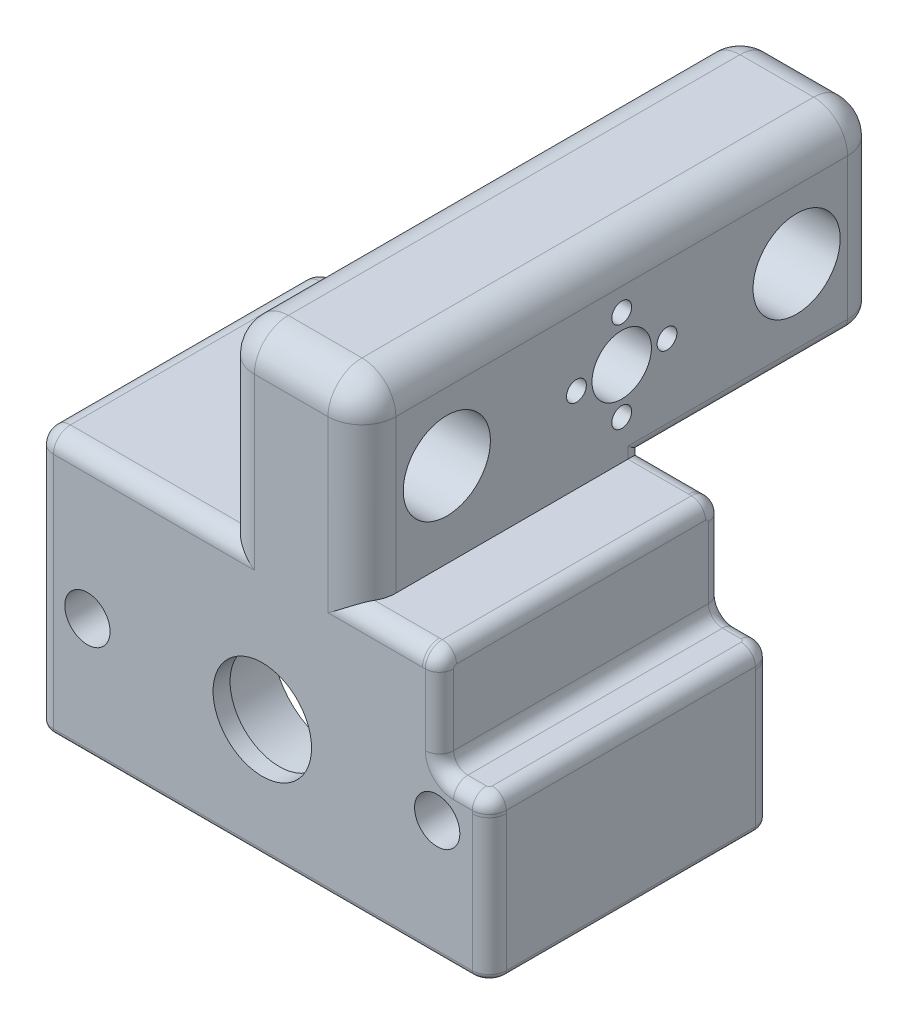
ISO-10303-21;
HEADER;
FILE_DESCRIPTION(('STEP AP214'),'2;1');
FILE_NAME('part.step','',(''),(''),'','','');
FILE_SCHEMA(('AUTOMOTIVE_DESIGN { 1 0 10303 214 1 1 1 1 }'));
ENDSEC;
DATA;
#1=APPLICATION_CONTEXT('core data for automotive mechanical design processes');
#2=APPLICATION_PROTOCOL_DEFINITION('international standard','automotive_design',2000,#1);
#3=PRODUCT_CONTEXT('',#1,'mechanical');
#4=PRODUCT('Part','Part','',(#3));
#5=PRODUCT_RELATED_PRODUCT_CATEGORY('part','',(#4));
#6=PRODUCT_DEFINITION_FORMATION('','',#4);
#7=PRODUCT_DEFINITION_CONTEXT('part definition',#1,'design');
#8=PRODUCT_DEFINITION('design','',#6,#7);
#9=PRODUCT_DEFINITION_SHAPE('','',#8);
#10=(LENGTH_UNIT() NAMED_UNIT(*) SI_UNIT(.MILLI.,.METRE.));
#11=(NAMED_UNIT(*) PLANE_ANGLE_UNIT() SI_UNIT($,.RADIAN.));
#12=(NAMED_UNIT(*) SI_UNIT($,.STERADIAN.) SOLID_ANGLE_UNIT());
#13=UNCERTAINTY_MEASURE_WITH_UNIT(LENGTH_MEASURE(1.E-05),#10,'distance_accuracy_value','');
#14=(GEOMETRIC_REPRESENTATION_CONTEXT(3) GLOBAL_UNCERTAINTY_ASSIGNED_CONTEXT((#13)) GLOBAL_UNIT_ASSIGNED_CONTEXT((#10,
#11,#12)) REPRESENTATION_CONTEXT('',''));
#15=CARTESIAN_POINT('',(0.,0.,0.));
#16=DIRECTION('',(0.,0.,1.));
#17=DIRECTION('',(1.,0.,0.));
#18=AXIS2_PLACEMENT_3D('',#15,#16,#17);
#19=CARTESIAN_POINT('',(-5.10000000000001,-40.1408045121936,35.9));
#20=DIRECTION('',(0.,0.,1.));
#21=DIRECTION('',(1.,0.,0.));
#22=AXIS2_PLACEMENT_3D('',#19,#20,#21);
#23=CYLINDRICAL_SURFACE('',#22,11.2);
#24=CARTESIAN_POINT('',(-5.10000000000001,-40.1408045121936,32.9));
#25=DIRECTION('',(0.,0.,-1.));
#26=DIRECTION('',(-1.,0.,0.));
#27=AXIS2_PLACEMENT_3D('',#24,#25,#26);
#28=CIRCLE('',#27,11.2);
#29=CARTESIAN_POINT('',(-16.3,-40.1408045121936,32.9));
#30=VERTEX_POINT('',#29);
#31=EDGE_CURVE('E1812',#30,#30,#28,.T.);
#32=ORIENTED_EDGE('',*,*,#31,.T.);
#33=EDGE_LOOP('',(#32));
#34=FACE_BOUND('',#33,.T.);
#35=CARTESIAN_POINT('',(-5.10000000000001,-40.1408045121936,42.9));
#36=DIRECTION('',(0.,0.,1.));
#37=DIRECTION('',(1.,0.,0.));
#38=AXIS2_PLACEMENT_3D('',#35,#36,#37);
#39=CIRCLE('',#38,11.2);
#40=CARTESIAN_POINT('',(6.09999999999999,-40.1408045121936,42.9));
#41=VERTEX_POINT('',#40);
#42=EDGE_CURVE('E11',#41,#41,#39,.F.);
#43=ORIENTED_EDGE('',*,*,#42,.F.);
#44=EDGE_LOOP('',(#43));
#45=FACE_BOUND('',#44,.T.);
#46=ADVANCED_FACE('F44',(#34,#45),#23,.F.);
#47=CARTESIAN_POINT('',(32.,-18.,42.9));
#48=DIRECTION('',(0.,0.,1.));
#49=DIRECTION('',(1.,0.,0.));
#50=AXIS2_PLACEMENT_3D('',#47,#48,#49);
#51=PLANE('',#50);
#52=CARTESIAN_POINT('',(25.8,-40.1408045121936,42.9));
#53=DIRECTION('',(0.,0.,-1.));
#54=DIRECTION('',(1.,0.,0.));
#55=AXIS2_PLACEMENT_3D('',#52,#53,#54);
#56=CIRCLE('',#55,6.99999999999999);
#57=CARTESIAN_POINT('',(32.,-43.3904198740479,42.9));
#58=VERTEX_POINT('',#57);
#59=CARTESIAN_POINT('',(23.2,-33.6415737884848,42.9));
#60=VERTEX_POINT('',#59);
#61=EDGE_CURVE('E421',#58,#60,#56,.T.);
#62=ORIENTED_EDGE('',*,*,#61,.F.);
#63=DIRECTION('',(0.,-1.,0.));
#64=VECTOR('',#63,1.);
#65=CARTESIAN_POINT('',(32.,-18.,42.9));
#66=LINE('',#65,#64);
#67=CARTESIAN_POINT('',(32.,-60.,42.9));
#68=VERTEX_POINT('',#67);
#69=EDGE_CURVE('E435',#58,#68,#66,.T.);
#70=ORIENTED_EDGE('',*,*,#69,.T.);
#71=DIRECTION('',(-1.,0.,0.));
#72=VECTOR('',#71,1.);
#73=CARTESIAN_POINT('',(-42.,-60.,42.9));
#74=LINE('',#73,#72);
#75=CARTESIAN_POINT('',(-42.,-60.,42.9));
#76=VERTEX_POINT('',#75);
#77=EDGE_CURVE('E1074',#68,#76,#74,.T.);
#78=ORIENTED_EDGE('',*,*,#77,.T.);
#79=DIRECTION('',(0.,-1.,0.));
#80=VECTOR('',#79,1.);
#81=CARTESIAN_POINT('',(-42.,-18.,42.9));
#82=LINE('',#81,#80);
#83=CARTESIAN_POINT('',(-42.,-43.7463557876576,42.9));
#84=VERTEX_POINT('',#83);
#85=EDGE_CURVE('E464',#84,#76,#82,.T.);
#86=ORIENTED_EDGE('',*,*,#85,.F.);
#87=CARTESIAN_POINT('',(-36.,-40.1408045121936,42.9));
#88=DIRECTION('',(0.,0.,-1.));
#89=DIRECTION('',(-1.,0.,0.));
#90=AXIS2_PLACEMENT_3D('',#87,#88,#89);
#91=CIRCLE('',#90,7.);
#92=CARTESIAN_POINT('',(-42.,-36.5352532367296,42.9));
#93=VERTEX_POINT('',#92);
#94=EDGE_CURVE('E1027',#93,#84,#91,.T.);
#95=ORIENTED_EDGE('',*,*,#94,.F.);
#96=CARTESIAN_POINT('',(-42.,-18.,42.9));
#97=VERTEX_POINT('',#96);
#98=EDGE_CURVE('E461',#97,#93,#82,.T.);
#99=ORIENTED_EDGE('',*,*,#98,.F.);
#100=DIRECTION('',(-1.,0.,0.));
#101=VECTOR('',#100,1.);
#102=CARTESIAN_POINT('',(32.,-18.,42.9));
#103=LINE('',#102,#101);
#104=CARTESIAN_POINT('',(23.2,-18.,42.9));
#105=VERTEX_POINT('',#104);
#106=EDGE_CURVE('E1063',#105,#97,#103,.T.);
#107=ORIENTED_EDGE('',*,*,#106,.F.);
#108=DIRECTION('',(0.,-1.,0.));
#109=VECTOR('',#108,1.);
#110=CARTESIAN_POINT('',(23.2,-18.,42.9));
#111=LINE('',#110,#109);
#112=EDGE_CURVE('E439',#105,#60,#111,.T.);
#113=ORIENTED_EDGE('',*,*,#112,.T.);
#114=EDGE_LOOP('',(#62,#70,#78,#86,#95,#99,#107,#113));
#115=FACE_BOUND('',#114,.T.);
#116=CARTESIAN_POINT('',(-5.10000000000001,-40.1408045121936,42.9));
#117=DIRECTION('',(0.,0.,1.));
#118=DIRECTION('',(1.,0.,0.));
#119=AXIS2_PLACEMENT_3D('',#116,#117,#118);
#120=CIRCLE('',#119,14.2);
#121=CARTESIAN_POINT('',(9.09999999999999,-40.1408045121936,42.9));
#122=VERTEX_POINT('',#121);
#123=EDGE_CURVE('E52',#122,#122,#120,.F.);
#124=ORIENTED_EDGE('',*,*,#123,.F.);
#125=EDGE_LOOP('',(#124));
#126=FACE_BOUND('',#125,.T.);
#127=ADVANCED_FACE('F432',(#115,#126),#51,.F.);
#128=CARTESIAN_POINT('',(25.8,-40.1408045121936,35.9));
#129=DIRECTION('',(0.,0.,1.));
#130=DIRECTION('',(1.,0.,0.));
#131=AXIS2_PLACEMENT_3D('',#128,#129,#130);
#132=CYLINDRICAL_SURFACE('',#131,4.);
#133=CARTESIAN_POINT('',(25.8,-40.1408045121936,45.9));
#134=DIRECTION('',(0.,0.,1.));
#135=DIRECTION('',(1.,0.,0.));
#136=AXIS2_PLACEMENT_3D('',#133,#134,#135);
#137=CIRCLE('',#136,4.);
#138=CARTESIAN_POINT('',(29.8,-40.1408045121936,45.9));
#139=VERTEX_POINT('',#138);
#140=EDGE_CURVE('E1033',#139,#139,#137,.T.);
#141=ORIENTED_EDGE('',*,*,#140,.T.);
#142=EDGE_LOOP('',(#141));
#143=FACE_BOUND('',#142,.T.);
#144=CARTESIAN_POINT('',(25.8,-40.1408045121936,24.9));
#145=DIRECTION('',(0.,0.,-1.));
#146=DIRECTION('',(-1.,0.,0.));
#147=AXIS2_PLACEMENT_3D('',#144,#145,#146);
#148=CIRCLE('',#147,4.);
#149=CARTESIAN_POINT('',(21.8,-40.1408045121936,24.9));
#150=VERTEX_POINT('',#149);
#151=EDGE_CURVE('E1005',#150,#150,#148,.F.);
#152=ORIENTED_EDGE('',*,*,#151,.F.);
#153=EDGE_LOOP('',(#152));
#154=FACE_BOUND('',#153,.T.);
#155=ADVANCED_FACE('F685',(#143,#154),#132,.F.);
#156=CARTESIAN_POINT('',(-36.,-40.1408045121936,35.9));
#157=DIRECTION('',(0.,0.,1.));
#158=DIRECTION('',(1.,0.,0.));
#159=AXIS2_PLACEMENT_3D('',#156,#157,#158);
#160=CYLINDRICAL_SURFACE('',#159,4.00000000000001);
#161=CARTESIAN_POINT('',(-36.,-40.1408045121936,45.9));
#162=DIRECTION('',(0.,0.,1.));
#163=DIRECTION('',(1.,0.,0.));
#164=AXIS2_PLACEMENT_3D('',#161,#162,#163);
#165=CIRCLE('',#164,4.00000000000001);
#166=CARTESIAN_POINT('',(-32.,-40.1408045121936,45.9));
#167=VERTEX_POINT('',#166);
#168=EDGE_CURVE('E1031',#167,#167,#165,.T.);
#169=ORIENTED_EDGE('',*,*,#168,.T.);
#170=EDGE_LOOP('',(#169));
#171=FACE_BOUND('',#170,.T.);
#172=CARTESIAN_POINT('',(-36.,-40.1408045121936,24.9));
#173=DIRECTION('',(0.,0.,-1.));
#174=DIRECTION('',(-1.,0.,0.));
#175=AXIS2_PLACEMENT_3D('',#172,#173,#174);
#176=CIRCLE('',#175,4.00000000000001);
#177=CARTESIAN_POINT('',(-40.,-40.1408045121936,24.9));
#178=VERTEX_POINT('',#177);
#179=EDGE_CURVE('E1003',#178,#178,#176,.F.);
#180=ORIENTED_EDGE('',*,*,#179,.F.);
#181=EDGE_LOOP('',(#180));
#182=FACE_BOUND('',#181,.T.);
#183=ADVANCED_FACE('F692',(#171,#182),#160,.F.);
#184=CARTESIAN_POINT('',(31.4439115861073,-36.,42.9));
#185=VERTEX_POINT('',#184);
#186=CARTESIAN_POINT('',(32.,-36.8911891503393,42.9));
#187=VERTEX_POINT('',#186);
#188=EDGE_CURVE('E440',#185,#187,#56,.T.);
#189=ORIENTED_EDGE('',*,*,#188,.F.);
#190=DIRECTION('',(1.,0.,0.));
#191=VECTOR('',#190,1.);
#192=CARTESIAN_POINT('',(32.,-36.,42.9));
#193=LINE('',#192,#191);
#194=CARTESIAN_POINT('',(32.,-36.,42.9));
#195=VERTEX_POINT('',#194);
#196=EDGE_CURVE('E1055',#185,#195,#193,.T.);
#197=ORIENTED_EDGE('',*,*,#196,.T.);
#198=EDGE_CURVE('E448',#195,#187,#66,.T.);
#199=ORIENTED_EDGE('',*,*,#198,.T.);
#200=EDGE_LOOP('',(#189,#197,#199));
#201=FACE_BOUND('',#200,.T.);
#202=ADVANCED_FACE('F687',(#201),#51,.F.);
#203=CARTESIAN_POINT('',(32.,-18.,-1.10000000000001));
#204=DIRECTION('',(1.,0.,0.));
#205=DIRECTION('',(0.,0.,-1.));
#206=AXIS2_PLACEMENT_3D('',#203,#204,#205);
#207=PLANE('',#206);
#208=DIRECTION('',(0.,0.,1.));
#209=VECTOR('',#208,1.);
#210=CARTESIAN_POINT('',(32.,-36.8911891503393,22.9));
#211=LINE('',#210,#209);
#212=CARTESIAN_POINT('',(32.,-36.8911891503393,22.9));
#213=VERTEX_POINT('',#212);
#214=EDGE_CURVE('E428',#187,#213,#211,.F.);
#215=ORIENTED_EDGE('',*,*,#214,.F.);
#216=ORIENTED_EDGE('',*,*,#198,.F.);
#217=DIRECTION('',(0.,0.,-1.));
#218=VECTOR('',#217,1.);
#219=CARTESIAN_POINT('',(32.,-36.,-1.10000000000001));
#220=LINE('',#219,#218);
#221=CARTESIAN_POINT('',(32.,-36.,-1.10000000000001));
#222=VERTEX_POINT('',#221);
#223=EDGE_CURVE('E1053',#195,#222,#220,.T.);
#224=ORIENTED_EDGE('',*,*,#223,.T.);
#225=DIRECTION('',(0.,-1.,0.));
#226=VECTOR('',#225,1.);
#227=CARTESIAN_POINT('',(32.,-18.,-1.10000000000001));
#228=LINE('',#227,#226);
#229=CARTESIAN_POINT('',(32.,-60.,-1.10000000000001));
#230=VERTEX_POINT('',#229);
#231=EDGE_CURVE('E449',#222,#230,#228,.T.);
#232=ORIENTED_EDGE('',*,*,#231,.T.);
#233=DIRECTION('',(0.,0.,1.));
#234=VECTOR('',#233,1.);
#235=CARTESIAN_POINT('',(32.,-60.,42.9));
#236=LINE('',#235,#234);
#237=EDGE_CURVE('E446',#230,#68,#236,.T.);
#238=ORIENTED_EDGE('',*,*,#237,.T.);
#239=ORIENTED_EDGE('',*,*,#69,.F.);
#240=DIRECTION('',(0.,0.,1.));
#241=VECTOR('',#240,1.);
#242=CARTESIAN_POINT('',(32.,-43.3904198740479,22.9));
#243=LINE('',#242,#241);
#244=CARTESIAN_POINT('',(32.,-43.3904198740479,22.9));
#245=VERTEX_POINT('',#244);
#246=EDGE_CURVE('E418',#245,#58,#243,.T.);
#247=ORIENTED_EDGE('',*,*,#246,.F.);
#248=DIRECTION('',(0.,-1.,0.));
#249=VECTOR('',#248,1.);
#250=CARTESIAN_POINT('',(32.,-18.,22.9));
#251=LINE('',#250,#249);
#252=EDGE_CURVE('E1025',#213,#245,#251,.T.);
#253=ORIENTED_EDGE('',*,*,#252,.F.);
#254=EDGE_LOOP('',(#215,#216,#224,#232,#238,#239,#247,#253));
#255=FACE_BOUND('',#254,.T.);
#256=ADVANCED_FACE('F443',(#255),#207,.F.);
#257=CARTESIAN_POINT('',(23.2,-15.,-4.10000000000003));
#258=DIRECTION('',(-1.,0.,0.));
#259=DIRECTION('',(0.,0.,1.));
#260=AXIS2_PLACEMENT_3D('',#257,#258,#259);
#261=PLANE('',#260);
#262=DIRECTION('',(0.,0.,1.));
#263=VECTOR('',#262,1.);
#264=CARTESIAN_POINT('',(23.2,-36.,-4.10000000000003));
#265=LINE('',#264,#263);
#266=CARTESIAN_POINT('',(23.2,-36.,-1.10000000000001));
#267=VERTEX_POINT('',#266);
#268=CARTESIAN_POINT('',(23.2,-36.,22.9));
#269=VERTEX_POINT('',#268);
#270=EDGE_CURVE('E1039',#267,#269,#265,.T.);
#271=ORIENTED_EDGE('',*,*,#270,.T.);
#272=DIRECTION('',(0.,1.,0.));
#273=VECTOR('',#272,1.);
#274=CARTESIAN_POINT('',(23.2,-15.,22.9));
#275=LINE('',#274,#273);
#276=CARTESIAN_POINT('',(23.2,-33.6415737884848,22.9));
#277=VERTEX_POINT('',#276);
#278=EDGE_CURVE('E1022',#269,#277,#275,.T.);
#279=ORIENTED_EDGE('',*,*,#278,.T.);
#280=DIRECTION('',(0.,0.,1.));
#281=VECTOR('',#280,1.);
#282=CARTESIAN_POINT('',(23.2,-33.6415737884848,22.9));
#283=LINE('',#282,#281);
#284=EDGE_CURVE('E429',#277,#60,#283,.T.);
#285=ORIENTED_EDGE('',*,*,#284,.T.);
#286=ORIENTED_EDGE('',*,*,#112,.F.);
#287=DIRECTION('',(0.,0.,-1.));
#288=VECTOR('',#287,1.);
#289=CARTESIAN_POINT('',(23.2,-18.,0.));
#290=LINE('',#289,#288);
#291=CARTESIAN_POINT('',(23.2,-18.,-1.10000000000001));
#292=VERTEX_POINT('',#291);
#293=EDGE_CURVE('E816',#105,#292,#290,.T.);
#294=ORIENTED_EDGE('',*,*,#293,.T.);
#295=DIRECTION('',(0.,1.,0.));
#296=VECTOR('',#295,1.);
#297=CARTESIAN_POINT('',(23.2,-18.,-1.10000000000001));
#298=LINE('',#297,#296);
#299=EDGE_CURVE('E1042',#267,#292,#298,.T.);
#300=ORIENTED_EDGE('',*,*,#299,.F.);
#301=EDGE_LOOP('',(#271,#279,#285,#286,#294,#300));
#302=FACE_BOUND('',#301,.T.);
#303=ADVANCED_FACE('F698',(#302),#261,.T.);
#304=CARTESIAN_POINT('',(35.,-36.,-4.10000000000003));
#305=DIRECTION('',(0.,-1.,0.));
#306=DIRECTION('',(0.,0.,-1.));
#307=AXIS2_PLACEMENT_3D('',#304,#305,#306);
#308=PLANE('',#307);
#309=DIRECTION('',(0.,0.,1.));
#310=VECTOR('',#309,1.);
#311=CARTESIAN_POINT('',(31.4439115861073,-36.,22.9));
#312=LINE('',#311,#310);
#313=CARTESIAN_POINT('',(31.4439115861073,-36.,22.9));
#314=VERTEX_POINT('',#313);
#315=EDGE_CURVE('E59',#185,#314,#312,.F.);
#316=ORIENTED_EDGE('',*,*,#315,.T.);
#317=DIRECTION('',(-1.,0.,0.));
#318=VECTOR('',#317,1.);
#319=CARTESIAN_POINT('',(35.,-36.,22.9));
#320=LINE('',#319,#318);
#321=EDGE_CURVE('E1002',#314,#269,#320,.T.);
#322=ORIENTED_EDGE('',*,*,#321,.T.);
#323=ORIENTED_EDGE('',*,*,#270,.F.);
#324=DIRECTION('',(-1.,0.,0.));
#325=VECTOR('',#324,1.);
#326=CARTESIAN_POINT('',(-42.,-36.,-1.10000000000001));
#327=LINE('',#326,#325);
#328=EDGE_CURVE('E1416',#222,#267,#327,.T.);
#329=ORIENTED_EDGE('',*,*,#328,.F.);
#330=ORIENTED_EDGE('',*,*,#223,.F.);
#331=ORIENTED_EDGE('',*,*,#196,.F.);
#332=EDGE_LOOP('',(#316,#322,#323,#329,#330,#331));
#333=FACE_BOUND('',#332,.T.);
#334=ADVANCED_FACE('F694',(#333),#308,.T.);
#335=CARTESIAN_POINT('',(-42.,-18.,42.9));
#336=DIRECTION('',(-1.,0.,0.));
#337=DIRECTION('',(0.,0.,1.));
#338=AXIS2_PLACEMENT_3D('',#335,#336,#337);
#339=PLANE('',#338);
#340=DIRECTION('',(0.,0.,1.));
#341=VECTOR('',#340,1.);
#342=CARTESIAN_POINT('',(-42.,-43.7463557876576,22.9));
#343=LINE('',#342,#341);
#344=CARTESIAN_POINT('',(-42.,-43.7463557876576,22.9));
#345=VERTEX_POINT('',#344);
#346=EDGE_CURVE('E67',#84,#345,#343,.F.);
#347=ORIENTED_EDGE('',*,*,#346,.F.);
#348=ORIENTED_EDGE('',*,*,#85,.T.);
#349=DIRECTION('',(0.,0.,-1.));
#350=VECTOR('',#349,1.);
#351=CARTESIAN_POINT('',(-42.,-60.,-1.10000000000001));
#352=LINE('',#351,#350);
#353=CARTESIAN_POINT('',(-42.,-60.,-1.10000000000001));
#354=VERTEX_POINT('',#353);
#355=EDGE_CURVE('E1071',#76,#354,#352,.T.);
#356=ORIENTED_EDGE('',*,*,#355,.T.);
#357=DIRECTION('',(0.,-1.,0.));
#358=VECTOR('',#357,1.);
#359=CARTESIAN_POINT('',(-42.,-18.,-1.10000000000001));
#360=LINE('',#359,#358);
#361=CARTESIAN_POINT('',(-42.,-18.,-1.10000000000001));
#362=VERTEX_POINT('',#361);
#363=EDGE_CURVE('E453',#362,#354,#360,.T.);
#364=ORIENTED_EDGE('',*,*,#363,.F.);
#365=DIRECTION('',(0.,0.,-1.));
#366=VECTOR('',#365,1.);
#367=CARTESIAN_POINT('',(-42.,-18.,42.9));
#368=LINE('',#367,#366);
#369=EDGE_CURVE('E1064',#97,#362,#368,.T.);
#370=ORIENTED_EDGE('',*,*,#369,.F.);
#371=ORIENTED_EDGE('',*,*,#98,.T.);
#372=DIRECTION('',(0.,0.,1.));
#373=VECTOR('',#372,1.);
#374=CARTESIAN_POINT('',(-42.,-36.5352532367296,22.9));
#375=LINE('',#374,#373);
#376=CARTESIAN_POINT('',(-42.,-36.5352532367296,22.9));
#377=VERTEX_POINT('',#376);
#378=EDGE_CURVE('E996',#377,#93,#375,.T.);
#379=ORIENTED_EDGE('',*,*,#378,.F.);
#380=DIRECTION('',(0.,-1.,0.));
#381=VECTOR('',#380,1.);
#382=CARTESIAN_POINT('',(-42.,-18.,22.9));
#383=LINE('',#382,#381);
#384=EDGE_CURVE('E998',#377,#345,#383,.T.);
#385=ORIENTED_EDGE('',*,*,#384,.T.);
#386=EDGE_LOOP('',(#347,#348,#356,#364,#370,#371,#379,#385));
#387=FACE_BOUND('',#386,.T.);
#388=ADVANCED_FACE('F697',(#387),#339,.F.);
#389=CARTESIAN_POINT('',(-6.49999999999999,-15.,39.9));
#390=DIRECTION('',(0.,1.,0.));
#391=DIRECTION('',(0.,0.,1.));
#392=AXIS2_PLACEMENT_3D('',#389,#390,#391);
#393=PLANE('',#392);
#394=CARTESIAN_POINT('',(6.5,-15.,-39.9));
#395=DIRECTION('',(0.,1.,0.));
#396=DIRECTION('',(0.,0.,1.));
#397=AXIS2_PLACEMENT_3D('',#394,#395,#396);
#398=CIRCLE('',#397,4.);
#399=CARTESIAN_POINT('',(6.5,-15.,-43.9));
#400=VERTEX_POINT('',#399);
#401=CARTESIAN_POINT('',(10.5,-15.,-39.9));
#402=VERTEX_POINT('',#401);
#403=EDGE_CURVE('E1135',#400,#402,#398,.F.);
#404=ORIENTED_EDGE('',*,*,#403,.T.);
#405=DIRECTION('',(0.,0.,-1.));
#406=VECTOR('',#405,1.);
#407=CARTESIAN_POINT('',(10.5,-15.,-4.10000000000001));
#408=LINE('',#407,#406);
#409=CARTESIAN_POINT('',(10.5,-15.,-3.92842712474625));
#410=VERTEX_POINT('',#409);
#411=EDGE_CURVE('E1137',#402,#410,#408,.F.);
#412=ORIENTED_EDGE('',*,*,#411,.T.);
#413=CARTESIAN_POINT('',(9.5,-15.,-1.10000000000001));
#414=DIRECTION('',(0.,1.,0.));
#415=DIRECTION('',(0.,0.,1.));
#416=AXIS2_PLACEMENT_3D('',#413,#414,#415);
#417=CIRCLE('',#416,3.);
#418=CARTESIAN_POINT('',(9.49999999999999,-15.,-4.10000000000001));
#419=VERTEX_POINT('',#418);
#420=EDGE_CURVE('E962',#410,#419,#417,.T.);
#421=ORIENTED_EDGE('',*,*,#420,.T.);
#422=DIRECTION('',(1.,0.,0.));
#423=VECTOR('',#422,1.);
#424=CARTESIAN_POINT('',(-45.,-15.,-4.10000000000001));
#425=LINE('',#424,#423);
#426=CARTESIAN_POINT('',(-9.50000000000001,-15.,-4.10000000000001));
#427=VERTEX_POINT('',#426);
#428=EDGE_CURVE('E465',#427,#419,#425,.T.);
#429=ORIENTED_EDGE('',*,*,#428,.F.);
#430=CARTESIAN_POINT('',(-9.49999999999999,-15.,-1.10000000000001));
#431=DIRECTION('',(0.,1.,0.));
#432=DIRECTION('',(0.,0.,1.));
#433=AXIS2_PLACEMENT_3D('',#430,#431,#432);
#434=CIRCLE('',#433,3.);
#435=CARTESIAN_POINT('',(-10.5,-15.,-3.9284271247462));
#436=VERTEX_POINT('',#435);
#437=EDGE_CURVE('E1269',#427,#436,#434,.T.);
#438=ORIENTED_EDGE('',*,*,#437,.T.);
#439=DIRECTION('',(0.,0.,1.));
#440=VECTOR('',#439,1.);
#441=CARTESIAN_POINT('',(-10.5,-15.,-39.9));
#442=LINE('',#441,#440);
#443=CARTESIAN_POINT('',(-10.5,-15.,-39.9));
#444=VERTEX_POINT('',#443);
#445=EDGE_CURVE('E1131',#436,#444,#442,.F.);
#446=ORIENTED_EDGE('',*,*,#445,.T.);
#447=CARTESIAN_POINT('',(-6.5,-15.,-39.9));
#448=DIRECTION('',(0.,1.,0.));
#449=DIRECTION('',(0.,0.,1.));
#450=AXIS2_PLACEMENT_3D('',#447,#448,#449);
#451=CIRCLE('',#450,4.);
#452=CARTESIAN_POINT('',(-6.5,-15.,-43.9));
#453=VERTEX_POINT('',#452);
#454=EDGE_CURVE('E1129',#444,#453,#451,.F.);
#455=ORIENTED_EDGE('',*,*,#454,.T.);
#456=DIRECTION('',(-1.,0.,0.));
#457=VECTOR('',#456,1.);
#458=CARTESIAN_POINT('',(6.5,-15.,-43.9));
#459=LINE('',#458,#457);
#460=EDGE_CURVE('E1133',#453,#400,#459,.F.);
#461=ORIENTED_EDGE('',*,*,#460,.T.);
#462=EDGE_LOOP('',(#404,#412,#421,#429,#438,#446,#455,#461));
#463=FACE_BOUND('',#462,.T.);
#464=ADVANCED_FACE('F723',(#463),#393,.F.);
#465=CARTESIAN_POINT('',(15.,0.,8.));
#466=DIRECTION('',(-1.,0.,0.));
#467=DIRECTION('',(0.,0.,1.));
#468=AXIS2_PLACEMENT_3D('',#465,#466,#467);
#469=CYLINDRICAL_SURFACE('',#468,1.75);
#470=CARTESIAN_POINT('',(12.5,0.,8.));
#471=DIRECTION('',(1.,0.,0.));
#472=DIRECTION('',(0.,0.,-1.));
#473=AXIS2_PLACEMENT_3D('',#470,#471,#472);
#474=CIRCLE('',#473,1.75);
#475=CARTESIAN_POINT('',(12.5,0.,6.25));
#476=VERTEX_POINT('',#475);
#477=EDGE_CURVE('E575',#476,#476,#474,.F.);
#478=ORIENTED_EDGE('',*,*,#477,.F.);
#479=EDGE_LOOP('',(#478));
#480=FACE_BOUND('',#479,.T.);
#481=CARTESIAN_POINT('',(-8.99999999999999,0.,8.));
#482=DIRECTION('',(-1.,0.,0.));
#483=DIRECTION('',(0.,0.,1.));
#484=AXIS2_PLACEMENT_3D('',#481,#482,#483);
#485=CIRCLE('',#484,1.75);
#486=CARTESIAN_POINT('',(-8.99999999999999,0.,9.75));
#487=VERTEX_POINT('',#486);
#488=EDGE_CURVE('E487',#487,#487,#485,.T.);
#489=ORIENTED_EDGE('',*,*,#488,.T.);
#490=EDGE_LOOP('',(#489));
#491=FACE_BOUND('',#490,.T.);
#492=ADVANCED_FACE('F771',(#480,#491),#469,.F.);
#493=CARTESIAN_POINT('',(15.,0.,0.));
#494=DIRECTION('',(-1.,0.,0.));
#495=DIRECTION('',(0.,0.,1.));
#496=AXIS2_PLACEMENT_3D('',#493,#494,#495);
#497=CYLINDRICAL_SURFACE('',#496,5.25);
#498=CARTESIAN_POINT('',(-8.99999999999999,0.,0.));
#499=DIRECTION('',(-1.,0.,0.));
#500=DIRECTION('',(0.,0.,1.));
#501=AXIS2_PLACEMENT_3D('',#498,#499,#500);
#502=CIRCLE('',#501,5.25);
#503=CARTESIAN_POINT('',(-8.99999999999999,0.,5.25));
#504=VERTEX_POINT('',#503);
#505=EDGE_CURVE('E477',#504,#504,#502,.T.);
#506=ORIENTED_EDGE('',*,*,#505,.T.);
#507=EDGE_LOOP('',(#506));
#508=FACE_BOUND('',#507,.T.);
#509=CARTESIAN_POINT('',(12.5,0.,0.));
#510=DIRECTION('',(1.,0.,0.));
#511=DIRECTION('',(0.,0.,-1.));
#512=AXIS2_PLACEMENT_3D('',#509,#510,#511);
#513=CIRCLE('',#512,5.25);
#514=CARTESIAN_POINT('',(12.5,0.,-5.25));
#515=VERTEX_POINT('',#514);
#516=EDGE_CURVE('E578',#515,#515,#513,.F.);
#517=ORIENTED_EDGE('',*,*,#516,.F.);
#518=EDGE_LOOP('',(#517));
#519=FACE_BOUND('',#518,.T.);
#520=ADVANCED_FACE('F774',(#508,#519),#497,.F.);
#521=CARTESIAN_POINT('',(15.,8.,0.));
#522=DIRECTION('',(-1.,0.,0.));
#523=DIRECTION('',(0.,0.,1.));
#524=AXIS2_PLACEMENT_3D('',#521,#522,#523);
#525=CYLINDRICAL_SURFACE('',#524,1.75);
#526=CARTESIAN_POINT('',(12.5,8.,0.));
#527=DIRECTION('',(1.,0.,0.));
#528=DIRECTION('',(0.,0.,-1.));
#529=AXIS2_PLACEMENT_3D('',#526,#527,#528);
#530=CIRCLE('',#529,1.75);
#531=CARTESIAN_POINT('',(12.5,8.,-1.75000000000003));
#532=VERTEX_POINT('',#531);
#533=EDGE_CURVE('E581',#532,#532,#530,.F.);
#534=ORIENTED_EDGE('',*,*,#533,.F.);
#535=EDGE_LOOP('',(#534));
#536=FACE_BOUND('',#535,.T.);
#537=CARTESIAN_POINT('',(-8.99999999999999,8.,0.));
#538=DIRECTION('',(-1.,0.,0.));
#539=DIRECTION('',(0.,0.,1.));
#540=AXIS2_PLACEMENT_3D('',#537,#538,#539);
#541=CIRCLE('',#540,1.75);
#542=CARTESIAN_POINT('',(-8.99999999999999,8.,1.74999999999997));
#543=VERTEX_POINT('',#542);
#544=EDGE_CURVE('E484',#543,#543,#541,.T.);
#545=ORIENTED_EDGE('',*,*,#544,.T.);
#546=EDGE_LOOP('',(#545));
#547=FACE_BOUND('',#546,.T.);
#548=ADVANCED_FACE('F763',(#536,#547),#525,.F.);
#549=CARTESIAN_POINT('',(15.,0.,-8.));
#550=DIRECTION('',(-1.,0.,0.));
#551=DIRECTION('',(0.,0.,1.));
#552=AXIS2_PLACEMENT_3D('',#549,#550,#551);
#553=CYLINDRICAL_SURFACE('',#552,1.75);
#554=CARTESIAN_POINT('',(12.5,0.,-8.));
#555=DIRECTION('',(1.,0.,0.));
#556=DIRECTION('',(0.,0.,-1.));
#557=AXIS2_PLACEMENT_3D('',#554,#555,#556);
#558=CIRCLE('',#557,1.75);
#559=CARTESIAN_POINT('',(12.5,0.,-9.75));
#560=VERTEX_POINT('',#559);
#561=EDGE_CURVE('E584',#560,#560,#558,.F.);
#562=ORIENTED_EDGE('',*,*,#561,.F.);
#563=EDGE_LOOP('',(#562));
#564=FACE_BOUND('',#563,.T.);
#565=CARTESIAN_POINT('',(-8.99999999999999,0.,-8.));
#566=DIRECTION('',(-1.,0.,0.));
#567=DIRECTION('',(0.,0.,1.));
#568=AXIS2_PLACEMENT_3D('',#565,#566,#567);
#569=CIRCLE('',#568,1.75);
#570=CARTESIAN_POINT('',(-8.99999999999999,0.,-6.25));
#571=VERTEX_POINT('',#570);
#572=EDGE_CURVE('E481',#571,#571,#569,.T.);
#573=ORIENTED_EDGE('',*,*,#572,.T.);
#574=EDGE_LOOP('',(#573));
#575=FACE_BOUND('',#574,.T.);
#576=ADVANCED_FACE('F760',(#564,#575),#553,.F.);
#577=CARTESIAN_POINT('',(15.,-8.,0.));
#578=DIRECTION('',(-1.,0.,0.));
#579=DIRECTION('',(0.,0.,1.));
#580=AXIS2_PLACEMENT_3D('',#577,#578,#579);
#581=CYLINDRICAL_SURFACE('',#580,1.75);
#582=CARTESIAN_POINT('',(12.5,-8.,0.));
#583=DIRECTION('',(1.,0.,0.));
#584=DIRECTION('',(0.,0.,-1.));
#585=AXIS2_PLACEMENT_3D('',#582,#583,#584);
#586=CIRCLE('',#585,1.75);
#587=CARTESIAN_POINT('',(12.5,-8.,-1.74999999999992));
#588=VERTEX_POINT('',#587);
#589=EDGE_CURVE('E587',#588,#588,#586,.F.);
#590=ORIENTED_EDGE('',*,*,#589,.F.);
#591=EDGE_LOOP('',(#590));
#592=FACE_BOUND('',#591,.T.);
#593=CARTESIAN_POINT('',(-8.99999999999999,-8.,0.));
#594=DIRECTION('',(-1.,0.,0.));
#595=DIRECTION('',(0.,0.,1.));
#596=AXIS2_PLACEMENT_3D('',#593,#594,#595);
#597=CIRCLE('',#596,1.75);
#598=CARTESIAN_POINT('',(-8.99999999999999,-8.,1.75000000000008));
#599=VERTEX_POINT('',#598);
#600=EDGE_CURVE('E480',#599,#599,#597,.T.);
#601=ORIENTED_EDGE('',*,*,#600,.T.);
#602=EDGE_LOOP('',(#601));
#603=FACE_BOUND('',#602,.T.);
#604=ADVANCED_FACE('F637',(#592,#603),#581,.F.);
#605=CARTESIAN_POINT('',(-6.49999999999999,-15.,39.9));
#606=DIRECTION('',(0.,1.,0.));
#607=DIRECTION('',(0.,0.,1.));
#608=AXIS2_PLACEMENT_3D('',#605,#606,#607);
#609=CYLINDRICAL_SURFACE('',#608,6.);
#610=DIRECTION('',(0.,1.,0.));
#611=VECTOR('',#610,1.);
#612=CARTESIAN_POINT('',(-6.49999999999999,-15.,45.9));
#613=LINE('',#612,#611);
#614=CARTESIAN_POINT('',(-6.49999999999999,-18.,45.9));
#615=VERTEX_POINT('',#614);
#616=CARTESIAN_POINT('',(-6.49999999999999,12.,45.9));
#617=VERTEX_POINT('',#616);
#618=EDGE_CURVE('E502',#615,#617,#613,.T.);
#619=ORIENTED_EDGE('',*,*,#618,.T.);
#620=CARTESIAN_POINT('',(-6.49999999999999,12.,39.9));
#621=DIRECTION('',(0.,1.,0.));
#622=DIRECTION('',(0.,0.,1.));
#623=AXIS2_PLACEMENT_3D('',#620,#621,#622);
#624=CIRCLE('',#623,6.);
#625=CARTESIAN_POINT('',(-12.5,12.,39.9));
#626=VERTEX_POINT('',#625);
#627=EDGE_CURVE('E469',#617,#626,#624,.F.);
#628=ORIENTED_EDGE('',*,*,#627,.T.);
#629=DIRECTION('',(0.,1.,0.));
#630=VECTOR('',#629,1.);
#631=CARTESIAN_POINT('',(-12.5,-15.,39.9));
#632=LINE('',#631,#630);
#633=CARTESIAN_POINT('',(-12.5,-15.,39.9));
#634=VERTEX_POINT('',#633);
#635=EDGE_CURVE('E503',#634,#626,#632,.T.);
#636=ORIENTED_EDGE('',*,*,#635,.F.);
#637=CARTESIAN_POINT('',(-6.49999999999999,-15.,39.9));
#638=DIRECTION('',(0.,1.,0.));
#639=DIRECTION('',(0.,0.,1.));
#640=AXIS2_PLACEMENT_3D('',#637,#638,#639);
#641=CIRCLE('',#640,6.);
#642=CARTESIAN_POINT('',(-11.6961524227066,-15.,42.9));
#643=VERTEX_POINT('',#642);
#644=EDGE_CURVE('E491',#634,#643,#641,.T.);
#645=ORIENTED_EDGE('',*,*,#644,.T.);
#646=CARTESIAN_POINT('',(-11.6961524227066,-15.,42.9));
#647=CARTESIAN_POINT('',(-11.6313179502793,-14.9999992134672,43.0123774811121));
#648=CARTESIAN_POINT('',(-11.5628460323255,-15.0063094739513,43.1224816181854));
#649=CARTESIAN_POINT('',(-11.4197244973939,-15.0300402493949,43.3369692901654));
#650=CARTESIAN_POINT('',(-11.3450909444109,-15.047432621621,43.4413665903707));
#651=CARTESIAN_POINT('',(-11.1914305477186,-15.0915367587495,43.6425032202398));
#652=CARTESIAN_POINT('',(-11.1124749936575,-15.118122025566,43.7393256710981));
#653=CARTESIAN_POINT('',(-10.9500320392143,-15.1793563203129,43.9264842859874));
#654=CARTESIAN_POINT('',(-10.8665413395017,-15.2140112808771,44.0168156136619));
#655=CARTESIAN_POINT('',(-10.6795318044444,-15.2974415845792,44.207267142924));
#656=CARTESIAN_POINT('',(-10.5752228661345,-15.3476488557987,44.3059836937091));
#657=CARTESIAN_POINT('',(-10.3622916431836,-15.4560660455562,44.4937864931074));
#658=CARTESIAN_POINT('',(-10.2536692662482,-15.5142761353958,44.5828725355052));
#659=CARTESIAN_POINT('',(-9.92126546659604,-15.6994485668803,44.8368986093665));
#660=CARTESIAN_POINT('',(-9.691996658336,-15.836462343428,44.9875569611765));
#661=CARTESIAN_POINT('',(-9.29396357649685,-16.0846591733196,45.2131444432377));
#662=CARTESIAN_POINT('',(-9.12743996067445,-16.1914376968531,45.2972781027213));
#663=CARTESIAN_POINT('',(-8.79089535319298,-16.4116055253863,45.4484963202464));
#664=CARTESIAN_POINT('',(-8.62087282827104,-16.5249977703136,45.5155732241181));
#665=CARTESIAN_POINT('',(-8.27867941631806,-16.7563311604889,45.6331488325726));
#666=CARTESIAN_POINT('',(-8.1065121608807,-16.8742651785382,45.6836724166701));
#667=CARTESIAN_POINT('',(-7.76059195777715,-17.1133359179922,45.7687828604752));
#668=CARTESIAN_POINT('',(-7.58683972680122,-17.2344712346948,45.8033765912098));
#669=CARTESIAN_POINT('',(-7.26301783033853,-17.4614180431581,45.8532101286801));
#670=CARTESIAN_POINT('',(-7.11307582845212,-17.5669725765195,45.8704958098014));
#671=CARTESIAN_POINT('',(-6.8129603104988,-17.7787100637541,45.8937198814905));
#672=CARTESIAN_POINT('',(-6.66278720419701,-17.8848922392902,45.8996701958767));
#673=CARTESIAN_POINT('',(-6.5084327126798,-17.9940371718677,45.8999955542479));
#674=CARTESIAN_POINT('',(-6.50421633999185,-17.9970185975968,45.8999999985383));
#675=CARTESIAN_POINT('',(-6.49999999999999,-18.,45.9));
#676=B_SPLINE_CURVE_WITH_KNOTS('',3,(#646,#647,#648,#649,#650,#651,#652,#653,#654,#655,#656,
#657,#658,#659,#660,#661,#662,#663,#664,#665,#666,#667,#668,#669,#670,#671,#672,#673,#674,#675),
.UNSPECIFIED.,.F.,.F.,(4,2,2,2,2,2,2,2,2,2,2,2,2,2,4),(0.,0.388776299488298,0.77656922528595,
1.15922537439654,1.54216373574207,1.99790057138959,2.4536471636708,3.36977457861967,
4.01397042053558,4.65845483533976,5.30196610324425,5.94519954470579,6.4974195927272,
7.04905843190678,7.06455037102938),.UNSPECIFIED.);
#677=EDGE_CURVE('E616',#643,#615,#676,.T.);
#678=ORIENTED_EDGE('',*,*,#677,.T.);
#679=EDGE_LOOP('',(#619,#628,#636,#645,#678));
#680=FACE_BOUND('',#679,.T.);
#681=ADVANCED_FACE('F631',(#680),#609,.T.);
#682=CARTESIAN_POINT('',(-12.5,-15.,-39.9));
#683=DIRECTION('',(-1.,0.,0.));
#684=DIRECTION('',(0.,0.,1.));
#685=AXIS2_PLACEMENT_3D('',#682,#683,#684);
#686=PLANE('',#685);
#687=CARTESIAN_POINT('',(-12.5,0.,30.9));
#688=DIRECTION('',(-1.,0.,0.));
#689=DIRECTION('',(0.,0.,1.));
#690=AXIS2_PLACEMENT_3D('',#687,#688,#689);
#691=CIRCLE('',#690,8.7);
#692=CARTESIAN_POINT('',(-12.5,0.,39.6));
#693=VERTEX_POINT('',#692);
#694=EDGE_CURVE('E988',#693,#693,#691,.F.);
#695=ORIENTED_EDGE('',*,*,#694,.T.);
#696=EDGE_LOOP('',(#695));
#697=FACE_BOUND('',#696,.T.);
#698=CARTESIAN_POINT('',(-12.5,0.,-30.9));
#699=DIRECTION('',(-1.,0.,0.));
#700=DIRECTION('',(0.,0.,1.));
#701=AXIS2_PLACEMENT_3D('',#698,#699,#700);
#702=CIRCLE('',#701,8.7);
#703=CARTESIAN_POINT('',(-12.5,0.,-22.2));
#704=VERTEX_POINT('',#703);
#705=EDGE_CURVE('E986',#704,#704,#702,.F.);
#706=ORIENTED_EDGE('',*,*,#705,.T.);
#707=EDGE_LOOP('',(#706));
#708=FACE_BOUND('',#707,.T.);
#709=CARTESIAN_POINT('',(-12.5,0.,0.));
#710=DIRECTION('',(-1.,0.,0.));
#711=DIRECTION('',(0.,0.,1.));
#712=AXIS2_PLACEMENT_3D('',#709,#710,#711);
#713=CIRCLE('',#712,11.25);
#714=CARTESIAN_POINT('',(-12.5,0.,11.25));
#715=VERTEX_POINT('',#714);
#716=EDGE_CURVE('E470',#715,#715,#713,.T.);
#717=ORIENTED_EDGE('',*,*,#716,.F.);
#718=EDGE_LOOP('',(#717));
#719=FACE_BOUND('',#718,.T.);
#720=DIRECTION('',(0.,1.,0.));
#721=VECTOR('',#720,1.);
#722=CARTESIAN_POINT('',(-12.5,-15.,-39.9));
#723=LINE('',#722,#721);
#724=CARTESIAN_POINT('',(-12.5,-13.,-39.9));
#725=VERTEX_POINT('',#724);
#726=CARTESIAN_POINT('',(-12.5,12.,-39.9));
#727=VERTEX_POINT('',#726);
#728=EDGE_CURVE('E507',#725,#727,#723,.T.);
#729=ORIENTED_EDGE('',*,*,#728,.F.);
#730=DIRECTION('',(0.,0.,1.));
#731=VECTOR('',#730,1.);
#732=CARTESIAN_POINT('',(-12.5,-13.,-1.1));
#733=LINE('',#732,#731);
#734=CARTESIAN_POINT('',(-12.5,-13.,-1.1));
#735=VERTEX_POINT('',#734);
#736=EDGE_CURVE('E1145',#725,#735,#733,.T.);
#737=ORIENTED_EDGE('',*,*,#736,.T.);
#738=DIRECTION('',(0.,1.,0.));
#739=VECTOR('',#738,1.);
#740=CARTESIAN_POINT('',(-12.5,-14.,-1.10000000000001));
#741=LINE('',#740,#739);
#742=CARTESIAN_POINT('',(-12.5,-15.,-1.1));
#743=VERTEX_POINT('',#742);
#744=EDGE_CURVE('E1143',#735,#743,#741,.F.);
#745=ORIENTED_EDGE('',*,*,#744,.T.);
#746=DIRECTION('',(0.,0.,1.));
#747=VECTOR('',#746,1.);
#748=CARTESIAN_POINT('',(-12.5,-15.,-39.9));
#749=LINE('',#748,#747);
#750=EDGE_CURVE('E500',#743,#634,#749,.T.);
#751=ORIENTED_EDGE('',*,*,#750,.T.);
#752=ORIENTED_EDGE('',*,*,#635,.T.);
#753=DIRECTION('',(0.,0.,1.));
#754=VECTOR('',#753,1.);
#755=CARTESIAN_POINT('',(-12.5,12.,-39.9));
#756=LINE('',#755,#754);
#757=EDGE_CURVE('E531',#626,#727,#756,.F.);
#758=ORIENTED_EDGE('',*,*,#757,.T.);
#759=EDGE_LOOP('',(#729,#737,#745,#751,#752,#758));
#760=FACE_BOUND('',#759,.T.);
#761=ADVANCED_FACE('F636',(#697,#708,#719,#760),#686,.T.);
#762=CARTESIAN_POINT('',(-6.5,-15.,-39.9));
#763=DIRECTION('',(0.,1.,0.));
#764=DIRECTION('',(0.,0.,1.));
#765=AXIS2_PLACEMENT_3D('',#762,#763,#764);
#766=CYLINDRICAL_SURFACE('',#765,6.);
#767=DIRECTION('',(0.,1.,0.));
#768=VECTOR('',#767,1.);
#769=CARTESIAN_POINT('',(-6.5,-15.,-45.9));
#770=LINE('',#769,#768);
#771=CARTESIAN_POINT('',(-6.5,-13.,-45.9));
#772=VERTEX_POINT('',#771);
#773=CARTESIAN_POINT('',(-6.5,12.,-45.9));
#774=VERTEX_POINT('',#773);
#775=EDGE_CURVE('E509',#772,#774,#770,.T.);
#776=ORIENTED_EDGE('',*,*,#775,.F.);
#777=CARTESIAN_POINT('',(-6.5,-13.,-39.9));
#778=DIRECTION('',(0.,1.,0.));
#779=DIRECTION('',(0.,0.,1.));
#780=AXIS2_PLACEMENT_3D('',#777,#778,#779);
#781=CIRCLE('',#780,6.);
#782=EDGE_CURVE('E1148',#772,#725,#781,.T.);
#783=ORIENTED_EDGE('',*,*,#782,.T.);
#784=ORIENTED_EDGE('',*,*,#728,.T.);
#785=CARTESIAN_POINT('',(-6.5,12.,-39.9));
#786=DIRECTION('',(0.,1.,0.));
#787=DIRECTION('',(0.,0.,1.));
#788=AXIS2_PLACEMENT_3D('',#785,#786,#787);
#789=CIRCLE('',#788,6.);
#790=EDGE_CURVE('E534',#727,#774,#789,.F.);
#791=ORIENTED_EDGE('',*,*,#790,.T.);
#792=EDGE_LOOP('',(#776,#783,#784,#791));
#793=FACE_BOUND('',#792,.T.);
#794=ADVANCED_FACE('F787',(#793),#766,.T.);
#795=CARTESIAN_POINT('',(-6.5,-15.,-45.9));
#796=DIRECTION('',(0.,0.,-1.));
#797=DIRECTION('',(-1.,0.,0.));
#798=AXIS2_PLACEMENT_3D('',#795,#796,#797);
#799=PLANE('',#798);
#800=DIRECTION('',(0.,1.,0.));
#801=VECTOR('',#800,1.);
#802=CARTESIAN_POINT('',(6.5,-15.,-45.9));
#803=LINE('',#802,#801);
#804=CARTESIAN_POINT('',(6.5,-13.,-45.9));
#805=VERTEX_POINT('',#804);
#806=CARTESIAN_POINT('',(6.5,12.,-45.9));
#807=VERTEX_POINT('',#806);
#808=EDGE_CURVE('E511',#805,#807,#803,.T.);
#809=ORIENTED_EDGE('',*,*,#808,.F.);
#810=DIRECTION('',(-1.,0.,0.));
#811=VECTOR('',#810,1.);
#812=CARTESIAN_POINT('',(-6.5,-13.,-45.9));
#813=LINE('',#812,#811);
#814=EDGE_CURVE('E1141',#805,#772,#813,.T.);
#815=ORIENTED_EDGE('',*,*,#814,.T.);
#816=ORIENTED_EDGE('',*,*,#775,.T.);
#817=DIRECTION('',(-1.,0.,0.));
#818=VECTOR('',#817,1.);
#819=CARTESIAN_POINT('',(-6.5,12.,-45.9));
#820=LINE('',#819,#818);
#821=EDGE_CURVE('E537',#774,#807,#820,.F.);
#822=ORIENTED_EDGE('',*,*,#821,.T.);
#823=EDGE_LOOP('',(#809,#815,#816,#822));
#824=FACE_BOUND('',#823,.T.);
#825=ADVANCED_FACE('F791',(#824),#799,.T.);
#826=CARTESIAN_POINT('',(6.5,-15.,-39.9));
#827=DIRECTION('',(0.,1.,0.));
#828=DIRECTION('',(0.,0.,1.));
#829=AXIS2_PLACEMENT_3D('',#826,#827,#828);
#830=CYLINDRICAL_SURFACE('',#829,6.);
#831=DIRECTION('',(0.,1.,0.));
#832=VECTOR('',#831,1.);
#833=CARTESIAN_POINT('',(12.5,-15.,-39.9));
#834=LINE('',#833,#832);
#835=CARTESIAN_POINT('',(12.5,-13.,-39.9));
#836=VERTEX_POINT('',#835);
#837=CARTESIAN_POINT('',(12.5,12.,-39.9));
#838=VERTEX_POINT('',#837);
#839=EDGE_CURVE('E513',#836,#838,#834,.T.);
#840=ORIENTED_EDGE('',*,*,#839,.F.);
#841=CARTESIAN_POINT('',(6.5,-13.,-39.9));
#842=DIRECTION('',(0.,1.,0.));
#843=DIRECTION('',(0.,0.,1.));
#844=AXIS2_PLACEMENT_3D('',#841,#842,#843);
#845=CIRCLE('',#844,6.);
#846=EDGE_CURVE('E1139',#836,#805,#845,.T.);
#847=ORIENTED_EDGE('',*,*,#846,.T.);
#848=ORIENTED_EDGE('',*,*,#808,.T.);
#849=CARTESIAN_POINT('',(6.5,12.,-39.9));
#850=DIRECTION('',(0.,1.,0.));
#851=DIRECTION('',(0.,0.,1.));
#852=AXIS2_PLACEMENT_3D('',#849,#850,#851);
#853=CIRCLE('',#852,6.);
#854=EDGE_CURVE('E540',#807,#838,#853,.F.);
#855=ORIENTED_EDGE('',*,*,#854,.T.);
#856=EDGE_LOOP('',(#840,#847,#848,#855));
#857=FACE_BOUND('',#856,.T.);
#858=ADVANCED_FACE('F795',(#857),#830,.T.);
#859=CARTESIAN_POINT('',(12.5,-15.,-39.9));
#860=DIRECTION('',(1.,0.,0.));
#861=DIRECTION('',(0.,0.,-1.));
#862=AXIS2_PLACEMENT_3D('',#859,#860,#861);
#863=PLANE('',#862);
#864=CARTESIAN_POINT('',(12.5,0.,-30.9));
#865=DIRECTION('',(1.,0.,0.));
#866=DIRECTION('',(0.,0.,-1.));
#867=AXIS2_PLACEMENT_3D('',#864,#865,#866);
#868=CIRCLE('',#867,7.7);
#869=CARTESIAN_POINT('',(12.5,0.,-38.6));
#870=VERTEX_POINT('',#869);
#871=EDGE_CURVE('E553',#870,#870,#868,.F.);
#872=ORIENTED_EDGE('',*,*,#871,.T.);
#873=EDGE_LOOP('',(#872));
#874=FACE_BOUND('',#873,.T.);
#875=ORIENTED_EDGE('',*,*,#589,.T.);
#876=EDGE_LOOP('',(#875));
#877=FACE_BOUND('',#876,.T.);
#878=ORIENTED_EDGE('',*,*,#561,.T.);
#879=EDGE_LOOP('',(#878));
#880=FACE_BOUND('',#879,.T.);
#881=ORIENTED_EDGE('',*,*,#533,.T.);
#882=EDGE_LOOP('',(#881));
#883=FACE_BOUND('',#882,.T.);
#884=ORIENTED_EDGE('',*,*,#516,.T.);
#885=EDGE_LOOP('',(#884));
#886=FACE_BOUND('',#885,.T.);
#887=ORIENTED_EDGE('',*,*,#477,.T.);
#888=EDGE_LOOP('',(#887));
#889=FACE_BOUND('',#888,.T.);
#890=CARTESIAN_POINT('',(12.5,0.,30.9));
#891=DIRECTION('',(1.,0.,0.));
#892=DIRECTION('',(0.,0.,-1.));
#893=AXIS2_PLACEMENT_3D('',#890,#891,#892);
#894=CIRCLE('',#893,7.7);
#895=CARTESIAN_POINT('',(12.5,0.,23.2));
#896=VERTEX_POINT('',#895);
#897=EDGE_CURVE('E490',#896,#896,#894,.F.);
#898=ORIENTED_EDGE('',*,*,#897,.T.);
#899=EDGE_LOOP('',(#898));
#900=FACE_BOUND('',#899,.T.);
#901=DIRECTION('',(0.,0.,-1.));
#902=VECTOR('',#901,1.);
#903=CARTESIAN_POINT('',(12.5,-15.,-39.9));
#904=LINE('',#903,#902);
#905=CARTESIAN_POINT('',(12.5,-15.,39.9));
#906=VERTEX_POINT('',#905);
#907=CARTESIAN_POINT('',(12.5,-15.,-1.1));
#908=VERTEX_POINT('',#907);
#909=EDGE_CURVE('E497',#906,#908,#904,.T.);
#910=ORIENTED_EDGE('',*,*,#909,.T.);
#911=DIRECTION('',(0.,-1.,0.));
#912=VECTOR('',#911,1.);
#913=CARTESIAN_POINT('',(12.5,-15.,-1.1));
#914=LINE('',#913,#912);
#915=CARTESIAN_POINT('',(12.5,-13.,-1.1));
#916=VERTEX_POINT('',#915);
#917=EDGE_CURVE('E1465',#908,#916,#914,.F.);
#918=ORIENTED_EDGE('',*,*,#917,.T.);
#919=DIRECTION('',(0.,0.,-1.));
#920=VECTOR('',#919,1.);
#921=CARTESIAN_POINT('',(12.5,-13.,-39.9));
#922=LINE('',#921,#920);
#923=EDGE_CURVE('E1077',#916,#836,#922,.T.);
#924=ORIENTED_EDGE('',*,*,#923,.T.);
#925=ORIENTED_EDGE('',*,*,#839,.T.);
#926=DIRECTION('',(0.,0.,-1.));
#927=VECTOR('',#926,1.);
#928=CARTESIAN_POINT('',(12.5,12.,-39.9));
#929=LINE('',#928,#927);
#930=CARTESIAN_POINT('',(12.5,12.,39.9));
#931=VERTEX_POINT('',#930);
#932=EDGE_CURVE('E543',#838,#931,#929,.F.);
#933=ORIENTED_EDGE('',*,*,#932,.T.);
#934=DIRECTION('',(0.,1.,0.));
#935=VECTOR('',#934,1.);
#936=CARTESIAN_POINT('',(12.5,-15.,39.9));
#937=LINE('',#936,#935);
#938=EDGE_CURVE('E515',#906,#931,#937,.T.);
#939=ORIENTED_EDGE('',*,*,#938,.F.);
#940=EDGE_LOOP('',(#910,#918,#924,#925,#933,#939));
#941=FACE_BOUND('',#940,.T.);
#942=ADVANCED_FACE('F799',(#874,#877,#880,#883,#886,#889,#900,#941),#863,.T.);
#943=CARTESIAN_POINT('',(6.50000000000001,-15.,39.9));
#944=DIRECTION('',(0.,1.,0.));
#945=DIRECTION('',(0.,0.,1.));
#946=AXIS2_PLACEMENT_3D('',#943,#944,#945);
#947=CYLINDRICAL_SURFACE('',#946,6.);
#948=ORIENTED_EDGE('',*,*,#938,.T.);
#949=CARTESIAN_POINT('',(6.50000000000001,12.,39.9));
#950=DIRECTION('',(0.,1.,0.));
#951=DIRECTION('',(0.,0.,1.));
#952=AXIS2_PLACEMENT_3D('',#949,#950,#951);
#953=CIRCLE('',#952,6.);
#954=CARTESIAN_POINT('',(6.50000000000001,12.,45.9));
#955=VERTEX_POINT('',#954);
#956=EDGE_CURVE('E545',#931,#955,#953,.F.);
#957=ORIENTED_EDGE('',*,*,#956,.T.);
#958=DIRECTION('',(0.,1.,0.));
#959=VECTOR('',#958,1.);
#960=CARTESIAN_POINT('',(6.50000000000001,-15.,45.9));
#961=LINE('',#960,#959);
#962=CARTESIAN_POINT('',(6.50000000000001,-18.,45.9));
#963=VERTEX_POINT('',#962);
#964=EDGE_CURVE('E518',#963,#955,#961,.T.);
#965=ORIENTED_EDGE('',*,*,#964,.F.);
#966=CARTESIAN_POINT('',(11.6961524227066,-15.,42.9));
#967=CARTESIAN_POINT('',(11.6313179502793,-14.9999992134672,43.0123774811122));
#968=CARTESIAN_POINT('',(11.5628460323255,-15.0063094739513,43.1224816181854));
#969=CARTESIAN_POINT('',(11.4197244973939,-15.030040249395,43.3369692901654));
#970=CARTESIAN_POINT('',(11.3450909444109,-15.047432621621,43.4413665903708));
#971=CARTESIAN_POINT('',(11.1914305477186,-15.0915367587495,43.6425032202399));
#972=CARTESIAN_POINT('',(11.1124749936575,-15.118122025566,43.7393256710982));
#973=CARTESIAN_POINT('',(10.9500320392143,-15.1793563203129,43.9264842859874));
#974=CARTESIAN_POINT('',(10.8665413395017,-15.2140112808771,44.0168156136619));
#975=CARTESIAN_POINT('',(10.6795318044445,-15.2974415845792,44.207267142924));
#976=CARTESIAN_POINT('',(10.5752228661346,-15.3476488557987,44.3059836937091));
#977=CARTESIAN_POINT('',(10.3622916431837,-15.4560660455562,44.4937864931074));
#978=CARTESIAN_POINT('',(10.2536692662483,-15.5142761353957,44.5828725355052));
#979=CARTESIAN_POINT('',(9.92126546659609,-15.6994485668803,44.8368986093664));
#980=CARTESIAN_POINT('',(9.69199665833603,-15.836462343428,44.9875569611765));
#981=CARTESIAN_POINT('',(9.29396357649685,-16.0846591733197,45.2131444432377));
#982=CARTESIAN_POINT('',(9.12743996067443,-16.1914376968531,45.2972781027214));
#983=CARTESIAN_POINT('',(8.79089535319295,-16.4116055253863,45.4484963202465));
#984=CARTESIAN_POINT('',(8.62087282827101,-16.5249977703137,45.5155732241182));
#985=CARTESIAN_POINT('',(8.27867941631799,-16.7563311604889,45.6331488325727));
#986=CARTESIAN_POINT('',(8.10651216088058,-16.8742651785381,45.6836724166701));
#987=CARTESIAN_POINT('',(7.76059195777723,-17.1133359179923,45.7687828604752));
#988=CARTESIAN_POINT('',(7.58683972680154,-17.2344712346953,45.8033765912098));
#989=CARTESIAN_POINT('',(7.26301783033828,-17.4614180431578,45.8532101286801));
#990=CARTESIAN_POINT('',(7.11307582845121,-17.5669725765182,45.8704958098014));
#991=CARTESIAN_POINT('',(6.81296031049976,-17.7787100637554,45.8937198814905));
#992=CARTESIAN_POINT('',(6.66278720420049,-17.8848922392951,45.8996701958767));
#993=CARTESIAN_POINT('',(6.50843271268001,-17.994037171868,45.8999955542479));
#994=CARTESIAN_POINT('',(6.50421633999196,-17.997018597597,45.8999999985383));
#995=CARTESIAN_POINT('',(6.50000000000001,-18.,45.9));
#996=B_SPLINE_CURVE_WITH_KNOTS('',3,(#966,#967,#968,#969,#970,#971,#972,#973,#974,#975,#976,
#977,#978,#979,#980,#981,#982,#983,#984,#985,#986,#987,#988,#989,#990,#991,#992,#993,#994,#995),
.UNSPECIFIED.,.F.,.F.,(4,2,2,2,2,2,2,2,2,2,2,2,2,2,4),(0.,0.388776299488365,0.776569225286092,
1.15922537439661,1.54216373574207,1.99790057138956,2.45364716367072,3.36977457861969,
4.01397042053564,4.65845483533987,5.3019661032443,5.9451995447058,6.4974195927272,
7.04905843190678,7.06455037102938),.UNSPECIFIED.);
#997=CARTESIAN_POINT('',(11.6961524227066,-15.,42.9));
#998=VERTEX_POINT('',#997);
#999=EDGE_CURVE('E808',#963,#998,#996,.F.);
#1000=ORIENTED_EDGE('',*,*,#999,.T.);
#1001=CARTESIAN_POINT('',(6.50000000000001,-15.,39.9));
#1002=DIRECTION('',(0.,1.,0.));
#1003=DIRECTION('',(0.,0.,1.));
#1004=AXIS2_PLACEMENT_3D('',#1001,#1002,#1003);
#1005=CIRCLE('',#1004,6.);
#1006=EDGE_CURVE('E494',#998,#906,#1005,.T.);
#1007=ORIENTED_EDGE('',*,*,#1006,.T.);
#1008=EDGE_LOOP('',(#948,#957,#965,#1000,#1007));
#1009=FACE_BOUND('',#1008,.T.);
#1010=ADVANCED_FACE('F802',(#1009),#947,.T.);
#1011=CARTESIAN_POINT('',(-6.49999999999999,-15.,45.9));
#1012=DIRECTION('',(0.,0.,1.));
#1013=DIRECTION('',(1.,0.,0.));
#1014=AXIS2_PLACEMENT_3D('',#1011,#1012,#1013);
#1015=PLANE('',#1014);
#1016=ORIENTED_EDGE('',*,*,#168,.F.);
#1017=EDGE_LOOP('',(#1016));
#1018=FACE_BOUND('',#1017,.T.);
#1019=ORIENTED_EDGE('',*,*,#140,.F.);
#1020=EDGE_LOOP('',(#1019));
#1021=FACE_BOUND('',#1020,.T.);
#1022=DIRECTION('',(0.,-1.,0.));
#1023=VECTOR('',#1022,1.);
#1024=CARTESIAN_POINT('',(-42.,-61.,45.9));
#1025=LINE('',#1024,#1023);
#1026=CARTESIAN_POINT('',(-42.,-18.,45.9));
#1027=VERTEX_POINT('',#1026);
#1028=CARTESIAN_POINT('',(-42.,-60.,45.9));
#1029=VERTEX_POINT('',#1028);
#1030=EDGE_CURVE('E600',#1027,#1029,#1025,.T.);
#1031=ORIENTED_EDGE('',*,*,#1030,.T.);
#1032=DIRECTION('',(1.,0.,0.));
#1033=VECTOR('',#1032,1.);
#1034=CARTESIAN_POINT('',(-6.49999999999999,-60.,45.9));
#1035=LINE('',#1034,#1033);
#1036=CARTESIAN_POINT('',(32.,-60.,45.9));
#1037=VERTEX_POINT('',#1036);
#1038=EDGE_CURVE('E1217',#1029,#1037,#1035,.T.);
#1039=ORIENTED_EDGE('',*,*,#1038,.T.);
#1040=DIRECTION('',(0.,-1.,0.));
#1041=VECTOR('',#1040,1.);
#1042=CARTESIAN_POINT('',(32.,-15.,45.9));
#1043=LINE('',#1042,#1041);
#1044=CARTESIAN_POINT('',(32.,-36.,45.9));
#1045=VERTEX_POINT('',#1044);
#1046=EDGE_CURVE('E1223',#1037,#1045,#1043,.F.);
#1047=ORIENTED_EDGE('',*,*,#1046,.T.);
#1048=DIRECTION('',(0.,1.,0.));
#1049=VECTOR('',#1048,1.);
#1050=CARTESIAN_POINT('',(32.,-15.,45.9));
#1051=LINE('',#1050,#1049);
#1052=CARTESIAN_POINT('',(32.,-35.5,45.9));
#1053=VERTEX_POINT('',#1052);
#1054=EDGE_CURVE('E1303',#1045,#1053,#1051,.T.);
#1055=ORIENTED_EDGE('',*,*,#1054,.T.);
#1056=DIRECTION('',(1.,0.,0.));
#1057=VECTOR('',#1056,1.);
#1058=CARTESIAN_POINT('',(26.2,-35.5,45.9));
#1059=LINE('',#1058,#1057);
#1060=CARTESIAN_POINT('',(28.7,-35.5,45.9));
#1061=VERTEX_POINT('',#1060);
#1062=EDGE_CURVE('E1347',#1053,#1061,#1059,.F.);
#1063=ORIENTED_EDGE('',*,*,#1062,.T.);
#1064=CARTESIAN_POINT('',(28.7,-30.5,45.9));
#1065=DIRECTION('',(0.,0.,1.));
#1066=DIRECTION('',(1.,0.,0.));
#1067=AXIS2_PLACEMENT_3D('',#1064,#1065,#1066);
#1068=CIRCLE('',#1067,5.);
#1069=CARTESIAN_POINT('',(23.7,-30.5,45.9));
#1070=VERTEX_POINT('',#1069);
#1071=EDGE_CURVE('E1344',#1070,#1061,#1068,.T.);
#1072=ORIENTED_EDGE('',*,*,#1071,.F.);
#1073=DIRECTION('',(0.,-1.,0.));
#1074=VECTOR('',#1073,1.);
#1075=CARTESIAN_POINT('',(23.7,-18.,45.9));
#1076=LINE('',#1075,#1074);
#1077=CARTESIAN_POINT('',(23.7,-18.,45.9));
#1078=VERTEX_POINT('',#1077);
#1079=EDGE_CURVE('E1342',#1070,#1078,#1076,.F.);
#1080=ORIENTED_EDGE('',*,*,#1079,.T.);
#1081=DIRECTION('',(-1.,0.,0.));
#1082=VECTOR('',#1081,1.);
#1083=CARTESIAN_POINT('',(-6.49999999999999,-18.,45.9));
#1084=LINE('',#1083,#1082);
#1085=CARTESIAN_POINT('',(23.2,-18.,45.9));
#1086=VERTEX_POINT('',#1085);
#1087=EDGE_CURVE('E1292',#1078,#1086,#1084,.T.);
#1088=ORIENTED_EDGE('',*,*,#1087,.T.);
#1089=DIRECTION('',(1.,0.,0.));
#1090=VECTOR('',#1089,1.);
#1091=CARTESIAN_POINT('',(-6.49999999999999,-18.,45.9));
#1092=LINE('',#1091,#1090);
#1093=EDGE_CURVE('E817',#1086,#963,#1092,.F.);
#1094=ORIENTED_EDGE('',*,*,#1093,.T.);
#1095=ORIENTED_EDGE('',*,*,#964,.T.);
#1096=DIRECTION('',(1.,0.,0.));
#1097=VECTOR('',#1096,1.);
#1098=CARTESIAN_POINT('',(-6.49999999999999,12.,45.9));
#1099=LINE('',#1098,#1097);
#1100=EDGE_CURVE('E547',#955,#617,#1099,.F.);
#1101=ORIENTED_EDGE('',*,*,#1100,.T.);
#1102=ORIENTED_EDGE('',*,*,#618,.F.);
#1103=DIRECTION('',(1.,0.,0.));
#1104=VECTOR('',#1103,1.);
#1105=CARTESIAN_POINT('',(-6.49999999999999,-18.,45.9));
#1106=LINE('',#1105,#1104);
#1107=EDGE_CURVE('E603',#615,#1027,#1106,.F.);
#1108=ORIENTED_EDGE('',*,*,#1107,.T.);
#1109=EDGE_LOOP('',(#1031,#1039,#1047,#1055,#1063,#1072,#1080,#1088,#1094,#1095,#1101,#1102,#1108));
#1110=FACE_BOUND('',#1109,.T.);
#1111=CARTESIAN_POINT('',(-5.10000000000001,-40.1408045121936,45.9));
#1112=DIRECTION('',(0.,0.,1.));
#1113=DIRECTION('',(1.,0.,0.));
#1114=AXIS2_PLACEMENT_3D('',#1111,#1112,#1113);
#1115=CIRCLE('',#1114,8.7);
#1116=CARTESIAN_POINT('',(3.59999999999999,-40.1408045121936,45.9));
#1117=VERTEX_POINT('',#1116);
#1118=EDGE_CURVE('E1810',#1117,#1117,#1115,.T.);
#1119=ORIENTED_EDGE('',*,*,#1118,.F.);
#1120=EDGE_LOOP('',(#1119));
#1121=FACE_BOUND('',#1120,.T.);
#1122=ADVANCED_FACE('F639',(#1018,#1021,#1110,#1121),#1015,.T.);
#1123=CARTESIAN_POINT('',(-6.49999999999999,18.,39.9));
#1124=DIRECTION('',(0.,1.,0.));
#1125=DIRECTION('',(0.,0.,1.));
#1126=AXIS2_PLACEMENT_3D('',#1123,#1124,#1125);
#1127=PLANE('',#1126);
#1128=DIRECTION('',(-1.,0.,0.));
#1129=VECTOR('',#1128,1.);
#1130=CARTESIAN_POINT('',(-6.49999999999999,18.,-39.9));
#1131=LINE('',#1130,#1129);
#1132=CARTESIAN_POINT('',(6.5,18.,-39.9));
#1133=VERTEX_POINT('',#1132);
#1134=CARTESIAN_POINT('',(-6.5,18.,-39.9));
#1135=VERTEX_POINT('',#1134);
#1136=EDGE_CURVE('E526',#1133,#1135,#1131,.T.);
#1137=ORIENTED_EDGE('',*,*,#1136,.T.);
#1138=DIRECTION('',(0.,0.,1.));
#1139=VECTOR('',#1138,1.);
#1140=CARTESIAN_POINT('',(-6.49999999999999,18.,39.9));
#1141=LINE('',#1140,#1139);
#1142=CARTESIAN_POINT('',(-6.49999999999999,18.,39.9));
#1143=VERTEX_POINT('',#1142);
#1144=EDGE_CURVE('E528',#1135,#1143,#1141,.T.);
#1145=ORIENTED_EDGE('',*,*,#1144,.T.);
#1146=DIRECTION('',(1.,0.,0.));
#1147=VECTOR('',#1146,1.);
#1148=CARTESIAN_POINT('',(-6.49999999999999,18.,39.9));
#1149=LINE('',#1148,#1147);
#1150=CARTESIAN_POINT('',(6.50000000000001,18.,39.9));
#1151=VERTEX_POINT('',#1150);
#1152=EDGE_CURVE('E506',#1143,#1151,#1149,.T.);
#1153=ORIENTED_EDGE('',*,*,#1152,.T.);
#1154=DIRECTION('',(0.,0.,-1.));
#1155=VECTOR('',#1154,1.);
#1156=CARTESIAN_POINT('',(6.50000000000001,18.,39.9));
#1157=LINE('',#1156,#1155);
#1158=EDGE_CURVE('E524',#1151,#1133,#1157,.T.);
#1159=ORIENTED_EDGE('',*,*,#1158,.T.);
#1160=EDGE_LOOP('',(#1137,#1145,#1153,#1159));
#1161=FACE_BOUND('',#1160,.T.);
#1162=ADVANCED_FACE('F671',(#1161),#1127,.T.);
#1163=CARTESIAN_POINT('',(6.50000000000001,12.,39.9));
#1164=DIRECTION('',(0.,0.,-1.));
#1165=DIRECTION('',(-1.,0.,0.));
#1166=AXIS2_PLACEMENT_3D('',#1163,#1164,#1165);
#1167=CYLINDRICAL_SURFACE('',#1166,6.);
#1168=CARTESIAN_POINT('',(6.50000000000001,12.,39.9));
#1169=DIRECTION('',(0.,0.,1.));
#1170=DIRECTION('',(1.,0.,0.));
#1171=AXIS2_PLACEMENT_3D('',#1168,#1169,#1170);
#1172=CIRCLE('',#1171,6.);
#1173=EDGE_CURVE('E568',#931,#1151,#1172,.T.);
#1174=ORIENTED_EDGE('',*,*,#1173,.F.);
#1175=ORIENTED_EDGE('',*,*,#932,.F.);
#1176=CARTESIAN_POINT('',(6.5,12.,-39.9));
#1177=DIRECTION('',(0.,0.,-1.));
#1178=DIRECTION('',(-1.,0.,0.));
#1179=AXIS2_PLACEMENT_3D('',#1176,#1177,#1178);
#1180=CIRCLE('',#1179,6.);
#1181=EDGE_CURVE('E495',#1133,#838,#1180,.T.);
#1182=ORIENTED_EDGE('',*,*,#1181,.F.);
#1183=ORIENTED_EDGE('',*,*,#1158,.F.);
#1184=EDGE_LOOP('',(#1174,#1175,#1182,#1183));
#1185=FACE_BOUND('',#1184,.T.);
#1186=ADVANCED_FACE('F668',(#1185),#1167,.T.);
#1187=CARTESIAN_POINT('',(6.5,12.,-39.9));
#1188=DIRECTION('',(0.,1.,0.));
#1189=DIRECTION('',(0.,0.,1.));
#1190=AXIS2_PLACEMENT_3D('',#1187,#1188,#1189);
#1191=SPHERICAL_SURFACE('',#1190,6.);
#1192=ORIENTED_EDGE('',*,*,#1181,.T.);
#1193=ORIENTED_EDGE('',*,*,#854,.F.);
#1194=CARTESIAN_POINT('',(6.5,12.,-39.9));
#1195=DIRECTION('',(-1.,0.,0.));
#1196=DIRECTION('',(0.,0.,1.));
#1197=AXIS2_PLACEMENT_3D('',#1194,#1195,#1196);
#1198=CIRCLE('',#1197,6.);
#1199=EDGE_CURVE('E565',#1133,#807,#1198,.T.);
#1200=ORIENTED_EDGE('',*,*,#1199,.F.);
#1201=EDGE_LOOP('',(#1192,#1193,#1200));
#1202=FACE_BOUND('',#1201,.T.);
#1203=ADVANCED_FACE('F665',(#1202),#1191,.T.);
#1204=CARTESIAN_POINT('',(6.50000000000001,12.,39.9));
#1205=DIRECTION('',(0.,1.,0.));
#1206=DIRECTION('',(0.,0.,1.));
#1207=AXIS2_PLACEMENT_3D('',#1204,#1205,#1206);
#1208=SPHERICAL_SURFACE('',#1207,6.);
#1209=ORIENTED_EDGE('',*,*,#956,.F.);
#1210=ORIENTED_EDGE('',*,*,#1173,.T.);
#1211=CARTESIAN_POINT('',(6.50000000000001,12.,39.9));
#1212=DIRECTION('',(-1.,0.,0.));
#1213=DIRECTION('',(0.,0.,1.));
#1214=AXIS2_PLACEMENT_3D('',#1211,#1212,#1213);
#1215=CIRCLE('',#1214,6.);
#1216=EDGE_CURVE('E562',#955,#1151,#1215,.T.);
#1217=ORIENTED_EDGE('',*,*,#1216,.F.);
#1218=EDGE_LOOP('',(#1209,#1210,#1217));
#1219=FACE_BOUND('',#1218,.T.);
#1220=ADVANCED_FACE('F661',(#1219),#1208,.T.);
#1221=CARTESIAN_POINT('',(-6.49999999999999,12.,-39.9));
#1222=DIRECTION('',(-1.,0.,0.));
#1223=DIRECTION('',(0.,0.,1.));
#1224=AXIS2_PLACEMENT_3D('',#1221,#1222,#1223);
#1225=CYLINDRICAL_SURFACE('',#1224,6.);
#1226=ORIENTED_EDGE('',*,*,#1199,.T.);
#1227=ORIENTED_EDGE('',*,*,#821,.F.);
#1228=CARTESIAN_POINT('',(-6.5,12.,-39.9));
#1229=DIRECTION('',(-1.,0.,0.));
#1230=DIRECTION('',(0.,0.,1.));
#1231=AXIS2_PLACEMENT_3D('',#1228,#1229,#1230);
#1232=CIRCLE('',#1231,6.);
#1233=EDGE_CURVE('E559',#1135,#774,#1232,.T.);
#1234=ORIENTED_EDGE('',*,*,#1233,.F.);
#1235=ORIENTED_EDGE('',*,*,#1136,.F.);
#1236=EDGE_LOOP('',(#1226,#1227,#1234,#1235));
#1237=FACE_BOUND('',#1236,.T.);
#1238=ADVANCED_FACE('F657',(#1237),#1225,.T.);
#1239=CARTESIAN_POINT('',(-6.49999999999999,12.,39.9));
#1240=DIRECTION('',(1.,0.,0.));
#1241=DIRECTION('',(0.,0.,-1.));
#1242=AXIS2_PLACEMENT_3D('',#1239,#1240,#1241);
#1243=CYLINDRICAL_SURFACE('',#1242,6.);
#1244=ORIENTED_EDGE('',*,*,#1216,.T.);
#1245=ORIENTED_EDGE('',*,*,#1152,.F.);
#1246=CARTESIAN_POINT('',(-6.49999999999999,12.,39.9));
#1247=DIRECTION('',(-1.,0.,0.));
#1248=DIRECTION('',(0.,0.,1.));
#1249=AXIS2_PLACEMENT_3D('',#1246,#1247,#1248);
#1250=CIRCLE('',#1249,6.);
#1251=EDGE_CURVE('E556',#617,#1143,#1250,.T.);
#1252=ORIENTED_EDGE('',*,*,#1251,.F.);
#1253=ORIENTED_EDGE('',*,*,#1100,.F.);
#1254=EDGE_LOOP('',(#1244,#1245,#1252,#1253));
#1255=FACE_BOUND('',#1254,.T.);
#1256=ADVANCED_FACE('F653',(#1255),#1243,.T.);
#1257=CARTESIAN_POINT('',(-6.5,12.,-39.9));
#1258=DIRECTION('',(0.,1.,0.));
#1259=DIRECTION('',(0.,0.,1.));
#1260=AXIS2_PLACEMENT_3D('',#1257,#1258,#1259);
#1261=SPHERICAL_SURFACE('',#1260,6.);
#1262=ORIENTED_EDGE('',*,*,#1233,.T.);
#1263=ORIENTED_EDGE('',*,*,#790,.F.);
#1264=CARTESIAN_POINT('',(-6.5,12.,-39.9));
#1265=DIRECTION('',(0.,0.,1.));
#1266=DIRECTION('',(1.,0.,0.));
#1267=AXIS2_PLACEMENT_3D('',#1264,#1265,#1266);
#1268=CIRCLE('',#1267,6.);
#1269=EDGE_CURVE('E552',#1135,#727,#1268,.T.);
#1270=ORIENTED_EDGE('',*,*,#1269,.F.);
#1271=EDGE_LOOP('',(#1262,#1263,#1270));
#1272=FACE_BOUND('',#1271,.T.);
#1273=ADVANCED_FACE('F649',(#1272),#1261,.T.);
#1274=CARTESIAN_POINT('',(-6.49999999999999,12.,39.9));
#1275=DIRECTION('',(0.,1.,0.));
#1276=DIRECTION('',(0.,0.,1.));
#1277=AXIS2_PLACEMENT_3D('',#1274,#1275,#1276);
#1278=SPHERICAL_SURFACE('',#1277,6.);
#1279=ORIENTED_EDGE('',*,*,#627,.F.);
#1280=ORIENTED_EDGE('',*,*,#1251,.T.);
#1281=CARTESIAN_POINT('',(-6.49999999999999,12.,39.9));
#1282=DIRECTION('',(0.,0.,-1.));
#1283=DIRECTION('',(-1.,0.,0.));
#1284=AXIS2_PLACEMENT_3D('',#1281,#1282,#1283);
#1285=CIRCLE('',#1284,6.);
#1286=EDGE_CURVE('E550',#626,#1143,#1285,.T.);
#1287=ORIENTED_EDGE('',*,*,#1286,.F.);
#1288=EDGE_LOOP('',(#1279,#1280,#1287));
#1289=FACE_BOUND('',#1288,.T.);
#1290=ADVANCED_FACE('F645',(#1289),#1278,.T.);
#1291=CARTESIAN_POINT('',(-6.49999999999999,12.,39.9));
#1292=DIRECTION('',(0.,0.,1.));
#1293=DIRECTION('',(1.,0.,0.));
#1294=AXIS2_PLACEMENT_3D('',#1291,#1292,#1293);
#1295=CYLINDRICAL_SURFACE('',#1294,6.);
#1296=ORIENTED_EDGE('',*,*,#1269,.T.);
#1297=ORIENTED_EDGE('',*,*,#757,.F.);
#1298=ORIENTED_EDGE('',*,*,#1286,.T.);
#1299=ORIENTED_EDGE('',*,*,#1144,.F.);
#1300=EDGE_LOOP('',(#1296,#1297,#1298,#1299));
#1301=FACE_BOUND('',#1300,.T.);
#1302=ADVANCED_FACE('F641',(#1301),#1295,.T.);
#1303=CARTESIAN_POINT('',(15.,0.,30.9));
#1304=DIRECTION('',(-1.,0.,0.));
#1305=DIRECTION('',(0.,0.,1.));
#1306=AXIS2_PLACEMENT_3D('',#1303,#1304,#1305);
#1307=CYLINDRICAL_SURFACE('',#1306,7.7);
#1308=CARTESIAN_POINT('',(-11.5,0.,30.9));
#1309=DIRECTION('',(-1.,0.,0.));
#1310=DIRECTION('',(0.,0.,1.));
#1311=AXIS2_PLACEMENT_3D('',#1308,#1309,#1310);
#1312=CIRCLE('',#1311,7.7);
#1313=CARTESIAN_POINT('',(-11.5,0.,38.6));
#1314=VERTEX_POINT('',#1313);
#1315=EDGE_CURVE('E993',#1314,#1314,#1312,.T.);
#1316=ORIENTED_EDGE('',*,*,#1315,.T.);
#1317=EDGE_LOOP('',(#1316));
#1318=FACE_BOUND('',#1317,.T.);
#1319=ORIENTED_EDGE('',*,*,#897,.F.);
#1320=EDGE_LOOP('',(#1319));
#1321=FACE_BOUND('',#1320,.T.);
#1322=ADVANCED_FACE('F644',(#1318,#1321),#1307,.F.);
#1323=CARTESIAN_POINT('',(15.,0.,-30.9));
#1324=DIRECTION('',(-1.,0.,0.));
#1325=DIRECTION('',(0.,0.,1.));
#1326=AXIS2_PLACEMENT_3D('',#1323,#1324,#1325);
#1327=CYLINDRICAL_SURFACE('',#1326,7.7);
#1328=CARTESIAN_POINT('',(-11.5,0.,-30.9));
#1329=DIRECTION('',(-1.,0.,0.));
#1330=DIRECTION('',(0.,0.,1.));
#1331=AXIS2_PLACEMENT_3D('',#1328,#1329,#1330);
#1332=CIRCLE('',#1331,7.7);
#1333=CARTESIAN_POINT('',(-11.5,0.,-23.2));
#1334=VERTEX_POINT('',#1333);
#1335=EDGE_CURVE('E983',#1334,#1334,#1332,.T.);
#1336=ORIENTED_EDGE('',*,*,#1335,.T.);
#1337=EDGE_LOOP('',(#1336));
#1338=FACE_BOUND('',#1337,.T.);
#1339=ORIENTED_EDGE('',*,*,#871,.F.);
#1340=EDGE_LOOP('',(#1339));
#1341=FACE_BOUND('',#1340,.T.);
#1342=ADVANCED_FACE('F755',(#1338,#1341),#1327,.F.);
#1343=CARTESIAN_POINT('',(-8.99999999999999,11.25,0.));
#1344=DIRECTION('',(-1.,0.,0.));
#1345=DIRECTION('',(0.,0.,1.));
#1346=AXIS2_PLACEMENT_3D('',#1343,#1344,#1345);
#1347=PLANE('',#1346);
#1348=ORIENTED_EDGE('',*,*,#488,.F.);
#1349=EDGE_LOOP('',(#1348));
#1350=FACE_BOUND('',#1349,.T.);
#1351=ORIENTED_EDGE('',*,*,#544,.F.);
#1352=EDGE_LOOP('',(#1351));
#1353=FACE_BOUND('',#1352,.T.);
#1354=ORIENTED_EDGE('',*,*,#572,.F.);
#1355=EDGE_LOOP('',(#1354));
#1356=FACE_BOUND('',#1355,.T.);
#1357=ORIENTED_EDGE('',*,*,#600,.F.);
#1358=EDGE_LOOP('',(#1357));
#1359=FACE_BOUND('',#1358,.T.);
#1360=CARTESIAN_POINT('',(-8.99999999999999,0.,0.));
#1361=DIRECTION('',(-1.,0.,0.));
#1362=DIRECTION('',(0.,0.,1.));
#1363=AXIS2_PLACEMENT_3D('',#1360,#1361,#1362);
#1364=CIRCLE('',#1363,11.25);
#1365=CARTESIAN_POINT('',(-8.99999999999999,0.,11.25));
#1366=VERTEX_POINT('',#1365);
#1367=EDGE_CURVE('E473',#1366,#1366,#1364,.T.);
#1368=ORIENTED_EDGE('',*,*,#1367,.T.);
#1369=EDGE_LOOP('',(#1368));
#1370=FACE_BOUND('',#1369,.T.);
#1371=ORIENTED_EDGE('',*,*,#505,.F.);
#1372=EDGE_LOOP('',(#1371));
#1373=FACE_BOUND('',#1372,.T.);
#1374=ADVANCED_FACE('F751',(#1350,#1353,#1356,#1359,#1370,#1373),#1347,.T.);
#1375=CARTESIAN_POINT('',(-18.7088126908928,0.,0.));
#1376=DIRECTION('',(-1.,0.,0.));
#1377=DIRECTION('',(0.,0.,1.));
#1378=AXIS2_PLACEMENT_3D('',#1375,#1376,#1377);
#1379=CYLINDRICAL_SURFACE('',#1378,11.25);
#1380=ORIENTED_EDGE('',*,*,#716,.T.);
#1381=EDGE_LOOP('',(#1380));
#1382=FACE_BOUND('',#1381,.T.);
#1383=ORIENTED_EDGE('',*,*,#1367,.F.);
#1384=EDGE_LOOP('',(#1383));
#1385=FACE_BOUND('',#1384,.T.);
#1386=ADVANCED_FACE('F744',(#1382,#1385),#1379,.F.);
#1387=CARTESIAN_POINT('',(-45.,-15.,-4.10000000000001));
#1388=DIRECTION('',(0.,1.,0.));
#1389=DIRECTION('',(0.,0.,1.));
#1390=AXIS2_PLACEMENT_3D('',#1387,#1388,#1389);
#1391=PLANE('',#1390);
#1392=DIRECTION('',(0.,0.,1.));
#1393=VECTOR('',#1392,1.);
#1394=CARTESIAN_POINT('',(-42.,-15.,45.9));
#1395=LINE('',#1394,#1393);
#1396=CARTESIAN_POINT('',(-42.,-15.,-1.10000000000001));
#1397=VERTEX_POINT('',#1396);
#1398=CARTESIAN_POINT('',(-42.,-15.,42.9));
#1399=VERTEX_POINT('',#1398);
#1400=EDGE_CURVE('E468',#1397,#1399,#1395,.T.);
#1401=ORIENTED_EDGE('',*,*,#1400,.T.);
#1402=DIRECTION('',(1.,0.,0.));
#1403=VECTOR('',#1402,1.);
#1404=CARTESIAN_POINT('',(-45.,-15.,42.9));
#1405=LINE('',#1404,#1403);
#1406=EDGE_CURVE('E597',#1399,#643,#1405,.T.);
#1407=ORIENTED_EDGE('',*,*,#1406,.T.);
#1408=ORIENTED_EDGE('',*,*,#644,.F.);
#1409=ORIENTED_EDGE('',*,*,#750,.F.);
#1410=DIRECTION('',(1.,0.,0.));
#1411=VECTOR('',#1410,1.);
#1412=CARTESIAN_POINT('',(-45.,-15.,-1.10000000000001));
#1413=LINE('',#1412,#1411);
#1414=EDGE_CURVE('E595',#743,#1397,#1413,.F.);
#1415=ORIENTED_EDGE('',*,*,#1414,.T.);
#1416=EDGE_LOOP('',(#1401,#1407,#1408,#1409,#1415));
#1417=FACE_BOUND('',#1416,.T.);
#1418=ADVANCED_FACE('F740',(#1417),#1391,.T.);
#1419=DIRECTION('',(-1.,0.,0.));
#1420=VECTOR('',#1419,1.);
#1421=CARTESIAN_POINT('',(-45.,-15.,42.9));
#1422=LINE('',#1421,#1420);
#1423=CARTESIAN_POINT('',(23.2,-15.,42.9));
#1424=VERTEX_POINT('',#1423);
#1425=CARTESIAN_POINT('',(23.7,-15.,42.9));
#1426=VERTEX_POINT('',#1425);
#1427=EDGE_CURVE('E1299',#1424,#1426,#1422,.F.);
#1428=ORIENTED_EDGE('',*,*,#1427,.T.);
#1429=DIRECTION('',(0.,0.,1.));
#1430=VECTOR('',#1429,1.);
#1431=CARTESIAN_POINT('',(23.7,-15.,-1.1));
#1432=LINE('',#1431,#1430);
#1433=CARTESIAN_POINT('',(23.7,-15.,-1.10000000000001));
#1434=VERTEX_POINT('',#1433);
#1435=EDGE_CURVE('E1365',#1426,#1434,#1432,.F.);
#1436=ORIENTED_EDGE('',*,*,#1435,.T.);
#1437=DIRECTION('',(-1.,0.,0.));
#1438=VECTOR('',#1437,1.);
#1439=CARTESIAN_POINT('',(-45.,-15.,-1.10000000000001));
#1440=LINE('',#1439,#1438);
#1441=CARTESIAN_POINT('',(23.2,-15.,-1.10000000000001));
#1442=VERTEX_POINT('',#1441);
#1443=EDGE_CURVE('E1418',#1434,#1442,#1440,.T.);
#1444=ORIENTED_EDGE('',*,*,#1443,.T.);
#1445=DIRECTION('',(1.,0.,0.));
#1446=VECTOR('',#1445,1.);
#1447=CARTESIAN_POINT('',(-45.,-15.,-1.10000000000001));
#1448=LINE('',#1447,#1446);
#1449=EDGE_CURVE('E1281',#1442,#908,#1448,.F.);
#1450=ORIENTED_EDGE('',*,*,#1449,.T.);
#1451=ORIENTED_EDGE('',*,*,#909,.F.);
#1452=ORIENTED_EDGE('',*,*,#1006,.F.);
#1453=DIRECTION('',(1.,0.,0.));
#1454=VECTOR('',#1453,1.);
#1455=CARTESIAN_POINT('',(-45.,-15.,42.9));
#1456=LINE('',#1455,#1454);
#1457=EDGE_CURVE('E1279',#998,#1424,#1456,.T.);
#1458=ORIENTED_EDGE('',*,*,#1457,.T.);
#1459=EDGE_LOOP('',(#1428,#1436,#1444,#1450,#1451,#1452,#1458));
#1460=FACE_BOUND('',#1459,.T.);
#1461=ADVANCED_FACE('F743',(#1460),#1391,.T.);
#1462=CARTESIAN_POINT('',(-45.,-15.,-4.10000000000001));
#1463=DIRECTION('',(0.,0.,-1.));
#1464=DIRECTION('',(0.,1.,0.));
#1465=AXIS2_PLACEMENT_3D('',#1462,#1463,#1464);
#1466=PLANE('',#1465);
#1467=ORIENTED_EDGE('',*,*,#428,.T.);
#1468=DIRECTION('',(0.,-1.,0.));
#1469=VECTOR('',#1468,1.);
#1470=CARTESIAN_POINT('',(9.5,-15.,-4.10000000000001));
#1471=LINE('',#1470,#1469);
#1472=CARTESIAN_POINT('',(9.5,-18.,-4.10000000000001));
#1473=VERTEX_POINT('',#1472);
#1474=EDGE_CURVE('E1157',#419,#1473,#1471,.T.);
#1475=ORIENTED_EDGE('',*,*,#1474,.T.);
#1476=DIRECTION('',(1.,0.,0.));
#1477=VECTOR('',#1476,1.);
#1478=CARTESIAN_POINT('',(-45.,-18.,-4.10000000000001));
#1479=LINE('',#1478,#1477);
#1480=CARTESIAN_POINT('',(23.2,-18.,-4.10000000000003));
#1481=VERTEX_POINT('',#1480);
#1482=EDGE_CURVE('E1276',#1473,#1481,#1479,.T.);
#1483=ORIENTED_EDGE('',*,*,#1482,.T.);
#1484=DIRECTION('',(-1.,0.,0.));
#1485=VECTOR('',#1484,1.);
#1486=CARTESIAN_POINT('',(-45.,-18.,-4.10000000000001));
#1487=LINE('',#1486,#1485);
#1488=CARTESIAN_POINT('',(23.7,-18.,-4.10000000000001));
#1489=VERTEX_POINT('',#1488);
#1490=EDGE_CURVE('E1307',#1481,#1489,#1487,.F.);
#1491=ORIENTED_EDGE('',*,*,#1490,.T.);
#1492=DIRECTION('',(0.,1.,0.));
#1493=VECTOR('',#1492,1.);
#1494=CARTESIAN_POINT('',(23.7,-33.,-4.10000000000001));
#1495=LINE('',#1494,#1493);
#1496=CARTESIAN_POINT('',(23.7,-30.5,-4.10000000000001));
#1497=VERTEX_POINT('',#1496);
#1498=EDGE_CURVE('E1338',#1489,#1497,#1495,.F.);
#1499=ORIENTED_EDGE('',*,*,#1498,.T.);
#1500=CARTESIAN_POINT('',(28.7,-30.5,-4.10000000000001));
#1501=DIRECTION('',(0.,0.,-1.));
#1502=DIRECTION('',(0.,1.,0.));
#1503=AXIS2_PLACEMENT_3D('',#1500,#1501,#1502);
#1504=CIRCLE('',#1503,5.);
#1505=CARTESIAN_POINT('',(28.7,-35.5,-4.10000000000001));
#1506=VERTEX_POINT('',#1505);
#1507=EDGE_CURVE('E1335',#1506,#1497,#1504,.T.);
#1508=ORIENTED_EDGE('',*,*,#1507,.F.);
#1509=DIRECTION('',(-1.,0.,0.));
#1510=VECTOR('',#1509,1.);
#1511=CARTESIAN_POINT('',(32.,-35.5,-4.10000000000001));
#1512=LINE('',#1511,#1510);
#1513=CARTESIAN_POINT('',(32.,-35.5,-4.10000000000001));
#1514=VERTEX_POINT('',#1513);
#1515=EDGE_CURVE('E1340',#1506,#1514,#1512,.F.);
#1516=ORIENTED_EDGE('',*,*,#1515,.T.);
#1517=DIRECTION('',(0.,1.,0.));
#1518=VECTOR('',#1517,1.);
#1519=CARTESIAN_POINT('',(32.,-15.,-4.10000000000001));
#1520=LINE('',#1519,#1518);
#1521=CARTESIAN_POINT('',(32.,-36.,-4.10000000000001));
#1522=VERTEX_POINT('',#1521);
#1523=EDGE_CURVE('E1314',#1514,#1522,#1520,.F.);
#1524=ORIENTED_EDGE('',*,*,#1523,.T.);
#1525=DIRECTION('',(0.,1.,0.));
#1526=VECTOR('',#1525,1.);
#1527=CARTESIAN_POINT('',(32.,-15.,-4.10000000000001));
#1528=LINE('',#1527,#1526);
#1529=CARTESIAN_POINT('',(32.,-60.,-4.10000000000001));
#1530=VERTEX_POINT('',#1529);
#1531=EDGE_CURVE('E1245',#1522,#1530,#1528,.F.);
#1532=ORIENTED_EDGE('',*,*,#1531,.T.);
#1533=DIRECTION('',(1.,0.,0.));
#1534=VECTOR('',#1533,1.);
#1535=CARTESIAN_POINT('',(-45.,-60.,-4.10000000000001));
#1536=LINE('',#1535,#1534);
#1537=CARTESIAN_POINT('',(-42.,-60.,-4.10000000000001));
#1538=VERTEX_POINT('',#1537);
#1539=EDGE_CURVE('E1191',#1530,#1538,#1536,.F.);
#1540=ORIENTED_EDGE('',*,*,#1539,.T.);
#1541=DIRECTION('',(0.,1.,0.));
#1542=VECTOR('',#1541,1.);
#1543=CARTESIAN_POINT('',(-42.,-15.,-4.10000000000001));
#1544=LINE('',#1543,#1542);
#1545=CARTESIAN_POINT('',(-42.,-18.,-4.10000000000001));
#1546=VERTEX_POINT('',#1545);
#1547=EDGE_CURVE('E614',#1538,#1546,#1544,.T.);
#1548=ORIENTED_EDGE('',*,*,#1547,.T.);
#1549=DIRECTION('',(1.,0.,0.));
#1550=VECTOR('',#1549,1.);
#1551=CARTESIAN_POINT('',(-45.,-18.,-4.10000000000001));
#1552=LINE('',#1551,#1550);
#1553=CARTESIAN_POINT('',(-9.49999999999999,-18.,-4.10000000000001));
#1554=VERTEX_POINT('',#1553);
#1555=EDGE_CURVE('E612',#1546,#1554,#1552,.T.);
#1556=ORIENTED_EDGE('',*,*,#1555,.T.);
#1557=DIRECTION('',(0.,1.,0.));
#1558=VECTOR('',#1557,1.);
#1559=CARTESIAN_POINT('',(-9.49999999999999,-15.,-4.10000000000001));
#1560=LINE('',#1559,#1558);
#1561=EDGE_CURVE('E625',#1554,#427,#1560,.T.);
#1562=ORIENTED_EDGE('',*,*,#1561,.T.);
#1563=EDGE_LOOP('',(#1467,#1475,#1483,#1491,#1499,#1508,#1516,#1524,#1532,#1540,#1548,#1556,#1562));
#1564=FACE_BOUND('',#1563,.T.);
#1565=ADVANCED_FACE('F738',(#1564),#1466,.T.);
#1566=CARTESIAN_POINT('',(-45.,-61.,45.9));
#1567=DIRECTION('',(0.,-1.,0.));
#1568=DIRECTION('',(0.,0.,-1.));
#1569=AXIS2_PLACEMENT_3D('',#1566,#1567,#1568);
#1570=PLANE('',#1569);
#1571=DIRECTION('',(1.,0.,0.));
#1572=VECTOR('',#1571,1.);
#1573=CARTESIAN_POINT('',(-45.,-61.,-3.10000000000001));
#1574=LINE('',#1573,#1572);
#1575=CARTESIAN_POINT('',(-42.,-61.,-3.10000000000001));
#1576=VERTEX_POINT('',#1575);
#1577=CARTESIAN_POINT('',(32.,-61.,-3.10000000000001));
#1578=VERTEX_POINT('',#1577);
#1579=EDGE_CURVE('E1204',#1576,#1578,#1574,.T.);
#1580=ORIENTED_EDGE('',*,*,#1579,.T.);
#1581=CARTESIAN_POINT('',(32.,-61.,-1.10000000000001));
#1582=DIRECTION('',(0.,-1.,0.));
#1583=DIRECTION('',(0.,0.,-1.));
#1584=AXIS2_PLACEMENT_3D('',#1581,#1582,#1583);
#1585=CIRCLE('',#1584,2.);
#1586=CARTESIAN_POINT('',(34.,-61.,-1.10000000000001));
#1587=VERTEX_POINT('',#1586);
#1588=EDGE_CURVE('E1192',#1578,#1587,#1585,.T.);
#1589=ORIENTED_EDGE('',*,*,#1588,.T.);
#1590=DIRECTION('',(0.,0.,-1.));
#1591=VECTOR('',#1590,1.);
#1592=CARTESIAN_POINT('',(34.,-61.,45.9));
#1593=LINE('',#1592,#1591);
#1594=CARTESIAN_POINT('',(34.,-61.,42.9));
#1595=VERTEX_POINT('',#1594);
#1596=EDGE_CURVE('E1195',#1587,#1595,#1593,.F.);
#1597=ORIENTED_EDGE('',*,*,#1596,.T.);
#1598=CARTESIAN_POINT('',(32.,-61.,42.9));
#1599=DIRECTION('',(0.,-1.,0.));
#1600=DIRECTION('',(0.,0.,-1.));
#1601=AXIS2_PLACEMENT_3D('',#1598,#1599,#1600);
#1602=CIRCLE('',#1601,2.);
#1603=CARTESIAN_POINT('',(32.,-61.,44.9));
#1604=VERTEX_POINT('',#1603);
#1605=EDGE_CURVE('E1199',#1595,#1604,#1602,.T.);
#1606=ORIENTED_EDGE('',*,*,#1605,.T.);
#1607=DIRECTION('',(1.,0.,0.));
#1608=VECTOR('',#1607,1.);
#1609=CARTESIAN_POINT('',(-45.,-61.,44.9));
#1610=LINE('',#1609,#1608);
#1611=CARTESIAN_POINT('',(-42.,-61.,44.9));
#1612=VERTEX_POINT('',#1611);
#1613=EDGE_CURVE('E1230',#1604,#1612,#1610,.F.);
#1614=ORIENTED_EDGE('',*,*,#1613,.T.);
#1615=CARTESIAN_POINT('',(-42.,-61.,42.9));
#1616=DIRECTION('',(0.,-1.,0.));
#1617=DIRECTION('',(0.,0.,-1.));
#1618=AXIS2_PLACEMENT_3D('',#1615,#1616,#1617);
#1619=CIRCLE('',#1618,2.);
#1620=CARTESIAN_POINT('',(-44.,-61.,42.9));
#1621=VERTEX_POINT('',#1620);
#1622=EDGE_CURVE('E1232',#1612,#1621,#1619,.T.);
#1623=ORIENTED_EDGE('',*,*,#1622,.T.);
#1624=DIRECTION('',(0.,0.,-1.));
#1625=VECTOR('',#1624,1.);
#1626=CARTESIAN_POINT('',(-44.,-61.,-1.10000000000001));
#1627=LINE('',#1626,#1625);
#1628=CARTESIAN_POINT('',(-44.,-61.,-1.10000000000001));
#1629=VERTEX_POINT('',#1628);
#1630=EDGE_CURVE('E1237',#1621,#1629,#1627,.T.);
#1631=ORIENTED_EDGE('',*,*,#1630,.T.);
#1632=CARTESIAN_POINT('',(-42.,-61.,-1.10000000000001));
#1633=DIRECTION('',(0.,-1.,0.));
#1634=DIRECTION('',(0.,0.,-1.));
#1635=AXIS2_PLACEMENT_3D('',#1632,#1633,#1634);
#1636=CIRCLE('',#1635,2.);
#1637=EDGE_CURVE('E1206',#1629,#1576,#1636,.T.);
#1638=ORIENTED_EDGE('',*,*,#1637,.T.);
#1639=EDGE_LOOP('',(#1580,#1589,#1597,#1606,#1614,#1623,#1631,#1638));
#1640=FACE_BOUND('',#1639,.T.);
#1641=DIRECTION('',(1.,0.,0.));
#1642=VECTOR('',#1641,1.);
#1643=CARTESIAN_POINT('',(-42.,-61.,-2.10000000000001));
#1644=LINE('',#1643,#1642);
#1645=CARTESIAN_POINT('',(33.,-61.,-2.10000000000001));
#1646=VERTEX_POINT('',#1645);
#1647=CARTESIAN_POINT('',(-43.,-61.,-2.10000000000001));
#1648=VERTEX_POINT('',#1647);
#1649=EDGE_CURVE('E1407',#1646,#1648,#1644,.F.);
#1650=ORIENTED_EDGE('',*,*,#1649,.T.);
#1651=DIRECTION('',(0.,0.,-1.));
#1652=VECTOR('',#1651,1.);
#1653=CARTESIAN_POINT('',(-43.,-61.,42.9));
#1654=LINE('',#1653,#1652);
#1655=CARTESIAN_POINT('',(-43.,-61.,43.9));
#1656=VERTEX_POINT('',#1655);
#1657=EDGE_CURVE('E1200',#1648,#1656,#1654,.F.);
#1658=ORIENTED_EDGE('',*,*,#1657,.T.);
#1659=DIRECTION('',(-1.,0.,0.));
#1660=VECTOR('',#1659,1.);
#1661=CARTESIAN_POINT('',(32.,-61.,43.9));
#1662=LINE('',#1661,#1660);
#1663=CARTESIAN_POINT('',(33.,-61.,43.9));
#1664=VERTEX_POINT('',#1663);
#1665=EDGE_CURVE('E1081',#1656,#1664,#1662,.F.);
#1666=ORIENTED_EDGE('',*,*,#1665,.T.);
#1667=DIRECTION('',(0.,0.,1.));
#1668=VECTOR('',#1667,1.);
#1669=CARTESIAN_POINT('',(33.,-61.,-1.10000000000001));
#1670=LINE('',#1669,#1668);
#1671=EDGE_CURVE('E1405',#1664,#1646,#1670,.F.);
#1672=ORIENTED_EDGE('',*,*,#1671,.T.);
#1673=EDGE_LOOP('',(#1650,#1658,#1666,#1672));
#1674=FACE_BOUND('',#1673,.T.);
#1675=ADVANCED_FACE('F734',(#1640,#1674),#1570,.T.);
#1676=CARTESIAN_POINT('',(-45.,0.,0.));
#1677=DIRECTION('',(1.,0.,0.));
#1678=DIRECTION('',(0.,0.,-1.));
#1679=AXIS2_PLACEMENT_3D('',#1676,#1677,#1678);
#1680=PLANE('',#1679);
#1681=DIRECTION('',(0.,1.,0.));
#1682=VECTOR('',#1681,1.);
#1683=CARTESIAN_POINT('',(-45.,-61.,-1.10000000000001));
#1684=LINE('',#1683,#1682);
#1685=CARTESIAN_POINT('',(-45.,-18.,-1.10000000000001));
#1686=VERTEX_POINT('',#1685);
#1687=CARTESIAN_POINT('',(-45.,-60.,-1.10000000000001));
#1688=VERTEX_POINT('',#1687);
#1689=EDGE_CURVE('E607',#1686,#1688,#1684,.F.);
#1690=ORIENTED_EDGE('',*,*,#1689,.T.);
#1691=DIRECTION('',(0.,0.,-1.));
#1692=VECTOR('',#1691,1.);
#1693=CARTESIAN_POINT('',(-45.,-60.,42.9));
#1694=LINE('',#1693,#1692);
#1695=CARTESIAN_POINT('',(-45.,-60.,42.9));
#1696=VERTEX_POINT('',#1695);
#1697=EDGE_CURVE('E1213',#1688,#1696,#1694,.F.);
#1698=ORIENTED_EDGE('',*,*,#1697,.T.);
#1699=DIRECTION('',(0.,-1.,0.));
#1700=VECTOR('',#1699,1.);
#1701=CARTESIAN_POINT('',(-45.,-15.,42.9));
#1702=LINE('',#1701,#1700);
#1703=CARTESIAN_POINT('',(-45.,-18.,42.9));
#1704=VERTEX_POINT('',#1703);
#1705=EDGE_CURVE('E610',#1696,#1704,#1702,.F.);
#1706=ORIENTED_EDGE('',*,*,#1705,.T.);
#1707=DIRECTION('',(0.,0.,1.));
#1708=VECTOR('',#1707,1.);
#1709=CARTESIAN_POINT('',(-45.,-18.,-4.10000000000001));
#1710=LINE('',#1709,#1708);
#1711=EDGE_CURVE('E605',#1704,#1686,#1710,.F.);
#1712=ORIENTED_EDGE('',*,*,#1711,.T.);
#1713=EDGE_LOOP('',(#1690,#1698,#1706,#1712));
#1714=FACE_BOUND('',#1713,.T.);
#1715=ADVANCED_FACE('F730',(#1714),#1680,.F.);
#1716=CARTESIAN_POINT('',(35.,0.,0.));
#1717=DIRECTION('',(1.,0.,0.));
#1718=DIRECTION('',(0.,0.,-1.));
#1719=AXIS2_PLACEMENT_3D('',#1716,#1717,#1718);
#1720=PLANE('',#1719);
#1721=DIRECTION('',(0.,-1.,0.));
#1722=VECTOR('',#1721,1.);
#1723=CARTESIAN_POINT('',(35.,0.,42.9));
#1724=LINE('',#1723,#1722);
#1725=CARTESIAN_POINT('',(35.,-36.,42.9));
#1726=VERTEX_POINT('',#1725);
#1727=CARTESIAN_POINT('',(35.,-60.,42.9));
#1728=VERTEX_POINT('',#1727);
#1729=EDGE_CURVE('E1183',#1726,#1728,#1724,.T.);
#1730=ORIENTED_EDGE('',*,*,#1729,.T.);
#1731=DIRECTION('',(0.,0.,-1.));
#1732=VECTOR('',#1731,1.);
#1733=CARTESIAN_POINT('',(35.,-60.,0.));
#1734=LINE('',#1733,#1732);
#1735=CARTESIAN_POINT('',(35.,-60.,-1.10000000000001));
#1736=VERTEX_POINT('',#1735);
#1737=EDGE_CURVE('E1090',#1728,#1736,#1734,.T.);
#1738=ORIENTED_EDGE('',*,*,#1737,.T.);
#1739=DIRECTION('',(0.,1.,0.));
#1740=VECTOR('',#1739,1.);
#1741=CARTESIAN_POINT('',(35.,0.,-1.1));
#1742=LINE('',#1741,#1740);
#1743=CARTESIAN_POINT('',(35.,-36.,-1.10000000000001));
#1744=VERTEX_POINT('',#1743);
#1745=EDGE_CURVE('E1176',#1736,#1744,#1742,.T.);
#1746=ORIENTED_EDGE('',*,*,#1745,.T.);
#1747=DIRECTION('',(0.,1.,0.));
#1748=VECTOR('',#1747,1.);
#1749=CARTESIAN_POINT('',(35.,0.,-1.1));
#1750=LINE('',#1749,#1748);
#1751=CARTESIAN_POINT('',(35.,-35.5,-1.10000000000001));
#1752=VERTEX_POINT('',#1751);
#1753=EDGE_CURVE('E1312',#1744,#1752,#1750,.T.);
#1754=ORIENTED_EDGE('',*,*,#1753,.T.);
#1755=DIRECTION('',(0.,0.,-1.));
#1756=VECTOR('',#1755,1.);
#1757=CARTESIAN_POINT('',(35.,-35.5,42.9));
#1758=LINE('',#1757,#1756);
#1759=CARTESIAN_POINT('',(35.,-35.5,42.9));
#1760=VERTEX_POINT('',#1759);
#1761=EDGE_CURVE('E1329',#1752,#1760,#1758,.F.);
#1762=ORIENTED_EDGE('',*,*,#1761,.T.);
#1763=DIRECTION('',(0.,1.,0.));
#1764=VECTOR('',#1763,1.);
#1765=CARTESIAN_POINT('',(35.,0.,42.9));
#1766=LINE('',#1765,#1764);
#1767=EDGE_CURVE('E1227',#1760,#1726,#1766,.F.);
#1768=ORIENTED_EDGE('',*,*,#1767,.T.);
#1769=EDGE_LOOP('',(#1730,#1738,#1746,#1754,#1762,#1768));
#1770=FACE_BOUND('',#1769,.T.);
#1771=ADVANCED_FACE('F726',(#1770),#1720,.T.);
#1772=CARTESIAN_POINT('',(-42.,-15.,-1.10000000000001));
#1773=DIRECTION('',(0.,-1.,0.));
#1774=DIRECTION('',(0.,0.,-1.));
#1775=AXIS2_PLACEMENT_3D('',#1772,#1773,#1774);
#1776=CYLINDRICAL_SURFACE('',#1775,3.);
#1777=ORIENTED_EDGE('',*,*,#1547,.F.);
#1778=CARTESIAN_POINT('',(-42.,-60.,-1.10000000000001));
#1779=DIRECTION('',(0.,-1.,0.));
#1780=DIRECTION('',(0.,0.,-1.));
#1781=AXIS2_PLACEMENT_3D('',#1778,#1779,#1780);
#1782=CIRCLE('',#1781,3.);
#1783=EDGE_CURVE('E1211',#1538,#1688,#1782,.F.);
#1784=ORIENTED_EDGE('',*,*,#1783,.T.);
#1785=ORIENTED_EDGE('',*,*,#1689,.F.);
#1786=CARTESIAN_POINT('',(-42.,-18.,-1.10000000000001));
#1787=DIRECTION('',(0.,1.,0.));
#1788=DIRECTION('',(0.,0.,1.));
#1789=AXIS2_PLACEMENT_3D('',#1786,#1787,#1788);
#1790=CIRCLE('',#1789,3.);
#1791=EDGE_CURVE('E474',#1546,#1686,#1790,.T.);
#1792=ORIENTED_EDGE('',*,*,#1791,.F.);
#1793=EDGE_LOOP('',(#1777,#1784,#1785,#1792));
#1794=FACE_BOUND('',#1793,.T.);
#1795=ADVANCED_FACE('F729',(#1794),#1776,.T.);
#1796=CARTESIAN_POINT('',(-45.,-18.,-1.10000000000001));
#1797=DIRECTION('',(1.,0.,0.));
#1798=DIRECTION('',(0.,0.,-1.));
#1799=AXIS2_PLACEMENT_3D('',#1796,#1797,#1798);
#1800=CYLINDRICAL_SURFACE('',#1799,3.);
#1801=ORIENTED_EDGE('',*,*,#1414,.F.);
#1802=CARTESIAN_POINT('',(-9.49999999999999,-18.,-1.10000000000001));
#1803=DIRECTION('',(0.707106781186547,0.707106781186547,0.));
#1804=DIRECTION('',(-0.707106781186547,0.707106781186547,0.));
#1805=AXIS2_PLACEMENT_3D('',#1802,#1803,#1804);
#1806=ELLIPSE('',#1805,4.24264068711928,3.);
#1807=EDGE_CURVE('E1184',#743,#1554,#1806,.F.);
#1808=ORIENTED_EDGE('',*,*,#1807,.T.);
#1809=ORIENTED_EDGE('',*,*,#1555,.F.);
#1810=CARTESIAN_POINT('',(-42.,-18.,-1.10000000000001));
#1811=DIRECTION('',(-1.,0.,0.));
#1812=DIRECTION('',(0.,0.,1.));
#1813=AXIS2_PLACEMENT_3D('',#1810,#1811,#1812);
#1814=CIRCLE('',#1813,3.);
#1815=EDGE_CURVE('E1254',#1397,#1546,#1814,.T.);
#1816=ORIENTED_EDGE('',*,*,#1815,.F.);
#1817=EDGE_LOOP('',(#1801,#1808,#1809,#1816));
#1818=FACE_BOUND('',#1817,.T.);
#1819=ADVANCED_FACE('F1529',(#1818),#1800,.T.);
#1820=CARTESIAN_POINT('',(-42.,-18.,-1.10000000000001));
#1821=DIRECTION('',(0.,0.,-1.));
#1822=DIRECTION('',(-1.,0.,0.));
#1823=AXIS2_PLACEMENT_3D('',#1820,#1821,#1822);
#1824=SPHERICAL_SURFACE('',#1823,3.);
#1825=ORIENTED_EDGE('',*,*,#1815,.T.);
#1826=ORIENTED_EDGE('',*,*,#1791,.T.);
#1827=CARTESIAN_POINT('',(-42.,-18.,-1.10000000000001));
#1828=DIRECTION('',(0.,0.,-1.));
#1829=DIRECTION('',(0.,1.,0.));
#1830=AXIS2_PLACEMENT_3D('',#1827,#1828,#1829);
#1831=CIRCLE('',#1830,3.);
#1832=EDGE_CURVE('E1258',#1397,#1686,#1831,.F.);
#1833=ORIENTED_EDGE('',*,*,#1832,.F.);
#1834=EDGE_LOOP('',(#1825,#1826,#1833));
#1835=FACE_BOUND('',#1834,.T.);
#1836=ADVANCED_FACE('F1257',(#1835),#1824,.T.);
#1837=CARTESIAN_POINT('',(-42.,-15.,42.9));
#1838=DIRECTION('',(0.,1.,0.));
#1839=DIRECTION('',(0.,0.,1.));
#1840=AXIS2_PLACEMENT_3D('',#1837,#1838,#1839);
#1841=CYLINDRICAL_SURFACE('',#1840,3.);
#1842=ORIENTED_EDGE('',*,*,#1705,.F.);
#1843=CARTESIAN_POINT('',(-42.,-60.,42.9));
#1844=DIRECTION('',(0.,-1.,0.));
#1845=DIRECTION('',(0.,0.,-1.));
#1846=AXIS2_PLACEMENT_3D('',#1843,#1844,#1845);
#1847=CIRCLE('',#1846,3.);
#1848=EDGE_CURVE('E1215',#1696,#1029,#1847,.F.);
#1849=ORIENTED_EDGE('',*,*,#1848,.T.);
#1850=ORIENTED_EDGE('',*,*,#1030,.F.);
#1851=CARTESIAN_POINT('',(-42.,-18.,42.9));
#1852=DIRECTION('',(0.,1.,0.));
#1853=DIRECTION('',(0.,0.,1.));
#1854=AXIS2_PLACEMENT_3D('',#1851,#1852,#1853);
#1855=CIRCLE('',#1854,3.);
#1856=EDGE_CURVE('E1263',#1704,#1027,#1855,.T.);
#1857=ORIENTED_EDGE('',*,*,#1856,.F.);
#1858=EDGE_LOOP('',(#1842,#1849,#1850,#1857));
#1859=FACE_BOUND('',#1858,.T.);
#1860=ADVANCED_FACE('F1513',(#1859),#1841,.T.);
#1861=CARTESIAN_POINT('',(-42.,-18.,-4.10000000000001));
#1862=DIRECTION('',(0.,0.,-1.));
#1863=DIRECTION('',(0.,1.,0.));
#1864=AXIS2_PLACEMENT_3D('',#1861,#1862,#1863);
#1865=CYLINDRICAL_SURFACE('',#1864,3.);
#1866=ORIENTED_EDGE('',*,*,#1832,.T.);
#1867=ORIENTED_EDGE('',*,*,#1711,.F.);
#1868=CARTESIAN_POINT('',(-42.,-18.,42.9));
#1869=DIRECTION('',(0.,0.,1.));
#1870=DIRECTION('',(1.,0.,0.));
#1871=AXIS2_PLACEMENT_3D('',#1868,#1869,#1870);
#1872=CIRCLE('',#1871,3.);
#1873=EDGE_CURVE('E1519',#1399,#1704,#1872,.T.);
#1874=ORIENTED_EDGE('',*,*,#1873,.F.);
#1875=ORIENTED_EDGE('',*,*,#1400,.F.);
#1876=EDGE_LOOP('',(#1866,#1867,#1874,#1875));
#1877=FACE_BOUND('',#1876,.T.);
#1878=ADVANCED_FACE('F1522',(#1877),#1865,.T.);
#1879=CARTESIAN_POINT('',(-42.,-18.,42.9));
#1880=DIRECTION('',(-1.,0.,0.));
#1881=DIRECTION('',(0.,0.,1.));
#1882=AXIS2_PLACEMENT_3D('',#1879,#1880,#1881);
#1883=SPHERICAL_SURFACE('',#1882,3.);
#1884=ORIENTED_EDGE('',*,*,#1873,.T.);
#1885=ORIENTED_EDGE('',*,*,#1856,.T.);
#1886=CARTESIAN_POINT('',(-42.,-18.,42.9));
#1887=DIRECTION('',(-1.,0.,0.));
#1888=DIRECTION('',(0.,0.,1.));
#1889=AXIS2_PLACEMENT_3D('',#1886,#1887,#1888);
#1890=CIRCLE('',#1889,3.);
#1891=EDGE_CURVE('E452',#1399,#1027,#1890,.F.);
#1892=ORIENTED_EDGE('',*,*,#1891,.F.);
#1893=EDGE_LOOP('',(#1884,#1885,#1892));
#1894=FACE_BOUND('',#1893,.T.);
#1895=ADVANCED_FACE('F1517',(#1894),#1883,.T.);
#1896=CARTESIAN_POINT('',(-45.,-18.,42.9));
#1897=DIRECTION('',(1.,0.,0.));
#1898=DIRECTION('',(0.,0.,-1.));
#1899=AXIS2_PLACEMENT_3D('',#1896,#1897,#1898);
#1900=CYLINDRICAL_SURFACE('',#1899,3.);
#1901=ORIENTED_EDGE('',*,*,#1891,.T.);
#1902=ORIENTED_EDGE('',*,*,#1107,.F.);
#1903=ORIENTED_EDGE('',*,*,#677,.F.);
#1904=ORIENTED_EDGE('',*,*,#1406,.F.);
#1905=EDGE_LOOP('',(#1901,#1902,#1903,#1904));
#1906=FACE_BOUND('',#1905,.T.);
#1907=ADVANCED_FACE('F627',(#1906),#1900,.T.);
#1908=CARTESIAN_POINT('',(-9.49999999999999,-15.,-1.10000000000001));
#1909=DIRECTION('',(0.,1.,0.));
#1910=DIRECTION('',(0.,0.,1.));
#1911=AXIS2_PLACEMENT_3D('',#1908,#1909,#1910);
#1912=CYLINDRICAL_SURFACE('',#1911,3.);
#1913=ORIENTED_EDGE('',*,*,#1561,.F.);
#1914=ORIENTED_EDGE('',*,*,#1807,.F.);
#1915=ORIENTED_EDGE('',*,*,#744,.F.);
#1916=CARTESIAN_POINT('',(-10.5,-15.,-3.9284271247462));
#1917=CARTESIAN_POINT('',(-10.5563840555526,-15.0000084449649,-3.90850705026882));
#1918=CARTESIAN_POINT('',(-10.6121309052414,-14.9976165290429,-3.88688697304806));
#1919=CARTESIAN_POINT('',(-10.721850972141,-14.9884161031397,-3.84054721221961));
#1920=CARTESIAN_POINT('',(-10.775826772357,-14.9816143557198,-3.8158323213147));
#1921=CARTESIAN_POINT('',(-10.8811470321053,-14.9640650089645,-3.76380432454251));
#1922=CARTESIAN_POINT('',(-10.9325125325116,-14.9533578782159,-3.73651992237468));
#1923=CARTESIAN_POINT('',(-11.0329330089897,-14.928383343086,-3.67942991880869));
#1924=CARTESIAN_POINT('',(-11.0819868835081,-14.9141142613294,-3.64962313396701));
#1925=CARTESIAN_POINT('',(-11.2471068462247,-14.8593269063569,-3.54276479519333));
#1926=CARTESIAN_POINT('',(-11.3569511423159,-14.8107991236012,-3.46000930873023));
#1927=CARTESIAN_POINT('',(-11.560661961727,-14.699579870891,-3.28447181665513));
#1928=CARTESIAN_POINT('',(-11.6544543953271,-14.6368256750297,-3.1916463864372));
#1929=CARTESIAN_POINT('',(-11.8592572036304,-14.4749333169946,-2.96169239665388));
#1930=CARTESIAN_POINT('',(-11.9628972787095,-14.3711102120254,-2.82131415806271));
#1931=CARTESIAN_POINT('',(-12.1415333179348,-14.1512915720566,-2.53222170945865));
#1932=CARTESIAN_POINT('',(-12.2164890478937,-14.0352792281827,-2.38349612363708));
#1933=CARTESIAN_POINT('',(-12.315366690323,-13.8432419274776,-2.14088627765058));
#1934=CARTESIAN_POINT('',(-12.3477547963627,-13.7695050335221,-2.04852308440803));
#1935=CARTESIAN_POINT('',(-12.4031022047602,-13.6201250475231,-1.86251278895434));
#1936=CARTESIAN_POINT('',(-12.4260583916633,-13.5444813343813,-1.76886527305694));
#1937=CARTESIAN_POINT('',(-12.4810551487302,-13.3160659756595,-1.48710974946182));
#1938=CARTESIAN_POINT('',(-12.4994534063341,-13.1613491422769,-1.29761167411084));
#1939=CARTESIAN_POINT('',(-12.4999959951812,-13.0046187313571,-1.10565676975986));
#1940=CARTESIAN_POINT('',(-12.4999999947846,-13.0023093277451,-1.102828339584));
#1941=CARTESIAN_POINT('',(-12.5,-13.,-1.10000000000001));
#1942=B_SPLINE_CURVE_WITH_KNOTS('',3,(#1916,#1917,#1918,#1919,#1920,#1921,#1922,#1923,#1924,
#1925,#1926,#1927,#1928,#1929,#1930,#1931,#1932,#1933,#1934,#1935,#1936,#1937,#1938,#1939,#1940,
#1941),.UNSPECIFIED.,.F.,.F.,(4,2,2,2,2,2,2,2,2,2,2,2,4),(0.,0.179272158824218,
0.358270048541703,0.535463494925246,0.712740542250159,1.14766579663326,1.58454732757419,
2.19039501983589,2.79708941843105,3.16434808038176,3.53172795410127,4.2641894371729,
4.2751438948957),.UNSPECIFIED.);
#1943=EDGE_CURVE('E1150',#735,#436,#1942,.F.);
#1944=ORIENTED_EDGE('',*,*,#1943,.T.);
#1945=ORIENTED_EDGE('',*,*,#437,.F.);
#1946=EDGE_LOOP('',(#1913,#1914,#1915,#1944,#1945));
#1947=FACE_BOUND('',#1946,.T.);
#1948=ADVANCED_FACE('F1159',(#1947),#1912,.T.);
#1949=CARTESIAN_POINT('',(32.,0.,42.9));
#1950=DIRECTION('',(0.,-1.,0.));
#1951=DIRECTION('',(0.,0.,-1.));
#1952=AXIS2_PLACEMENT_3D('',#1949,#1950,#1951);
#1953=CYLINDRICAL_SURFACE('',#1952,3.);
#1954=ORIENTED_EDGE('',*,*,#1046,.F.);
#1955=CARTESIAN_POINT('',(32.,-60.,42.9));
#1956=DIRECTION('',(0.,-1.,0.));
#1957=DIRECTION('',(0.,0.,-1.));
#1958=AXIS2_PLACEMENT_3D('',#1955,#1956,#1957);
#1959=CIRCLE('',#1958,3.);
#1960=EDGE_CURVE('E1093',#1037,#1728,#1959,.F.);
#1961=ORIENTED_EDGE('',*,*,#1960,.T.);
#1962=ORIENTED_EDGE('',*,*,#1729,.F.);
#1963=CARTESIAN_POINT('',(32.,-36.,42.9));
#1964=DIRECTION('',(0.,-1.,0.));
#1965=DIRECTION('',(0.,0.,-1.));
#1966=AXIS2_PLACEMENT_3D('',#1963,#1964,#1965);
#1967=CIRCLE('',#1966,3.);
#1968=EDGE_CURVE('E1060',#1045,#1726,#1967,.F.);
#1969=ORIENTED_EDGE('',*,*,#1968,.F.);
#1970=EDGE_LOOP('',(#1954,#1961,#1962,#1969));
#1971=FACE_BOUND('',#1970,.T.);
#1972=ADVANCED_FACE('F1164',(#1971),#1953,.T.);
#1973=CARTESIAN_POINT('',(32.,0.,-1.1));
#1974=DIRECTION('',(0.,1.,0.));
#1975=DIRECTION('',(0.,0.,1.));
#1976=AXIS2_PLACEMENT_3D('',#1973,#1974,#1975);
#1977=CYLINDRICAL_SURFACE('',#1976,3.);
#1978=ORIENTED_EDGE('',*,*,#1745,.F.);
#1979=CARTESIAN_POINT('',(32.,-60.,-1.10000000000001));
#1980=DIRECTION('',(0.,-1.,0.));
#1981=DIRECTION('',(0.,0.,-1.));
#1982=AXIS2_PLACEMENT_3D('',#1979,#1980,#1981);
#1983=CIRCLE('',#1982,3.);
#1984=EDGE_CURVE('E1179',#1736,#1530,#1983,.F.);
#1985=ORIENTED_EDGE('',*,*,#1984,.T.);
#1986=ORIENTED_EDGE('',*,*,#1531,.F.);
#1987=CARTESIAN_POINT('',(32.,-36.,-1.10000000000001));
#1988=DIRECTION('',(0.,-1.,0.));
#1989=DIRECTION('',(0.,0.,-1.));
#1990=AXIS2_PLACEMENT_3D('',#1987,#1988,#1989);
#1991=CIRCLE('',#1990,3.);
#1992=EDGE_CURVE('E1057',#1744,#1522,#1991,.F.);
#1993=ORIENTED_EDGE('',*,*,#1992,.F.);
#1994=EDGE_LOOP('',(#1978,#1985,#1986,#1993));
#1995=FACE_BOUND('',#1994,.T.);
#1996=ADVANCED_FACE('F825',(#1995),#1977,.T.);
#1997=CARTESIAN_POINT('',(-45.,-18.,42.9));
#1998=DIRECTION('',(1.,0.,0.));
#1999=DIRECTION('',(0.,0.,-1.));
#2000=AXIS2_PLACEMENT_3D('',#1997,#1998,#1999);
#2001=CYLINDRICAL_SURFACE('',#2000,3.);
#2002=CARTESIAN_POINT('',(23.2,-18.,42.9));
#2003=DIRECTION('',(-1.,0.,0.));
#2004=DIRECTION('',(0.,0.,1.));
#2005=AXIS2_PLACEMENT_3D('',#2002,#2003,#2004);
#2006=CIRCLE('',#2005,3.);
#2007=EDGE_CURVE('E1050',#1424,#1086,#2006,.F.);
#2008=ORIENTED_EDGE('',*,*,#2007,.F.);
#2009=ORIENTED_EDGE('',*,*,#1457,.F.);
#2010=ORIENTED_EDGE('',*,*,#999,.F.);
#2011=ORIENTED_EDGE('',*,*,#1093,.F.);
#2012=EDGE_LOOP('',(#2008,#2009,#2010,#2011));
#2013=FACE_BOUND('',#2012,.T.);
#2014=ADVANCED_FACE('F820',(#2013),#2001,.T.);
#2015=CARTESIAN_POINT('',(-45.,-18.,-1.10000000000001));
#2016=DIRECTION('',(1.,0.,0.));
#2017=DIRECTION('',(0.,0.,-1.));
#2018=AXIS2_PLACEMENT_3D('',#2015,#2016,#2017);
#2019=CYLINDRICAL_SURFACE('',#2018,3.);
#2020=CARTESIAN_POINT('',(23.2,-18.,-1.10000000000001));
#2021=DIRECTION('',(-1.,0.,0.));
#2022=DIRECTION('',(0.,0.,1.));
#2023=AXIS2_PLACEMENT_3D('',#2020,#2021,#2022);
#2024=CIRCLE('',#2023,3.);
#2025=EDGE_CURVE('E1047',#1481,#1442,#2024,.F.);
#2026=ORIENTED_EDGE('',*,*,#2025,.F.);
#2027=ORIENTED_EDGE('',*,*,#1482,.F.);
#2028=CARTESIAN_POINT('',(9.5,-18.,-1.10000000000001));
#2029=DIRECTION('',(0.707106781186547,-0.707106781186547,0.));
#2030=DIRECTION('',(-0.707106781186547,-0.707106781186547,0.));
#2031=AXIS2_PLACEMENT_3D('',#2028,#2029,#2030);
#2032=ELLIPSE('',#2031,4.24264068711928,3.);
#2033=EDGE_CURVE('E963',#1473,#908,#2032,.T.);
#2034=ORIENTED_EDGE('',*,*,#2033,.T.);
#2035=ORIENTED_EDGE('',*,*,#1449,.F.);
#2036=EDGE_LOOP('',(#2026,#2027,#2034,#2035));
#2037=FACE_BOUND('',#2036,.T.);
#2038=ADVANCED_FACE('F720',(#2037),#2019,.T.);
#2039=CARTESIAN_POINT('',(-42.,-18.,-1.10000000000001));
#2040=DIRECTION('',(0.,0.,-1.));
#2041=DIRECTION('',(-1.,0.,0.));
#2042=AXIS2_PLACEMENT_3D('',#2039,#2040,#2041);
#2043=PLANE('',#2042);
#2044=ORIENTED_EDGE('',*,*,#363,.T.);
#2045=DIRECTION('',(1.,0.,0.));
#2046=VECTOR('',#2045,1.);
#2047=CARTESIAN_POINT('',(32.,-60.,-1.10000000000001));
#2048=LINE('',#2047,#2046);
#2049=EDGE_CURVE('E1089',#354,#230,#2048,.T.);
#2050=ORIENTED_EDGE('',*,*,#2049,.T.);
#2051=ORIENTED_EDGE('',*,*,#231,.F.);
#2052=ORIENTED_EDGE('',*,*,#328,.T.);
#2053=ORIENTED_EDGE('',*,*,#299,.T.);
#2054=DIRECTION('',(1.,0.,0.));
#2055=VECTOR('',#2054,1.);
#2056=CARTESIAN_POINT('',(-42.,-18.,-1.10000000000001));
#2057=LINE('',#2056,#2055);
#2058=EDGE_CURVE('E456',#362,#292,#2057,.T.);
#2059=ORIENTED_EDGE('',*,*,#2058,.F.);
#2060=EDGE_LOOP('',(#2044,#2050,#2051,#2052,#2053,#2059));
#2061=FACE_BOUND('',#2060,.T.);
#2062=ADVANCED_FACE('F714',(#2061),#2043,.F.);
#2063=CARTESIAN_POINT('',(0.,-18.,0.));
#2064=DIRECTION('',(0.,-1.,0.));
#2065=DIRECTION('',(0.,0.,-1.));
#2066=AXIS2_PLACEMENT_3D('',#2063,#2064,#2065);
#2067=PLANE('',#2066);
#2068=ORIENTED_EDGE('',*,*,#293,.F.);
#2069=ORIENTED_EDGE('',*,*,#106,.T.);
#2070=ORIENTED_EDGE('',*,*,#369,.T.);
#2071=ORIENTED_EDGE('',*,*,#2058,.T.);
#2072=EDGE_LOOP('',(#2068,#2069,#2070,#2071));
#2073=FACE_BOUND('',#2072,.T.);
#2074=ADVANCED_FACE('F706',(#2073),#2067,.T.);
#2075=CARTESIAN_POINT('',(36.,-33.,-48.));
#2076=DIRECTION('',(0.,-1.,0.));
#2077=DIRECTION('',(0.,0.,-1.));
#2078=AXIS2_PLACEMENT_3D('',#2075,#2076,#2077);
#2079=PLANE('',#2078);
#2080=CARTESIAN_POINT('',(32.,-33.,42.9));
#2081=DIRECTION('',(0.,-1.,0.));
#2082=DIRECTION('',(0.,0.,-1.));
#2083=AXIS2_PLACEMENT_3D('',#2080,#2081,#2082);
#2084=CIRCLE('',#2083,0.5);
#2085=CARTESIAN_POINT('',(32.,-33.,43.4));
#2086=VERTEX_POINT('',#2085);
#2087=CARTESIAN_POINT('',(32.5,-33.,42.9));
#2088=VERTEX_POINT('',#2087);
#2089=EDGE_CURVE('E1322',#2086,#2088,#2084,.F.);
#2090=ORIENTED_EDGE('',*,*,#2089,.T.);
#2091=DIRECTION('',(0.,0.,-1.));
#2092=VECTOR('',#2091,1.);
#2093=CARTESIAN_POINT('',(32.5,-33.,-1.10000000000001));
#2094=LINE('',#2093,#2092);
#2095=CARTESIAN_POINT('',(32.5,-33.,-1.10000000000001));
#2096=VERTEX_POINT('',#2095);
#2097=EDGE_CURVE('E1326',#2088,#2096,#2094,.T.);
#2098=ORIENTED_EDGE('',*,*,#2097,.T.);
#2099=CARTESIAN_POINT('',(32.,-33.,-1.10000000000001));
#2100=DIRECTION('',(0.,-1.,0.));
#2101=DIRECTION('',(0.,0.,-1.));
#2102=AXIS2_PLACEMENT_3D('',#2099,#2100,#2101);
#2103=CIRCLE('',#2102,0.5);
#2104=CARTESIAN_POINT('',(32.,-33.,-1.6));
#2105=VERTEX_POINT('',#2104);
#2106=EDGE_CURVE('E1324',#2096,#2105,#2103,.F.);
#2107=ORIENTED_EDGE('',*,*,#2106,.T.);
#2108=DIRECTION('',(-1.,0.,0.));
#2109=VECTOR('',#2108,1.);
#2110=CARTESIAN_POINT('',(26.2,-33.,-1.6));
#2111=LINE('',#2110,#2109);
#2112=CARTESIAN_POINT('',(28.7,-33.,-1.6));
#2113=VERTEX_POINT('',#2112);
#2114=EDGE_CURVE('E1320',#2105,#2113,#2111,.T.);
#2115=ORIENTED_EDGE('',*,*,#2114,.T.);
#2116=DIRECTION('',(0.,0.,1.));
#2117=VECTOR('',#2116,1.);
#2118=CARTESIAN_POINT('',(28.7,-33.,45.9));
#2119=LINE('',#2118,#2117);
#2120=CARTESIAN_POINT('',(28.7,-33.,43.4));
#2121=VERTEX_POINT('',#2120);
#2122=EDGE_CURVE('E1316',#2113,#2121,#2119,.T.);
#2123=ORIENTED_EDGE('',*,*,#2122,.T.);
#2124=DIRECTION('',(1.,0.,0.));
#2125=VECTOR('',#2124,1.);
#2126=CARTESIAN_POINT('',(32.,-33.,43.4));
#2127=LINE('',#2126,#2125);
#2128=EDGE_CURVE('E1318',#2121,#2086,#2127,.T.);
#2129=ORIENTED_EDGE('',*,*,#2128,.T.);
#2130=EDGE_LOOP('',(#2090,#2098,#2107,#2115,#2123,#2129));
#2131=FACE_BOUND('',#2130,.T.);
#2132=ADVANCED_FACE('F702',(#2131),#2079,.F.);
#2133=CARTESIAN_POINT('',(26.2,5.44791511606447,-48.));
#2134=DIRECTION('',(-1.,0.,0.));
#2135=DIRECTION('',(0.,-1.,0.));
#2136=AXIS2_PLACEMENT_3D('',#2133,#2134,#2135);
#2137=PLANE('',#2136);
#2138=CARTESIAN_POINT('',(26.2,-18.,-1.10000000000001));
#2139=DIRECTION('',(-1.,0.,0.));
#2140=DIRECTION('',(0.,-1.,0.));
#2141=AXIS2_PLACEMENT_3D('',#2138,#2139,#2140);
#2142=CIRCLE('',#2141,0.5);
#2143=CARTESIAN_POINT('',(26.2,-18.,-1.60000000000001));
#2144=VERTEX_POINT('',#2143);
#2145=CARTESIAN_POINT('',(26.2,-17.5,-1.10000000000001));
#2146=VERTEX_POINT('',#2145);
#2147=EDGE_CURVE('E1358',#2144,#2146,#2142,.F.);
#2148=ORIENTED_EDGE('',*,*,#2147,.T.);
#2149=DIRECTION('',(0.,0.,1.));
#2150=VECTOR('',#2149,1.);
#2151=CARTESIAN_POINT('',(26.2,-17.5,42.9));
#2152=LINE('',#2151,#2150);
#2153=CARTESIAN_POINT('',(26.2,-17.5,42.9));
#2154=VERTEX_POINT('',#2153);
#2155=EDGE_CURVE('E1360',#2146,#2154,#2152,.T.);
#2156=ORIENTED_EDGE('',*,*,#2155,.T.);
#2157=CARTESIAN_POINT('',(26.2,-18.,42.9));
#2158=DIRECTION('',(-1.,0.,0.));
#2159=DIRECTION('',(0.,-1.,0.));
#2160=AXIS2_PLACEMENT_3D('',#2157,#2158,#2159);
#2161=CIRCLE('',#2160,0.5);
#2162=CARTESIAN_POINT('',(26.2,-18.,43.4));
#2163=VERTEX_POINT('',#2162);
#2164=EDGE_CURVE('E1356',#2154,#2163,#2161,.F.);
#2165=ORIENTED_EDGE('',*,*,#2164,.T.);
#2166=DIRECTION('',(0.,-1.,0.));
#2167=VECTOR('',#2166,1.);
#2168=CARTESIAN_POINT('',(26.2,-33.,43.4));
#2169=LINE('',#2168,#2167);
#2170=CARTESIAN_POINT('',(26.2,-30.5,43.4));
#2171=VERTEX_POINT('',#2170);
#2172=EDGE_CURVE('E1351',#2163,#2171,#2169,.T.);
#2173=ORIENTED_EDGE('',*,*,#2172,.T.);
#2174=DIRECTION('',(0.,0.,1.));
#2175=VECTOR('',#2174,1.);
#2176=CARTESIAN_POINT('',(26.2,-30.5,-4.10000000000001));
#2177=LINE('',#2176,#2175);
#2178=CARTESIAN_POINT('',(26.2,-30.5,-1.60000000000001));
#2179=VERTEX_POINT('',#2178);
#2180=EDGE_CURVE('E1349',#2171,#2179,#2177,.F.);
#2181=ORIENTED_EDGE('',*,*,#2180,.T.);
#2182=DIRECTION('',(0.,1.,0.));
#2183=VECTOR('',#2182,1.);
#2184=CARTESIAN_POINT('',(26.2,-18.,-1.60000000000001));
#2185=LINE('',#2184,#2183);
#2186=EDGE_CURVE('E1353',#2179,#2144,#2185,.T.);
#2187=ORIENTED_EDGE('',*,*,#2186,.T.);
#2188=EDGE_LOOP('',(#2148,#2156,#2165,#2173,#2181,#2187));
#2189=FACE_BOUND('',#2188,.T.);
#2190=ADVANCED_FACE('F705',(#2189),#2137,.F.);
#2191=CARTESIAN_POINT('',(-45.,-18.,-1.10000000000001));
#2192=DIRECTION('',(-1.,0.,0.));
#2193=DIRECTION('',(0.,0.,1.));
#2194=AXIS2_PLACEMENT_3D('',#2191,#2192,#2193);
#2195=CYLINDRICAL_SURFACE('',#2194,3.);
#2196=ORIENTED_EDGE('',*,*,#1443,.F.);
#2197=CARTESIAN_POINT('',(23.7,-18.,-1.10000000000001));
#2198=DIRECTION('',(-1.,0.,0.));
#2199=DIRECTION('',(0.,-1.,0.));
#2200=AXIS2_PLACEMENT_3D('',#2197,#2198,#2199);
#2201=CIRCLE('',#2200,3.);
#2202=EDGE_CURVE('E1362',#1434,#1489,#2201,.T.);
#2203=ORIENTED_EDGE('',*,*,#2202,.T.);
#2204=ORIENTED_EDGE('',*,*,#1490,.F.);
#2205=ORIENTED_EDGE('',*,*,#2025,.T.);
#2206=EDGE_LOOP('',(#2196,#2203,#2204,#2205));
#2207=FACE_BOUND('',#2206,.T.);
#2208=ADVANCED_FACE('F710',(#2207),#2195,.T.);
#2209=CARTESIAN_POINT('',(-6.49999999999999,-18.,42.9));
#2210=DIRECTION('',(-1.,0.,0.));
#2211=DIRECTION('',(0.,0.,1.));
#2212=AXIS2_PLACEMENT_3D('',#2209,#2210,#2211);
#2213=CYLINDRICAL_SURFACE('',#2212,3.);
#2214=ORIENTED_EDGE('',*,*,#1087,.F.);
#2215=CARTESIAN_POINT('',(23.7,-18.,42.9));
#2216=DIRECTION('',(-1.,0.,0.));
#2217=DIRECTION('',(0.,-1.,0.));
#2218=AXIS2_PLACEMENT_3D('',#2215,#2216,#2217);
#2219=CIRCLE('',#2218,3.);
#2220=EDGE_CURVE('E1302',#1078,#1426,#2219,.T.);
#2221=ORIENTED_EDGE('',*,*,#2220,.T.);
#2222=ORIENTED_EDGE('',*,*,#1427,.F.);
#2223=ORIENTED_EDGE('',*,*,#2007,.T.);
#2224=EDGE_LOOP('',(#2214,#2221,#2222,#2223));
#2225=FACE_BOUND('',#2224,.T.);
#2226=ADVANCED_FACE('F830',(#2225),#2213,.T.);
#2227=CARTESIAN_POINT('',(32.,-15.,42.9));
#2228=DIRECTION('',(0.,1.,0.));
#2229=DIRECTION('',(0.,0.,1.));
#2230=AXIS2_PLACEMENT_3D('',#2227,#2228,#2229);
#2231=CYLINDRICAL_SURFACE('',#2230,3.);
#2232=ORIENTED_EDGE('',*,*,#1767,.F.);
#2233=CARTESIAN_POINT('',(32.,-35.5,42.9));
#2234=DIRECTION('',(0.,-1.,0.));
#2235=DIRECTION('',(0.,0.,-1.));
#2236=AXIS2_PLACEMENT_3D('',#2233,#2234,#2235);
#2237=CIRCLE('',#2236,3.);
#2238=EDGE_CURVE('E1333',#1760,#1053,#2237,.T.);
#2239=ORIENTED_EDGE('',*,*,#2238,.T.);
#2240=ORIENTED_EDGE('',*,*,#1054,.F.);
#2241=ORIENTED_EDGE('',*,*,#1968,.T.);
#2242=EDGE_LOOP('',(#2232,#2239,#2240,#2241));
#2243=FACE_BOUND('',#2242,.T.);
#2244=ADVANCED_FACE('F834',(#2243),#2231,.T.);
#2245=CARTESIAN_POINT('',(32.,0.,-1.1));
#2246=DIRECTION('',(0.,1.,0.));
#2247=DIRECTION('',(0.,0.,1.));
#2248=AXIS2_PLACEMENT_3D('',#2245,#2246,#2247);
#2249=CYLINDRICAL_SURFACE('',#2248,3.);
#2250=ORIENTED_EDGE('',*,*,#1523,.F.);
#2251=CARTESIAN_POINT('',(32.,-35.5,-1.10000000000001));
#2252=DIRECTION('',(0.,-1.,0.));
#2253=DIRECTION('',(0.,0.,-1.));
#2254=AXIS2_PLACEMENT_3D('',#2251,#2252,#2253);
#2255=CIRCLE('',#2254,3.);
#2256=EDGE_CURVE('E1331',#1514,#1752,#2255,.T.);
#2257=ORIENTED_EDGE('',*,*,#2256,.T.);
#2258=ORIENTED_EDGE('',*,*,#1753,.F.);
#2259=ORIENTED_EDGE('',*,*,#1992,.T.);
#2260=EDGE_LOOP('',(#2250,#2257,#2258,#2259));
#2261=FACE_BOUND('',#2260,.T.);
#2262=ADVANCED_FACE('F838',(#2261),#2249,.T.);
#2263=CARTESIAN_POINT('',(23.7,-17.5,-48.));
#2264=DIRECTION('',(0.,0.,-1.));
#2265=DIRECTION('',(0.,1.,0.));
#2266=AXIS2_PLACEMENT_3D('',#2263,#2264,#2265);
#2267=CYLINDRICAL_SURFACE('',#2266,2.5);
#2268=CARTESIAN_POINT('',(23.7,-17.5,-1.10000000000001));
#2269=DIRECTION('',(0.,0.,-1.));
#2270=DIRECTION('',(0.,1.,0.));
#2271=AXIS2_PLACEMENT_3D('',#2268,#2269,#2270);
#2272=CIRCLE('',#2271,2.5);
#2273=EDGE_CURVE('E1399',#1434,#2146,#2272,.T.);
#2274=ORIENTED_EDGE('',*,*,#2273,.F.);
#2275=ORIENTED_EDGE('',*,*,#1435,.F.);
#2276=CARTESIAN_POINT('',(23.7,-17.5,42.9));
#2277=DIRECTION('',(0.,0.,1.));
#2278=DIRECTION('',(1.,0.,0.));
#2279=AXIS2_PLACEMENT_3D('',#2276,#2277,#2278);
#2280=CIRCLE('',#2279,2.5);
#2281=EDGE_CURVE('E1043',#2154,#1426,#2280,.T.);
#2282=ORIENTED_EDGE('',*,*,#2281,.F.);
#2283=ORIENTED_EDGE('',*,*,#2155,.F.);
#2284=EDGE_LOOP('',(#2274,#2275,#2282,#2283));
#2285=FACE_BOUND('',#2284,.T.);
#2286=ADVANCED_FACE('F842',(#2285),#2267,.T.);
#2287=CARTESIAN_POINT('',(23.7,-18.,42.9));
#2288=DIRECTION('',(-1.,0.,0.));
#2289=DIRECTION('',(0.,-1.,0.));
#2290=AXIS2_PLACEMENT_3D('',#2287,#2288,#2289);
#2291=DEGENERATE_TOROIDAL_SURFACE('',#2290,0.5,2.5,.T.);
#2292=ORIENTED_EDGE('',*,*,#2281,.T.);
#2293=ORIENTED_EDGE('',*,*,#2220,.F.);
#2294=CARTESIAN_POINT('',(23.7,-18.,43.4));
#2295=DIRECTION('',(0.,-1.,0.));
#2296=DIRECTION('',(0.,0.,-1.));
#2297=AXIS2_PLACEMENT_3D('',#2294,#2295,#2296);
#2298=CIRCLE('',#2297,2.5);
#2299=EDGE_CURVE('E1396',#2163,#1078,#2298,.T.);
#2300=ORIENTED_EDGE('',*,*,#2299,.F.);
#2301=ORIENTED_EDGE('',*,*,#2164,.F.);
#2302=EDGE_LOOP('',(#2292,#2293,#2300,#2301));
#2303=FACE_BOUND('',#2302,.T.);
#2304=ADVANCED_FACE('F888',(#2303),#2291,.T.);
#2305=CARTESIAN_POINT('',(23.7,-18.,-1.10000000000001));
#2306=DIRECTION('',(-1.,0.,0.));
#2307=DIRECTION('',(0.,-1.,0.));
#2308=AXIS2_PLACEMENT_3D('',#2305,#2306,#2307);
#2309=DEGENERATE_TOROIDAL_SURFACE('',#2308,0.5,2.5,.T.);
#2310=ORIENTED_EDGE('',*,*,#2273,.T.);
#2311=ORIENTED_EDGE('',*,*,#2147,.F.);
#2312=CARTESIAN_POINT('',(23.7,-18.,-1.60000000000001));
#2313=DIRECTION('',(0.,-1.,0.));
#2314=DIRECTION('',(0.,0.,-1.));
#2315=AXIS2_PLACEMENT_3D('',#2312,#2313,#2314);
#2316=CIRCLE('',#2315,2.5);
#2317=EDGE_CURVE('E1394',#1489,#2144,#2316,.T.);
#2318=ORIENTED_EDGE('',*,*,#2317,.F.);
#2319=ORIENTED_EDGE('',*,*,#2202,.F.);
#2320=EDGE_LOOP('',(#2310,#2311,#2318,#2319));
#2321=FACE_BOUND('',#2320,.T.);
#2322=ADVANCED_FACE('F884',(#2321),#2309,.T.);
#2323=CARTESIAN_POINT('',(23.7,5.44791511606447,43.4));
#2324=DIRECTION('',(0.,1.,0.));
#2325=DIRECTION('',(-1.,0.,0.));
#2326=AXIS2_PLACEMENT_3D('',#2323,#2324,#2325);
#2327=CYLINDRICAL_SURFACE('',#2326,2.5);
#2328=ORIENTED_EDGE('',*,*,#2299,.T.);
#2329=ORIENTED_EDGE('',*,*,#1079,.F.);
#2330=CARTESIAN_POINT('',(23.7,-30.5,43.4));
#2331=DIRECTION('',(0.,-1.,0.));
#2332=DIRECTION('',(0.,0.,-1.));
#2333=AXIS2_PLACEMENT_3D('',#2330,#2331,#2332);
#2334=CIRCLE('',#2333,2.5);
#2335=EDGE_CURVE('E1391',#2171,#1070,#2334,.T.);
#2336=ORIENTED_EDGE('',*,*,#2335,.F.);
#2337=ORIENTED_EDGE('',*,*,#2172,.F.);
#2338=EDGE_LOOP('',(#2328,#2329,#2336,#2337));
#2339=FACE_BOUND('',#2338,.T.);
#2340=ADVANCED_FACE('F880',(#2339),#2327,.T.);
#2341=CARTESIAN_POINT('',(28.7,-30.5,-48.));
#2342=DIRECTION('',(0.,0.,-1.));
#2343=DIRECTION('',(-1.,0.,0.));
#2344=AXIS2_PLACEMENT_3D('',#2341,#2342,#2343);
#2345=CYLINDRICAL_SURFACE('',#2344,2.5);
#2346=CARTESIAN_POINT('',(28.7,-30.5,-1.6));
#2347=DIRECTION('',(0.,0.,-1.));
#2348=DIRECTION('',(0.,1.,0.));
#2349=AXIS2_PLACEMENT_3D('',#2346,#2347,#2348);
#2350=CIRCLE('',#2349,2.5);
#2351=EDGE_CURVE('E1385',#2179,#2113,#2350,.F.);
#2352=ORIENTED_EDGE('',*,*,#2351,.F.);
#2353=ORIENTED_EDGE('',*,*,#2180,.F.);
#2354=CARTESIAN_POINT('',(28.7,-30.5,43.4));
#2355=DIRECTION('',(0.,0.,1.));
#2356=DIRECTION('',(1.,0.,0.));
#2357=AXIS2_PLACEMENT_3D('',#2354,#2355,#2356);
#2358=CIRCLE('',#2357,2.5);
#2359=EDGE_CURVE('E1388',#2121,#2171,#2358,.F.);
#2360=ORIENTED_EDGE('',*,*,#2359,.F.);
#2361=ORIENTED_EDGE('',*,*,#2122,.F.);
#2362=EDGE_LOOP('',(#2352,#2353,#2360,#2361));
#2363=FACE_BOUND('',#2362,.T.);
#2364=ADVANCED_FACE('F876',(#2363),#2345,.F.);
#2365=CARTESIAN_POINT('',(23.7,5.44791511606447,-1.6));
#2366=DIRECTION('',(0.,-1.,0.));
#2367=DIRECTION('',(0.,0.,-1.));
#2368=AXIS2_PLACEMENT_3D('',#2365,#2366,#2367);
#2369=CYLINDRICAL_SURFACE('',#2368,2.5);
#2370=ORIENTED_EDGE('',*,*,#2317,.T.);
#2371=ORIENTED_EDGE('',*,*,#2186,.F.);
#2372=CARTESIAN_POINT('',(23.7,-30.5,-1.60000000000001));
#2373=DIRECTION('',(0.,-1.,0.));
#2374=DIRECTION('',(0.,0.,-1.));
#2375=AXIS2_PLACEMENT_3D('',#2372,#2373,#2374);
#2376=CIRCLE('',#2375,2.5);
#2377=EDGE_CURVE('E1382',#1497,#2179,#2376,.T.);
#2378=ORIENTED_EDGE('',*,*,#2377,.F.);
#2379=ORIENTED_EDGE('',*,*,#1498,.F.);
#2380=EDGE_LOOP('',(#2370,#2371,#2378,#2379));
#2381=FACE_BOUND('',#2380,.T.);
#2382=ADVANCED_FACE('F872',(#2381),#2369,.T.);
#2383=CARTESIAN_POINT('',(28.7,-30.5,43.4));
#2384=DIRECTION('',(0.,0.,1.));
#2385=DIRECTION('',(1.,0.,0.));
#2386=AXIS2_PLACEMENT_3D('',#2383,#2384,#2385);
#2387=TOROIDAL_SURFACE('',#2386,5.,2.5);
#2388=ORIENTED_EDGE('',*,*,#2335,.T.);
#2389=ORIENTED_EDGE('',*,*,#1071,.T.);
#2390=CARTESIAN_POINT('',(28.7,-35.5,43.4));
#2391=DIRECTION('',(-1.,0.,0.));
#2392=DIRECTION('',(0.,0.,1.));
#2393=AXIS2_PLACEMENT_3D('',#2390,#2391,#2392);
#2394=CIRCLE('',#2393,2.5);
#2395=EDGE_CURVE('E1379',#2121,#1061,#2394,.F.);
#2396=ORIENTED_EDGE('',*,*,#2395,.F.);
#2397=ORIENTED_EDGE('',*,*,#2359,.T.);
#2398=EDGE_LOOP('',(#2388,#2389,#2396,#2397));
#2399=FACE_BOUND('',#2398,.T.);
#2400=ADVANCED_FACE('F868',(#2399),#2387,.T.);
#2401=CARTESIAN_POINT('',(28.7,-30.5,-1.6));
#2402=DIRECTION('',(0.,0.,-1.));
#2403=DIRECTION('',(0.,1.,0.));
#2404=AXIS2_PLACEMENT_3D('',#2401,#2402,#2403);
#2405=TOROIDAL_SURFACE('',#2404,5.,2.5);
#2406=ORIENTED_EDGE('',*,*,#2377,.T.);
#2407=ORIENTED_EDGE('',*,*,#2351,.T.);
#2408=CARTESIAN_POINT('',(28.7,-35.5,-1.6));
#2409=DIRECTION('',(-1.,0.,0.));
#2410=DIRECTION('',(0.,0.,1.));
#2411=AXIS2_PLACEMENT_3D('',#2408,#2409,#2410);
#2412=CIRCLE('',#2411,2.5);
#2413=EDGE_CURVE('E1376',#1506,#2113,#2412,.F.);
#2414=ORIENTED_EDGE('',*,*,#2413,.F.);
#2415=ORIENTED_EDGE('',*,*,#1507,.T.);
#2416=EDGE_LOOP('',(#2406,#2407,#2414,#2415));
#2417=FACE_BOUND('',#2416,.T.);
#2418=ADVANCED_FACE('F864',(#2417),#2405,.T.);
#2419=CARTESIAN_POINT('',(36.,-35.5,43.4));
#2420=DIRECTION('',(-1.,0.,0.));
#2421=DIRECTION('',(0.,0.,1.));
#2422=AXIS2_PLACEMENT_3D('',#2419,#2420,#2421);
#2423=CYLINDRICAL_SURFACE('',#2422,2.5);
#2424=ORIENTED_EDGE('',*,*,#2395,.T.);
#2425=ORIENTED_EDGE('',*,*,#1062,.F.);
#2426=CARTESIAN_POINT('',(32.,-35.5,43.4));
#2427=DIRECTION('',(1.,0.,0.));
#2428=DIRECTION('',(0.,0.,-1.));
#2429=AXIS2_PLACEMENT_3D('',#2426,#2427,#2428);
#2430=CIRCLE('',#2429,2.5);
#2431=EDGE_CURVE('E1373',#2086,#1053,#2430,.T.);
#2432=ORIENTED_EDGE('',*,*,#2431,.F.);
#2433=ORIENTED_EDGE('',*,*,#2128,.F.);
#2434=EDGE_LOOP('',(#2424,#2425,#2432,#2433));
#2435=FACE_BOUND('',#2434,.T.);
#2436=ADVANCED_FACE('F860',(#2435),#2423,.T.);
#2437=CARTESIAN_POINT('',(36.,-35.5,-1.6));
#2438=DIRECTION('',(1.,0.,0.));
#2439=DIRECTION('',(0.,0.,-1.));
#2440=AXIS2_PLACEMENT_3D('',#2437,#2438,#2439);
#2441=CYLINDRICAL_SURFACE('',#2440,2.5);
#2442=ORIENTED_EDGE('',*,*,#2413,.T.);
#2443=ORIENTED_EDGE('',*,*,#2114,.F.);
#2444=CARTESIAN_POINT('',(32.,-35.5,-1.60000000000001));
#2445=DIRECTION('',(1.,0.,0.));
#2446=DIRECTION('',(0.,0.,-1.));
#2447=AXIS2_PLACEMENT_3D('',#2444,#2445,#2446);
#2448=CIRCLE('',#2447,2.5);
#2449=EDGE_CURVE('E1370',#1514,#2105,#2448,.T.);
#2450=ORIENTED_EDGE('',*,*,#2449,.F.);
#2451=ORIENTED_EDGE('',*,*,#1515,.F.);
#2452=EDGE_LOOP('',(#2442,#2443,#2450,#2451));
#2453=FACE_BOUND('',#2452,.T.);
#2454=ADVANCED_FACE('F856',(#2453),#2441,.T.);
#2455=CARTESIAN_POINT('',(32.,-35.5,42.9));
#2456=DIRECTION('',(0.,-1.,0.));
#2457=DIRECTION('',(0.,0.,-1.));
#2458=AXIS2_PLACEMENT_3D('',#2455,#2456,#2457);
#2459=DEGENERATE_TOROIDAL_SURFACE('',#2458,0.5,2.5,.T.);
#2460=ORIENTED_EDGE('',*,*,#2431,.T.);
#2461=ORIENTED_EDGE('',*,*,#2238,.F.);
#2462=CARTESIAN_POINT('',(32.5,-35.5,42.9));
#2463=DIRECTION('',(0.,0.,-1.));
#2464=DIRECTION('',(-1.,0.,0.));
#2465=AXIS2_PLACEMENT_3D('',#2462,#2463,#2464);
#2466=CIRCLE('',#2465,2.5);
#2467=EDGE_CURVE('E1368',#2088,#1760,#2466,.T.);
#2468=ORIENTED_EDGE('',*,*,#2467,.F.);
#2469=ORIENTED_EDGE('',*,*,#2089,.F.);
#2470=EDGE_LOOP('',(#2460,#2461,#2468,#2469));
#2471=FACE_BOUND('',#2470,.T.);
#2472=ADVANCED_FACE('F852',(#2471),#2459,.T.);
#2473=CARTESIAN_POINT('',(32.,-35.5,-1.10000000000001));
#2474=DIRECTION('',(0.,-1.,0.));
#2475=DIRECTION('',(0.,0.,-1.));
#2476=AXIS2_PLACEMENT_3D('',#2473,#2474,#2475);
#2477=DEGENERATE_TOROIDAL_SURFACE('',#2476,0.5,2.5,.T.);
#2478=ORIENTED_EDGE('',*,*,#2449,.T.);
#2479=ORIENTED_EDGE('',*,*,#2106,.F.);
#2480=CARTESIAN_POINT('',(32.5,-35.5,-1.10000000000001));
#2481=DIRECTION('',(0.,0.,1.));
#2482=DIRECTION('',(1.,0.,0.));
#2483=AXIS2_PLACEMENT_3D('',#2480,#2481,#2482);
#2484=CIRCLE('',#2483,2.5);
#2485=EDGE_CURVE('E1121',#1752,#2096,#2484,.T.);
#2486=ORIENTED_EDGE('',*,*,#2485,.F.);
#2487=ORIENTED_EDGE('',*,*,#2256,.F.);
#2488=EDGE_LOOP('',(#2478,#2479,#2486,#2487));
#2489=FACE_BOUND('',#2488,.T.);
#2490=ADVANCED_FACE('F848',(#2489),#2477,.T.);
#2491=CARTESIAN_POINT('',(32.5,-35.5,-48.));
#2492=DIRECTION('',(0.,0.,1.));
#2493=DIRECTION('',(1.,0.,0.));
#2494=AXIS2_PLACEMENT_3D('',#2491,#2492,#2493);
#2495=CYLINDRICAL_SURFACE('',#2494,2.5);
#2496=ORIENTED_EDGE('',*,*,#2467,.T.);
#2497=ORIENTED_EDGE('',*,*,#1761,.F.);
#2498=ORIENTED_EDGE('',*,*,#2485,.T.);
#2499=ORIENTED_EDGE('',*,*,#2097,.F.);
#2500=EDGE_LOOP('',(#2496,#2497,#2498,#2499));
#2501=FACE_BOUND('',#2500,.T.);
#2502=ADVANCED_FACE('F844',(#2501),#2495,.T.);
#2503=CARTESIAN_POINT('',(-42.,-60.,42.9));
#2504=DIRECTION('',(0.,-1.,0.));
#2505=DIRECTION('',(0.,0.,-1.));
#2506=AXIS2_PLACEMENT_3D('',#2503,#2504,#2505);
#2507=TOROIDAL_SURFACE('',#2506,2.,1.);
#2508=CARTESIAN_POINT('',(-42.,-60.,44.9));
#2509=DIRECTION('',(1.,0.,0.));
#2510=DIRECTION('',(0.,0.,-1.));
#2511=AXIS2_PLACEMENT_3D('',#2508,#2509,#2510);
#2512=CIRCLE('',#2511,1.);
#2513=EDGE_CURVE('E1115',#1029,#1612,#2512,.T.);
#2514=ORIENTED_EDGE('',*,*,#2513,.F.);
#2515=ORIENTED_EDGE('',*,*,#1848,.F.);
#2516=CARTESIAN_POINT('',(-44.,-60.,42.9));
#2517=DIRECTION('',(0.,0.,-1.));
#2518=DIRECTION('',(-1.,0.,0.));
#2519=AXIS2_PLACEMENT_3D('',#2516,#2517,#2518);
#2520=CIRCLE('',#2519,1.);
#2521=EDGE_CURVE('E1118',#1621,#1696,#2520,.T.);
#2522=ORIENTED_EDGE('',*,*,#2521,.F.);
#2523=ORIENTED_EDGE('',*,*,#1622,.F.);
#2524=EDGE_LOOP('',(#2514,#2515,#2522,#2523));
#2525=FACE_BOUND('',#2524,.T.);
#2526=ADVANCED_FACE('F847',(#2525),#2507,.T.);
#2527=CARTESIAN_POINT('',(-44.,-60.,45.9));
#2528=DIRECTION('',(0.,0.,1.));
#2529=DIRECTION('',(1.,0.,0.));
#2530=AXIS2_PLACEMENT_3D('',#2527,#2528,#2529);
#2531=CYLINDRICAL_SURFACE('',#2530,1.);
#2532=ORIENTED_EDGE('',*,*,#2521,.T.);
#2533=ORIENTED_EDGE('',*,*,#1697,.F.);
#2534=CARTESIAN_POINT('',(-44.,-60.,-1.10000000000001));
#2535=DIRECTION('',(0.,0.,-1.));
#2536=DIRECTION('',(-1.,0.,0.));
#2537=AXIS2_PLACEMENT_3D('',#2534,#2535,#2536);
#2538=CIRCLE('',#2537,1.);
#2539=EDGE_CURVE('E1112',#1629,#1688,#2538,.T.);
#2540=ORIENTED_EDGE('',*,*,#2539,.F.);
#2541=ORIENTED_EDGE('',*,*,#1630,.F.);
#2542=EDGE_LOOP('',(#2532,#2533,#2540,#2541));
#2543=FACE_BOUND('',#2542,.T.);
#2544=ADVANCED_FACE('F920',(#2543),#2531,.T.);
#2545=CARTESIAN_POINT('',(-6.49999999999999,-60.,44.9));
#2546=DIRECTION('',(1.,0.,0.));
#2547=DIRECTION('',(0.,0.,-1.));
#2548=AXIS2_PLACEMENT_3D('',#2545,#2546,#2547);
#2549=CYLINDRICAL_SURFACE('',#2548,1.);
#2550=ORIENTED_EDGE('',*,*,#2513,.T.);
#2551=ORIENTED_EDGE('',*,*,#1613,.F.);
#2552=CARTESIAN_POINT('',(32.,-60.,44.9));
#2553=DIRECTION('',(1.,0.,0.));
#2554=DIRECTION('',(0.,0.,-1.));
#2555=AXIS2_PLACEMENT_3D('',#2552,#2553,#2554);
#2556=CIRCLE('',#2555,1.);
#2557=EDGE_CURVE('E1109',#1037,#1604,#2556,.T.);
#2558=ORIENTED_EDGE('',*,*,#2557,.F.);
#2559=ORIENTED_EDGE('',*,*,#1038,.F.);
#2560=EDGE_LOOP('',(#2550,#2551,#2558,#2559));
#2561=FACE_BOUND('',#2560,.T.);
#2562=ADVANCED_FACE('F916',(#2561),#2549,.T.);
#2563=CARTESIAN_POINT('',(-42.,-60.,-1.10000000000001));
#2564=DIRECTION('',(0.,-1.,0.));
#2565=DIRECTION('',(0.,0.,-1.));
#2566=AXIS2_PLACEMENT_3D('',#2563,#2564,#2565);
#2567=TOROIDAL_SURFACE('',#2566,2.,1.);
#2568=ORIENTED_EDGE('',*,*,#2539,.T.);
#2569=ORIENTED_EDGE('',*,*,#1783,.F.);
#2570=CARTESIAN_POINT('',(-42.,-60.,-3.10000000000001));
#2571=DIRECTION('',(1.,0.,0.));
#2572=DIRECTION('',(0.,0.,-1.));
#2573=AXIS2_PLACEMENT_3D('',#2570,#2571,#2572);
#2574=CIRCLE('',#2573,1.);
#2575=EDGE_CURVE('E1106',#1576,#1538,#2574,.T.);
#2576=ORIENTED_EDGE('',*,*,#2575,.F.);
#2577=ORIENTED_EDGE('',*,*,#1637,.F.);
#2578=EDGE_LOOP('',(#2568,#2569,#2576,#2577));
#2579=FACE_BOUND('',#2578,.T.);
#2580=ADVANCED_FACE('F912',(#2579),#2567,.T.);
#2581=CARTESIAN_POINT('',(32.,-60.,42.9));
#2582=DIRECTION('',(0.,-1.,0.));
#2583=DIRECTION('',(0.,0.,-1.));
#2584=AXIS2_PLACEMENT_3D('',#2581,#2582,#2583);
#2585=TOROIDAL_SURFACE('',#2584,2.,1.);
#2586=ORIENTED_EDGE('',*,*,#2557,.T.);
#2587=ORIENTED_EDGE('',*,*,#1605,.F.);
#2588=CARTESIAN_POINT('',(34.,-60.,42.9));
#2589=DIRECTION('',(0.,0.,-1.));
#2590=DIRECTION('',(-1.,0.,0.));
#2591=AXIS2_PLACEMENT_3D('',#2588,#2589,#2590);
#2592=CIRCLE('',#2591,1.);
#2593=EDGE_CURVE('E1103',#1728,#1595,#2592,.T.);
#2594=ORIENTED_EDGE('',*,*,#2593,.F.);
#2595=ORIENTED_EDGE('',*,*,#1960,.F.);
#2596=EDGE_LOOP('',(#2586,#2587,#2594,#2595));
#2597=FACE_BOUND('',#2596,.T.);
#2598=ADVANCED_FACE('F908',(#2597),#2585,.T.);
#2599=CARTESIAN_POINT('',(-45.,-60.,-3.10000000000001));
#2600=DIRECTION('',(1.,0.,0.));
#2601=DIRECTION('',(0.,0.,-1.));
#2602=AXIS2_PLACEMENT_3D('',#2599,#2600,#2601);
#2603=CYLINDRICAL_SURFACE('',#2602,1.);
#2604=ORIENTED_EDGE('',*,*,#2575,.T.);
#2605=ORIENTED_EDGE('',*,*,#1539,.F.);
#2606=CARTESIAN_POINT('',(32.,-60.,-3.10000000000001));
#2607=DIRECTION('',(1.,0.,0.));
#2608=DIRECTION('',(0.,0.,-1.));
#2609=AXIS2_PLACEMENT_3D('',#2606,#2607,#2608);
#2610=CIRCLE('',#2609,1.);
#2611=EDGE_CURVE('E1100',#1578,#1530,#2610,.T.);
#2612=ORIENTED_EDGE('',*,*,#2611,.F.);
#2613=ORIENTED_EDGE('',*,*,#1579,.F.);
#2614=EDGE_LOOP('',(#2604,#2605,#2612,#2613));
#2615=FACE_BOUND('',#2614,.T.);
#2616=ADVANCED_FACE('F904',(#2615),#2603,.T.);
#2617=CARTESIAN_POINT('',(34.,-60.,0.));
#2618=DIRECTION('',(0.,0.,-1.));
#2619=DIRECTION('',(-1.,0.,0.));
#2620=AXIS2_PLACEMENT_3D('',#2617,#2618,#2619);
#2621=CYLINDRICAL_SURFACE('',#2620,1.);
#2622=ORIENTED_EDGE('',*,*,#2593,.T.);
#2623=ORIENTED_EDGE('',*,*,#1596,.F.);
#2624=CARTESIAN_POINT('',(34.,-60.,-1.10000000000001));
#2625=DIRECTION('',(0.,0.,-1.));
#2626=DIRECTION('',(-1.,0.,0.));
#2627=AXIS2_PLACEMENT_3D('',#2624,#2625,#2626);
#2628=CIRCLE('',#2627,1.);
#2629=EDGE_CURVE('E1098',#1736,#1587,#2628,.T.);
#2630=ORIENTED_EDGE('',*,*,#2629,.F.);
#2631=ORIENTED_EDGE('',*,*,#1737,.F.);
#2632=EDGE_LOOP('',(#2622,#2623,#2630,#2631));
#2633=FACE_BOUND('',#2632,.T.);
#2634=ADVANCED_FACE('F900',(#2633),#2621,.T.);
#2635=CARTESIAN_POINT('',(32.,-60.,-1.10000000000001));
#2636=DIRECTION('',(0.,-1.,0.));
#2637=DIRECTION('',(0.,0.,-1.));
#2638=AXIS2_PLACEMENT_3D('',#2635,#2636,#2637);
#2639=TOROIDAL_SURFACE('',#2638,2.,1.);
#2640=ORIENTED_EDGE('',*,*,#2611,.T.);
#2641=ORIENTED_EDGE('',*,*,#1984,.F.);
#2642=ORIENTED_EDGE('',*,*,#2629,.T.);
#2643=ORIENTED_EDGE('',*,*,#1588,.F.);
#2644=EDGE_LOOP('',(#2640,#2641,#2642,#2643));
#2645=FACE_BOUND('',#2644,.T.);
#2646=ADVANCED_FACE('F896',(#2645),#2639,.T.);
#2647=CARTESIAN_POINT('',(33.,-60.,-1.10000000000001));
#2648=DIRECTION('',(0.,0.,-1.));
#2649=DIRECTION('',(-1.,0.,0.));
#2650=AXIS2_PLACEMENT_3D('',#2647,#2648,#2649);
#2651=CYLINDRICAL_SURFACE('',#2650,1.);
#2652=CARTESIAN_POINT('',(33.,-60.,-2.10000000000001));
#2653=DIRECTION('',(-0.707106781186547,0.,-0.707106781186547));
#2654=DIRECTION('',(-0.707106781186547,0.,0.707106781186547));
#2655=AXIS2_PLACEMENT_3D('',#2652,#2653,#2654);
#2656=ELLIPSE('',#2655,1.41421356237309,1.);
#2657=EDGE_CURVE('E1084',#1646,#230,#2656,.T.);
#2658=ORIENTED_EDGE('',*,*,#2657,.F.);
#2659=ORIENTED_EDGE('',*,*,#1671,.F.);
#2660=CARTESIAN_POINT('',(33.,-60.,43.9));
#2661=DIRECTION('',(0.707106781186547,0.,-0.707106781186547));
#2662=DIRECTION('',(-0.707106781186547,0.,-0.707106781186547));
#2663=AXIS2_PLACEMENT_3D('',#2660,#2661,#2662);
#2664=ELLIPSE('',#2663,1.41421356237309,1.);
#2665=EDGE_CURVE('E1101',#68,#1664,#2664,.F.);
#2666=ORIENTED_EDGE('',*,*,#2665,.F.);
#2667=ORIENTED_EDGE('',*,*,#237,.F.);
#2668=EDGE_LOOP('',(#2658,#2659,#2666,#2667));
#2669=FACE_BOUND('',#2668,.T.);
#2670=ADVANCED_FACE('F899',(#2669),#2651,.T.);
#2671=CARTESIAN_POINT('',(32.,-60.,43.9));
#2672=DIRECTION('',(1.,0.,0.));
#2673=DIRECTION('',(0.,0.,-1.));
#2674=AXIS2_PLACEMENT_3D('',#2671,#2672,#2673);
#2675=CYLINDRICAL_SURFACE('',#2674,1.);
#2676=ORIENTED_EDGE('',*,*,#2665,.T.);
#2677=ORIENTED_EDGE('',*,*,#1665,.F.);
#2678=CARTESIAN_POINT('',(-43.,-60.,43.9));
#2679=DIRECTION('',(0.707106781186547,0.,0.707106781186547));
#2680=DIRECTION('',(-0.707106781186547,0.,0.707106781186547));
#2681=AXIS2_PLACEMENT_3D('',#2678,#2679,#2680);
#2682=ELLIPSE('',#2681,1.41421356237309,1.);
#2683=EDGE_CURVE('E1080',#76,#1656,#2682,.F.);
#2684=ORIENTED_EDGE('',*,*,#2683,.F.);
#2685=ORIENTED_EDGE('',*,*,#77,.F.);
#2686=EDGE_LOOP('',(#2676,#2677,#2684,#2685));
#2687=FACE_BOUND('',#2686,.T.);
#2688=ADVANCED_FACE('F936',(#2687),#2675,.T.);
#2689=CARTESIAN_POINT('',(-42.,-60.,-2.10000000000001));
#2690=DIRECTION('',(-1.,0.,0.));
#2691=DIRECTION('',(0.,0.,1.));
#2692=AXIS2_PLACEMENT_3D('',#2689,#2690,#2691);
#2693=CYLINDRICAL_SURFACE('',#2692,1.);
#2694=ORIENTED_EDGE('',*,*,#2657,.T.);
#2695=ORIENTED_EDGE('',*,*,#2049,.F.);
#2696=CARTESIAN_POINT('',(-43.,-60.,-2.10000000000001));
#2697=DIRECTION('',(-0.707106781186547,0.,0.707106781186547));
#2698=DIRECTION('',(0.707106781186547,0.,0.707106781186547));
#2699=AXIS2_PLACEMENT_3D('',#2696,#2697,#2698);
#2700=ELLIPSE('',#2699,1.41421356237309,1.);
#2701=EDGE_CURVE('E1085',#1648,#354,#2700,.T.);
#2702=ORIENTED_EDGE('',*,*,#2701,.F.);
#2703=ORIENTED_EDGE('',*,*,#1649,.F.);
#2704=EDGE_LOOP('',(#2694,#2695,#2702,#2703));
#2705=FACE_BOUND('',#2704,.T.);
#2706=ADVANCED_FACE('F932',(#2705),#2693,.T.);
#2707=CARTESIAN_POINT('',(-43.,-60.,42.9));
#2708=DIRECTION('',(0.,0.,1.));
#2709=DIRECTION('',(1.,0.,0.));
#2710=AXIS2_PLACEMENT_3D('',#2707,#2708,#2709);
#2711=CYLINDRICAL_SURFACE('',#2710,1.);
#2712=ORIENTED_EDGE('',*,*,#2683,.T.);
#2713=ORIENTED_EDGE('',*,*,#1657,.F.);
#2714=ORIENTED_EDGE('',*,*,#2701,.T.);
#2715=ORIENTED_EDGE('',*,*,#355,.F.);
#2716=EDGE_LOOP('',(#2712,#2713,#2714,#2715));
#2717=FACE_BOUND('',#2716,.T.);
#2718=ADVANCED_FACE('F928',(#2717),#2711,.T.);
#2719=CARTESIAN_POINT('',(-10.5,-13.,-39.9));
#2720=DIRECTION('',(0.,0.,-1.));
#2721=DIRECTION('',(-1.,0.,0.));
#2722=AXIS2_PLACEMENT_3D('',#2719,#2720,#2721);
#2723=CYLINDRICAL_SURFACE('',#2722,2.);
#2724=ORIENTED_EDGE('',*,*,#1943,.F.);
#2725=ORIENTED_EDGE('',*,*,#736,.F.);
#2726=CARTESIAN_POINT('',(-10.5,-13.,-39.9));
#2727=DIRECTION('',(0.,0.,-1.));
#2728=DIRECTION('',(-1.,0.,0.));
#2729=AXIS2_PLACEMENT_3D('',#2726,#2727,#2728);
#2730=CIRCLE('',#2729,2.);
#2731=EDGE_CURVE('E1122',#444,#725,#2730,.T.);
#2732=ORIENTED_EDGE('',*,*,#2731,.F.);
#2733=ORIENTED_EDGE('',*,*,#445,.F.);
#2734=EDGE_LOOP('',(#2724,#2725,#2732,#2733));
#2735=FACE_BOUND('',#2734,.T.);
#2736=ADVANCED_FACE('F931',(#2735),#2723,.T.);
#2737=CARTESIAN_POINT('',(-6.5,-13.,-39.9));
#2738=DIRECTION('',(0.,1.,0.));
#2739=DIRECTION('',(0.,0.,1.));
#2740=AXIS2_PLACEMENT_3D('',#2737,#2738,#2739);
#2741=TOROIDAL_SURFACE('',#2740,4.,2.);
#2742=ORIENTED_EDGE('',*,*,#2731,.T.);
#2743=ORIENTED_EDGE('',*,*,#782,.F.);
#2744=CARTESIAN_POINT('',(-6.5,-13.,-43.9));
#2745=DIRECTION('',(1.,0.,0.));
#2746=DIRECTION('',(0.,0.,-1.));
#2747=AXIS2_PLACEMENT_3D('',#2744,#2745,#2746);
#2748=CIRCLE('',#2747,2.);
#2749=EDGE_CURVE('E1473',#453,#772,#2748,.T.);
#2750=ORIENTED_EDGE('',*,*,#2749,.F.);
#2751=ORIENTED_EDGE('',*,*,#454,.F.);
#2752=EDGE_LOOP('',(#2742,#2743,#2750,#2751));
#2753=FACE_BOUND('',#2752,.T.);
#2754=ADVANCED_FACE('F1545',(#2753),#2741,.T.);
#2755=CARTESIAN_POINT('',(-6.5,-13.,-43.9));
#2756=DIRECTION('',(1.,0.,0.));
#2757=DIRECTION('',(0.,0.,-1.));
#2758=AXIS2_PLACEMENT_3D('',#2755,#2756,#2757);
#2759=CYLINDRICAL_SURFACE('',#2758,2.);
#2760=ORIENTED_EDGE('',*,*,#2749,.T.);
#2761=ORIENTED_EDGE('',*,*,#814,.F.);
#2762=CARTESIAN_POINT('',(6.5,-13.,-43.9));
#2763=DIRECTION('',(1.,0.,0.));
#2764=DIRECTION('',(0.,0.,-1.));
#2765=AXIS2_PLACEMENT_3D('',#2762,#2763,#2764);
#2766=CIRCLE('',#2765,2.);
#2767=EDGE_CURVE('E1475',#400,#805,#2766,.T.);
#2768=ORIENTED_EDGE('',*,*,#2767,.F.);
#2769=ORIENTED_EDGE('',*,*,#460,.F.);
#2770=EDGE_LOOP('',(#2760,#2761,#2768,#2769));
#2771=FACE_BOUND('',#2770,.T.);
#2772=ADVANCED_FACE('F1539',(#2771),#2759,.T.);
#2773=CARTESIAN_POINT('',(6.5,-13.,-39.9));
#2774=DIRECTION('',(0.,1.,0.));
#2775=DIRECTION('',(0.,0.,1.));
#2776=AXIS2_PLACEMENT_3D('',#2773,#2774,#2775);
#2777=TOROIDAL_SURFACE('',#2776,4.,2.);
#2778=ORIENTED_EDGE('',*,*,#2767,.T.);
#2779=ORIENTED_EDGE('',*,*,#846,.F.);
#2780=CARTESIAN_POINT('',(10.5,-13.,-39.9));
#2781=DIRECTION('',(0.,0.,1.));
#2782=DIRECTION('',(1.,0.,0.));
#2783=AXIS2_PLACEMENT_3D('',#2780,#2781,#2782);
#2784=CIRCLE('',#2783,2.);
#2785=EDGE_CURVE('E1036',#402,#836,#2784,.T.);
#2786=ORIENTED_EDGE('',*,*,#2785,.F.);
#2787=ORIENTED_EDGE('',*,*,#403,.F.);
#2788=EDGE_LOOP('',(#2778,#2779,#2786,#2787));
#2789=FACE_BOUND('',#2788,.T.);
#2790=ADVANCED_FACE('F949',(#2789),#2777,.T.);
#2791=CARTESIAN_POINT('',(10.5,-13.,-39.9));
#2792=DIRECTION('',(0.,0.,1.));
#2793=DIRECTION('',(1.,0.,0.));
#2794=AXIS2_PLACEMENT_3D('',#2791,#2792,#2793);
#2795=CYLINDRICAL_SURFACE('',#2794,2.);
#2796=ORIENTED_EDGE('',*,*,#923,.F.);
#2797=CARTESIAN_POINT('',(10.5,-15.,-3.92842712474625));
#2798=CARTESIAN_POINT('',(10.5563840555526,-15.0000084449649,-3.90850705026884));
#2799=CARTESIAN_POINT('',(10.6121309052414,-14.9976165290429,-3.88688697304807));
#2800=CARTESIAN_POINT('',(10.721850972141,-14.9884161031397,-3.84054721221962));
#2801=CARTESIAN_POINT('',(10.7758267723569,-14.9816143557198,-3.81583232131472));
#2802=CARTESIAN_POINT('',(10.8811470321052,-14.9640650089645,-3.76380432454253));
#2803=CARTESIAN_POINT('',(10.9325125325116,-14.9533578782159,-3.7365199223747));
#2804=CARTESIAN_POINT('',(11.0329330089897,-14.928383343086,-3.6794299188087));
#2805=CARTESIAN_POINT('',(11.0819868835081,-14.9141142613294,-3.64962313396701));
#2806=CARTESIAN_POINT('',(11.2471068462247,-14.8593269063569,-3.54276479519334));
#2807=CARTESIAN_POINT('',(11.3569511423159,-14.8107991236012,-3.46000930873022));
#2808=CARTESIAN_POINT('',(11.560661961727,-14.699579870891,-3.28447181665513));
#2809=CARTESIAN_POINT('',(11.6544543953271,-14.6368256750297,-3.1916463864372));
#2810=CARTESIAN_POINT('',(11.8592572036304,-14.4749333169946,-2.96169239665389));
#2811=CARTESIAN_POINT('',(11.9628972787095,-14.3711102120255,-2.82131415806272));
#2812=CARTESIAN_POINT('',(12.1415333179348,-14.1512915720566,-2.5322217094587));
#2813=CARTESIAN_POINT('',(12.2164890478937,-14.0352792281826,-2.38349612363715));
#2814=CARTESIAN_POINT('',(12.315366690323,-13.8432419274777,-2.14088627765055));
#2815=CARTESIAN_POINT('',(12.3477547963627,-13.7695050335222,-2.04852308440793));
#2816=CARTESIAN_POINT('',(12.4031022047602,-13.620125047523,-1.86251278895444));
#2817=CARTESIAN_POINT('',(12.4260583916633,-13.5444813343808,-1.76886527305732));
#2818=CARTESIAN_POINT('',(12.4810551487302,-13.3160659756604,-1.48710974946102));
#2819=CARTESIAN_POINT('',(12.4994534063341,-13.161349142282,-1.2976116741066));
#2820=CARTESIAN_POINT('',(12.4999959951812,-13.0046187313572,-1.10565676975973));
#2821=CARTESIAN_POINT('',(12.4999999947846,-13.0023093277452,-1.10282833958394));
#2822=CARTESIAN_POINT('',(12.5,-13.,-1.10000000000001));
#2823=B_SPLINE_CURVE_WITH_KNOTS('',3,(#2797,#2798,#2799,#2800,#2801,#2802,#2803,#2804,#2805,
#2806,#2807,#2808,#2809,#2810,#2811,#2812,#2813,#2814,#2815,#2816,#2817,#2818,#2819,#2820,#2821,
#2822),.UNSPECIFIED.,.F.,.F.,(4,2,2,2,2,2,2,2,2,2,2,2,4),(0.,0.179272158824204,
0.358270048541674,0.535463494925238,0.712740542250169,1.14766579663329,1.5845473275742,
2.19039501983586,2.79708941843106,3.16434808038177,3.53172795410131,4.26418943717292,
4.27514389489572),.UNSPECIFIED.);
#2824=EDGE_CURVE('E953',#916,#410,#2823,.F.);
#2825=ORIENTED_EDGE('',*,*,#2824,.T.);
#2826=ORIENTED_EDGE('',*,*,#411,.F.);
#2827=ORIENTED_EDGE('',*,*,#2785,.T.);
#2828=EDGE_LOOP('',(#2796,#2825,#2826,#2827));
#2829=FACE_BOUND('',#2828,.T.);
#2830=ADVANCED_FACE('F944',(#2829),#2795,.T.);
#2831=CARTESIAN_POINT('',(9.5,-15.,-1.10000000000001));
#2832=DIRECTION('',(0.,-1.,0.));
#2833=DIRECTION('',(0.,0.,-1.));
#2834=AXIS2_PLACEMENT_3D('',#2831,#2832,#2833);
#2835=CYLINDRICAL_SURFACE('',#2834,3.);
#2836=ORIENTED_EDGE('',*,*,#2824,.F.);
#2837=ORIENTED_EDGE('',*,*,#917,.F.);
#2838=ORIENTED_EDGE('',*,*,#2033,.F.);
#2839=ORIENTED_EDGE('',*,*,#1474,.F.);
#2840=ORIENTED_EDGE('',*,*,#420,.F.);
#2841=EDGE_LOOP('',(#2836,#2837,#2838,#2839,#2840));
#2842=FACE_BOUND('',#2841,.T.);
#2843=ADVANCED_FACE('F948',(#2842),#2835,.T.);
#2844=CARTESIAN_POINT('',(-11.5,0.,-30.9));
#2845=DIRECTION('',(-1.,0.,0.));
#2846=DIRECTION('',(0.,0.,1.));
#2847=AXIS2_PLACEMENT_3D('',#2844,#2845,#2846);
#2848=TOROIDAL_SURFACE('',#2847,8.7,1.);
#2849=ORIENTED_EDGE('',*,*,#1335,.F.);
#2850=EDGE_LOOP('',(#2849));
#2851=FACE_BOUND('',#2850,.T.);
#2852=ORIENTED_EDGE('',*,*,#705,.F.);
#2853=EDGE_LOOP('',(#2852));
#2854=FACE_BOUND('',#2853,.T.);
#2855=ADVANCED_FACE('F969',(#2851,#2854),#2848,.T.);
#2856=CARTESIAN_POINT('',(-11.5,0.,30.9));
#2857=DIRECTION('',(-1.,0.,0.));
#2858=DIRECTION('',(0.,0.,1.));
#2859=AXIS2_PLACEMENT_3D('',#2856,#2857,#2858);
#2860=TOROIDAL_SURFACE('',#2859,8.7,1.);
#2861=ORIENTED_EDGE('',*,*,#1315,.F.);
#2862=EDGE_LOOP('',(#2861));
#2863=FACE_BOUND('',#2862,.T.);
#2864=ORIENTED_EDGE('',*,*,#694,.F.);
#2865=EDGE_LOOP('',(#2864));
#2866=FACE_BOUND('',#2865,.T.);
#2867=ADVANCED_FACE('F46',(#2863,#2866),#2860,.T.);
#2868=CARTESIAN_POINT('',(-36.,-40.1408045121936,22.9));
#2869=DIRECTION('',(0.,0.,-1.));
#2870=DIRECTION('',(-1.,0.,0.));
#2871=AXIS2_PLACEMENT_3D('',#2868,#2869,#2870);
#2872=PLANE('',#2871);
#2873=ORIENTED_EDGE('',*,*,#384,.F.);
#2874=CARTESIAN_POINT('',(-36.,-40.1408045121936,22.9));
#2875=DIRECTION('',(0.,0.,-1.));
#2876=DIRECTION('',(-1.,0.,0.));
#2877=AXIS2_PLACEMENT_3D('',#2874,#2875,#2876);
#2878=CIRCLE('',#2877,7.);
#2879=EDGE_CURVE('E1028',#377,#345,#2878,.T.);
#2880=ORIENTED_EDGE('',*,*,#2879,.T.);
#2881=EDGE_LOOP('',(#2873,#2880));
#2882=FACE_BOUND('',#2881,.T.);
#2883=ADVANCED_FACE('F978',(#2882),#2872,.T.);
#2884=CARTESIAN_POINT('',(-36.,-40.1408045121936,22.9));
#2885=DIRECTION('',(0.,0.,1.));
#2886=DIRECTION('',(1.,0.,0.));
#2887=AXIS2_PLACEMENT_3D('',#2884,#2885,#2886);
#2888=CYLINDRICAL_SURFACE('',#2887,7.);
#2889=ORIENTED_EDGE('',*,*,#378,.T.);
#2890=ORIENTED_EDGE('',*,*,#94,.T.);
#2891=ORIENTED_EDGE('',*,*,#346,.T.);
#2892=ORIENTED_EDGE('',*,*,#2879,.F.);
#2893=EDGE_LOOP('',(#2889,#2890,#2891,#2892));
#2894=FACE_BOUND('',#2893,.T.);
#2895=ADVANCED_FACE('F1674',(#2894),#2888,.T.);
#2896=CARTESIAN_POINT('',(25.8,-40.1408045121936,22.9));
#2897=DIRECTION('',(0.,0.,1.));
#2898=DIRECTION('',(1.,0.,0.));
#2899=AXIS2_PLACEMENT_3D('',#2896,#2897,#2898);
#2900=PLANE('',#2899);
#2901=CARTESIAN_POINT('',(25.8,-40.1408045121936,22.9));
#2902=DIRECTION('',(0.,0.,-1.));
#2903=DIRECTION('',(1.,0.,0.));
#2904=AXIS2_PLACEMENT_3D('',#2901,#2902,#2903);
#2905=CIRCLE('',#2904,6.99999999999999);
#2906=EDGE_CURVE('E1019',#314,#213,#2905,.T.);
#2907=ORIENTED_EDGE('',*,*,#2906,.T.);
#2908=ORIENTED_EDGE('',*,*,#252,.T.);
#2909=EDGE_CURVE('E424',#245,#277,#2905,.T.);
#2910=ORIENTED_EDGE('',*,*,#2909,.T.);
#2911=ORIENTED_EDGE('',*,*,#278,.F.);
#2912=ORIENTED_EDGE('',*,*,#321,.F.);
#2913=EDGE_LOOP('',(#2907,#2908,#2910,#2911,#2912));
#2914=FACE_BOUND('',#2913,.T.);
#2915=ADVANCED_FACE('F1685',(#2914),#2900,.F.);
#2916=CARTESIAN_POINT('',(25.8,-40.1408045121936,22.9));
#2917=DIRECTION('',(0.,0.,1.));
#2918=DIRECTION('',(1.,0.,0.));
#2919=AXIS2_PLACEMENT_3D('',#2916,#2917,#2918);
#2920=CYLINDRICAL_SURFACE('',#2919,6.99999999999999);
#2921=ORIENTED_EDGE('',*,*,#2906,.F.);
#2922=ORIENTED_EDGE('',*,*,#315,.F.);
#2923=ORIENTED_EDGE('',*,*,#188,.T.);
#2924=ORIENTED_EDGE('',*,*,#214,.T.);
#2925=EDGE_LOOP('',(#2921,#2922,#2923,#2924));
#2926=FACE_BOUND('',#2925,.T.);
#2927=ADVANCED_FACE('F1695',(#2926),#2920,.T.);
#2928=ORIENTED_EDGE('',*,*,#246,.T.);
#2929=ORIENTED_EDGE('',*,*,#61,.T.);
#2930=ORIENTED_EDGE('',*,*,#284,.F.);
#2931=ORIENTED_EDGE('',*,*,#2909,.F.);
#2932=EDGE_LOOP('',(#2928,#2929,#2930,#2931));
#2933=FACE_BOUND('',#2932,.T.);
#2934=ADVANCED_FACE('F420',(#2933),#2920,.T.);
#2935=CARTESIAN_POINT('',(-36.,-40.1408045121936,24.9));
#2936=DIRECTION('',(0.,0.,-1.));
#2937=DIRECTION('',(-1.,0.,0.));
#2938=AXIS2_PLACEMENT_3D('',#2935,#2936,#2937);
#2939=PLANE('',#2938);
#2940=ORIENTED_EDGE('',*,*,#179,.T.);
#2941=EDGE_LOOP('',(#2940));
#2942=FACE_BOUND('',#2941,.T.);
#2943=ADVANCED_FACE('F1716',(#2942),#2939,.F.);
#2944=CARTESIAN_POINT('',(25.8,-40.1408045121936,24.9));
#2945=DIRECTION('',(0.,0.,-1.));
#2946=DIRECTION('',(-1.,0.,0.));
#2947=AXIS2_PLACEMENT_3D('',#2944,#2945,#2946);
#2948=PLANE('',#2947);
#2949=ORIENTED_EDGE('',*,*,#151,.T.);
#2950=EDGE_LOOP('',(#2949));
#2951=FACE_BOUND('',#2950,.T.);
#2952=ADVANCED_FACE('F1724',(#2951),#2948,.F.);
#2953=CARTESIAN_POINT('',(-5.10000000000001,-40.1408045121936,32.9));
#2954=DIRECTION('',(0.,0.,-1.));
#2955=DIRECTION('',(-1.,0.,0.));
#2956=AXIS2_PLACEMENT_3D('',#2953,#2954,#2955);
#2957=PLANE('',#2956);
#2958=CARTESIAN_POINT('',(-5.10000000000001,-40.1408045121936,32.9));
#2959=DIRECTION('',(0.,0.,-1.));
#2960=DIRECTION('',(-1.,0.,0.));
#2961=AXIS2_PLACEMENT_3D('',#2958,#2959,#2960);
#2962=CIRCLE('',#2961,14.2);
#2963=CARTESIAN_POINT('',(-19.3,-40.1408045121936,32.9));
#2964=VERTEX_POINT('',#2963);
#2965=EDGE_CURVE('E1015',#2964,#2964,#2962,.T.);
#2966=ORIENTED_EDGE('',*,*,#2965,.T.);
#2967=EDGE_LOOP('',(#2966));
#2968=FACE_BOUND('',#2967,.T.);
#2969=ORIENTED_EDGE('',*,*,#31,.F.);
#2970=EDGE_LOOP('',(#2969));
#2971=FACE_BOUND('',#2970,.T.);
#2972=ADVANCED_FACE('F1734',(#2968,#2971),#2957,.T.);
#2973=CARTESIAN_POINT('',(-5.10000000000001,-40.1408045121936,32.9));
#2974=DIRECTION('',(0.,0.,1.));
#2975=DIRECTION('',(1.,0.,0.));
#2976=AXIS2_PLACEMENT_3D('',#2973,#2974,#2975);
#2977=CYLINDRICAL_SURFACE('',#2976,14.2);
#2978=ORIENTED_EDGE('',*,*,#2965,.F.);
#2979=EDGE_LOOP('',(#2978));
#2980=FACE_BOUND('',#2979,.T.);
#2981=ORIENTED_EDGE('',*,*,#123,.T.);
#2982=EDGE_LOOP('',(#2981));
#2983=FACE_BOUND('',#2982,.T.);
#2984=ADVANCED_FACE('F1751',(#2980,#2983),#2977,.T.);
#2985=CARTESIAN_POINT('',(-5.10000000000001,-40.1408045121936,42.9));
#2986=DIRECTION('',(0.,0.,1.));
#2987=DIRECTION('',(1.,0.,0.));
#2988=AXIS2_PLACEMENT_3D('',#2985,#2986,#2987);
#2989=PLANE('',#2988);
#2990=CARTESIAN_POINT('',(-5.10000000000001,-40.1408045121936,42.9));
#2991=DIRECTION('',(0.,0.,1.));
#2992=DIRECTION('',(1.,0.,0.));
#2993=AXIS2_PLACEMENT_3D('',#2990,#2991,#2992);
#2994=CIRCLE('',#2993,8.7);
#2995=CARTESIAN_POINT('',(3.59999999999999,-40.1408045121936,42.9));
#2996=VERTEX_POINT('',#2995);
#2997=EDGE_CURVE('E1807',#2996,#2996,#2994,.T.);
#2998=ORIENTED_EDGE('',*,*,#2997,.T.);
#2999=EDGE_LOOP('',(#2998));
#3000=FACE_BOUND('',#2999,.T.);
#3001=ORIENTED_EDGE('',*,*,#42,.T.);
#3002=EDGE_LOOP('',(#3001));
#3003=FACE_BOUND('',#3002,.T.);
#3004=ADVANCED_FACE('F1760',(#3000,#3003),#2989,.F.);
#3005=CARTESIAN_POINT('',(-5.10000000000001,-40.1408045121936,42.9));
#3006=DIRECTION('',(0.,0.,1.));
#3007=DIRECTION('',(1.,0.,0.));
#3008=AXIS2_PLACEMENT_3D('',#3005,#3006,#3007);
#3009=CYLINDRICAL_SURFACE('',#3008,8.7);
#3010=ORIENTED_EDGE('',*,*,#2997,.F.);
#3011=EDGE_LOOP('',(#3010));
#3012=FACE_BOUND('',#3011,.T.);
#3013=ORIENTED_EDGE('',*,*,#1118,.T.);
#3014=EDGE_LOOP('',(#3013));
#3015=FACE_BOUND('',#3014,.T.);
#3016=ADVANCED_FACE('F1787',(#3012,#3015),#3009,.F.);
#3017=CLOSED_SHELL('',(#46,#127,#155,#183,#202,#256,#303,#334,#388,#464,#492,#520,#548,#576,
#604,#681,#761,#794,#825,#858,#942,#1010,#1122,#1162,#1186,#1203,#1220,#1238,#1256,#1273,#1290,
#1302,#1322,#1342,#1374,#1386,#1418,#1461,#1565,#1675,#1715,#1771,#1795,#1819,#1836,#1860,#1878,
#1895,#1907,#1948,#1972,#1996,#2014,#2038,#2062,#2074,#2132,#2190,#2208,#2226,#2244,#2262,#2286,
#2304,#2322,#2340,#2364,#2382,#2400,#2418,#2436,#2454,#2472,#2490,#2502,#2526,#2544,#2562,#2580,
#2598,#2616,#2634,#2646,#2670,#2688,#2706,#2718,#2736,#2754,#2772,#2790,#2830,#2843,#2855,#2867,
#2883,#2895,#2915,#2927,#2934,#2943,#2952,#2972,#2984,#3004,#3016));
#3018=MANIFOLD_SOLID_BREP('B2',#3017);
#3019=ADVANCED_BREP_SHAPE_REPRESENTATION('',(#18,#3018),#14);
#3020=SHAPE_DEFINITION_REPRESENTATION(#9,#3019);
ENDSEC;
END-ISO-10303-21;
